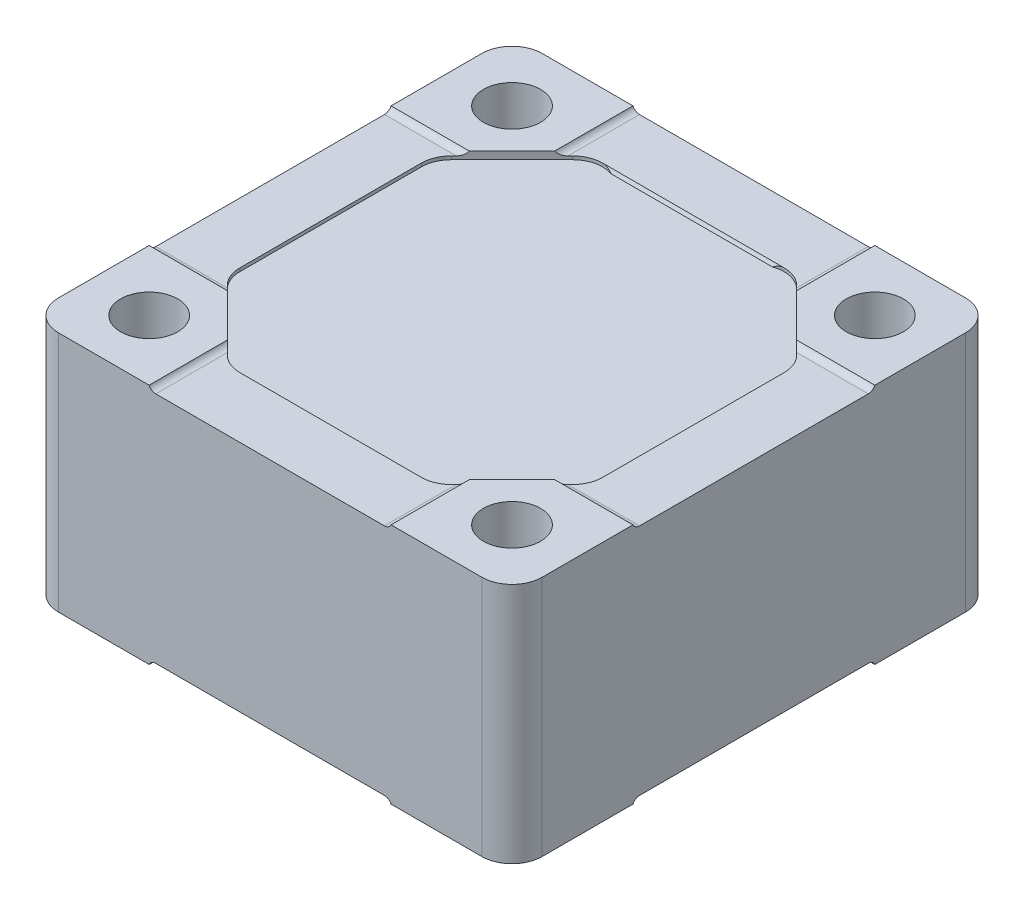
ISO-10303-21;
HEADER;
FILE_DESCRIPTION(('STEP AP214'),'2;1');
FILE_NAME('part.step','',(''),(''),'','','');
FILE_SCHEMA(('AUTOMOTIVE_DESIGN { 1 0 10303 214 1 1 1 1 }'));
ENDSEC;
DATA;
#1=APPLICATION_CONTEXT('core data for automotive mechanical design processes');
#2=APPLICATION_PROTOCOL_DEFINITION('international standard','automotive_design',2000,#1);
#3=PRODUCT_CONTEXT('',#1,'mechanical');
#4=PRODUCT('Part','Part','',(#3));
#5=PRODUCT_RELATED_PRODUCT_CATEGORY('part','',(#4));
#6=PRODUCT_DEFINITION_FORMATION('','',#4);
#7=PRODUCT_DEFINITION_CONTEXT('part definition',#1,'design');
#8=PRODUCT_DEFINITION('design','',#6,#7);
#9=PRODUCT_DEFINITION_SHAPE('','',#8);
#10=(LENGTH_UNIT() NAMED_UNIT(*) SI_UNIT(.MILLI.,.METRE.));
#11=(NAMED_UNIT(*) PLANE_ANGLE_UNIT() SI_UNIT($,.RADIAN.));
#12=(NAMED_UNIT(*) SI_UNIT($,.STERADIAN.) SOLID_ANGLE_UNIT());
#13=UNCERTAINTY_MEASURE_WITH_UNIT(LENGTH_MEASURE(1.E-05),#10,'distance_accuracy_value','');
#14=(GEOMETRIC_REPRESENTATION_CONTEXT(3) GLOBAL_UNCERTAINTY_ASSIGNED_CONTEXT((#13)) GLOBAL_UNIT_ASSIGNED_CONTEXT((#10,
#11,#12)) REPRESENTATION_CONTEXT('',''));
#15=CARTESIAN_POINT('',(0.,0.,0.));
#16=DIRECTION('',(0.,0.,1.));
#17=DIRECTION('',(1.,0.,0.));
#18=AXIS2_PLACEMENT_3D('',#15,#16,#17);
#19=CARTESIAN_POINT('',(-60.6552,19.05,0.));
#20=DIRECTION('',(-1.,0.,0.));
#21=DIRECTION('',(0.,0.,1.));
#22=AXIS2_PLACEMENT_3D('',#19,#20,#21);
#23=PLANE('',#22);
#24=CARTESIAN_POINT('',(-60.6552,19.05,0.));
#25=DIRECTION('',(1.,0.,0.));
#26=DIRECTION('',(0.,0.,-1.));
#27=AXIS2_PLACEMENT_3D('',#24,#25,#26);
#28=CIRCLE('',#27,7.4549);
#29=CARTESIAN_POINT('',(-60.6552,19.05,-7.4549));
#30=VERTEX_POINT('',#29);
#31=EDGE_CURVE('E20',#30,#30,#28,.T.);
#32=ORIENTED_EDGE('',*,*,#31,.F.);
#33=EDGE_LOOP('',(#32));
#34=FACE_BOUND('',#33,.T.);
#35=ADVANCED_FACE('F17',(#34),#23,.T.);
#36=CARTESIAN_POINT('',(-60.6552,19.05,0.));
#37=DIRECTION('',(1.,0.,0.));
#38=DIRECTION('',(0.,0.,-1.));
#39=AXIS2_PLACEMENT_3D('',#36,#37,#38);
#40=CYLINDRICAL_SURFACE('',#39,7.4549);
#41=CARTESIAN_POINT('',(-52.5018,19.05,0.));
#42=DIRECTION('',(1.,0.,0.));
#43=DIRECTION('',(0.,0.,-1.));
#44=AXIS2_PLACEMENT_3D('',#41,#42,#43);
#45=CIRCLE('',#44,7.4549);
#46=CARTESIAN_POINT('',(-52.5018,19.05,-7.4549));
#47=VERTEX_POINT('',#46);
#48=EDGE_CURVE('E760',#47,#47,#45,.T.);
#49=ORIENTED_EDGE('',*,*,#48,.F.);
#50=EDGE_LOOP('',(#49));
#51=FACE_BOUND('',#50,.T.);
#52=ORIENTED_EDGE('',*,*,#31,.T.);
#53=EDGE_LOOP('',(#52));
#54=FACE_BOUND('',#53,.T.);
#55=ADVANCED_FACE('F518',(#51,#54),#40,.T.);
#56=CARTESIAN_POINT('',(0.,49.2125,0.));
#57=DIRECTION('',(0.,-1.,0.));
#58=DIRECTION('',(0.,0.,-1.));
#59=AXIS2_PLACEMENT_3D('',#56,#57,#58);
#60=PLANE('',#59);
#61=DIRECTION('',(-1.,0.,0.));
#62=VECTOR('',#61,1.);
#63=CARTESIAN_POINT('',(-19.05,49.2125,-37.7343966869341));
#64=LINE('',#63,#62);
#65=CARTESIAN_POINT('',(16.9264425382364,49.2125,-37.734396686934));
#66=VERTEX_POINT('',#65);
#67=CARTESIAN_POINT('',(-16.9264425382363,49.2125,-37.7343966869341));
#68=VERTEX_POINT('',#67);
#69=EDGE_CURVE('E484',#66,#68,#64,.T.);
#70=ORIENTED_EDGE('',*,*,#69,.T.);
#71=CARTESIAN_POINT('',(-19.05,49.2125,-31.75));
#72=DIRECTION('',(0.,-1.,0.));
#73=DIRECTION('',(0.,0.,-1.));
#74=AXIS2_PLACEMENT_3D('',#71,#72,#73);
#75=CIRCLE('',#74,6.34999999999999);
#76=CARTESIAN_POINT('',(-23.5401280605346,49.2125,-36.2401280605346));
#77=VERTEX_POINT('',#76);
#78=EDGE_CURVE('E475',#68,#77,#75,.F.);
#79=ORIENTED_EDGE('',*,*,#78,.T.);
#80=DIRECTION('',(0.707106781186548,0.,-0.707106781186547));
#81=VECTOR('',#80,1.);
#82=CARTESIAN_POINT('',(-23.5401280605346,49.2125,-36.2401280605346));
#83=LINE('',#82,#81);
#84=CARTESIAN_POINT('',(-36.2401280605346,49.2125,-23.5401280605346));
#85=VERTEX_POINT('',#84);
#86=EDGE_CURVE('E763',#85,#77,#83,.T.);
#87=ORIENTED_EDGE('',*,*,#86,.F.);
#88=CARTESIAN_POINT('',(-31.75,49.2125,-19.05));
#89=DIRECTION('',(0.,-1.,0.));
#90=DIRECTION('',(0.,0.,-1.));
#91=AXIS2_PLACEMENT_3D('',#88,#89,#90);
#92=CIRCLE('',#91,6.34999999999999);
#93=CARTESIAN_POINT('',(-38.1,49.2125,-19.05));
#94=VERTEX_POINT('',#93);
#95=EDGE_CURVE('E756',#85,#94,#92,.F.);
#96=ORIENTED_EDGE('',*,*,#95,.T.);
#97=DIRECTION('',(0.,0.,1.));
#98=VECTOR('',#97,1.);
#99=CARTESIAN_POINT('',(-38.1,49.2125,-19.05));
#100=LINE('',#99,#98);
#101=CARTESIAN_POINT('',(-38.1000000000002,49.2125,19.0499999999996));
#102=VERTEX_POINT('',#101);
#103=EDGE_CURVE('E1329',#94,#102,#100,.T.);
#104=ORIENTED_EDGE('',*,*,#103,.T.);
#105=CARTESIAN_POINT('',(-31.7500000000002,49.2125,19.0499999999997));
#106=DIRECTION('',(0.,-1.,0.));
#107=DIRECTION('',(0.,0.,-1.));
#108=AXIS2_PLACEMENT_3D('',#105,#106,#107);
#109=CIRCLE('',#108,6.35);
#110=CARTESIAN_POINT('',(-36.2401280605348,49.2125,23.5401280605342));
#111=VERTEX_POINT('',#110);
#112=EDGE_CURVE('E752',#102,#111,#109,.F.);
#113=ORIENTED_EDGE('',*,*,#112,.T.);
#114=DIRECTION('',(-0.70710678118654,0.,-0.707106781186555));
#115=VECTOR('',#114,1.);
#116=CARTESIAN_POINT('',(-36.2401280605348,49.2125,23.5401280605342));
#117=LINE('',#116,#115);
#118=CARTESIAN_POINT('',(-23.540128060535,49.2125,36.2401280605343));
#119=VERTEX_POINT('',#118);
#120=EDGE_CURVE('E1326',#119,#111,#117,.T.);
#121=ORIENTED_EDGE('',*,*,#120,.F.);
#122=CARTESIAN_POINT('',(-19.0500000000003,49.2125,31.7499999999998));
#123=DIRECTION('',(0.,-1.,0.));
#124=DIRECTION('',(0.,0.,-1.));
#125=AXIS2_PLACEMENT_3D('',#122,#123,#124);
#126=CIRCLE('',#125,6.34999999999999);
#127=CARTESIAN_POINT('',(-16.9264425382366,49.2125,37.7343966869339));
#128=VERTEX_POINT('',#127);
#129=EDGE_CURVE('E1353',#119,#128,#126,.F.);
#130=ORIENTED_EDGE('',*,*,#129,.T.);
#131=DIRECTION('',(1.,0.,0.));
#132=VECTOR('',#131,1.);
#133=CARTESIAN_POINT('',(19.05,49.2125,37.7343966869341));
#134=LINE('',#133,#132);
#135=CARTESIAN_POINT('',(16.9264425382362,49.2125,37.7343966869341));
#136=VERTEX_POINT('',#135);
#137=EDGE_CURVE('E776',#128,#136,#134,.T.);
#138=ORIENTED_EDGE('',*,*,#137,.T.);
#139=CARTESIAN_POINT('',(19.05,49.2125,31.75));
#140=DIRECTION('',(0.,-1.,0.));
#141=DIRECTION('',(0.,0.,-1.));
#142=AXIS2_PLACEMENT_3D('',#139,#140,#141);
#143=CIRCLE('',#142,6.35);
#144=CARTESIAN_POINT('',(23.5401280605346,49.2125,36.2401280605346));
#145=VERTEX_POINT('',#144);
#146=EDGE_CURVE('E765',#136,#145,#143,.F.);
#147=ORIENTED_EDGE('',*,*,#146,.T.);
#148=DIRECTION('',(-0.707106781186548,0.,0.707106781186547));
#149=VECTOR('',#148,1.);
#150=CARTESIAN_POINT('',(23.5401280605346,49.2125,36.2401280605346));
#151=LINE('',#150,#149);
#152=CARTESIAN_POINT('',(36.2401280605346,49.2125,23.5401280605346));
#153=VERTEX_POINT('',#152);
#154=EDGE_CURVE('E1344',#153,#145,#151,.T.);
#155=ORIENTED_EDGE('',*,*,#154,.F.);
#156=CARTESIAN_POINT('',(31.75,49.2125,19.05));
#157=DIRECTION('',(0.,-1.,0.));
#158=DIRECTION('',(0.,0.,-1.));
#159=AXIS2_PLACEMENT_3D('',#156,#157,#158);
#160=CIRCLE('',#159,6.34999999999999);
#161=CARTESIAN_POINT('',(38.1,49.2125,19.05));
#162=VERTEX_POINT('',#161);
#163=EDGE_CURVE('E483',#153,#162,#160,.F.);
#164=ORIENTED_EDGE('',*,*,#163,.T.);
#165=DIRECTION('',(0.,0.,-1.));
#166=VECTOR('',#165,1.);
#167=CARTESIAN_POINT('',(38.1000000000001,49.2125,-19.0499999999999));
#168=LINE('',#167,#166);
#169=CARTESIAN_POINT('',(38.1000000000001,49.2125,-19.0499999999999));
#170=VERTEX_POINT('',#169);
#171=EDGE_CURVE('E1359',#162,#170,#168,.T.);
#172=ORIENTED_EDGE('',*,*,#171,.T.);
#173=CARTESIAN_POINT('',(31.7500000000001,49.2125,-19.0499999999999));
#174=DIRECTION('',(0.,-1.,0.));
#175=DIRECTION('',(0.,0.,-1.));
#176=AXIS2_PLACEMENT_3D('',#173,#174,#175);
#177=CIRCLE('',#176,6.35);
#178=CARTESIAN_POINT('',(36.2401280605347,49.2125,-23.5401280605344));
#179=VERTEX_POINT('',#178);
#180=EDGE_CURVE('E1358',#170,#179,#177,.F.);
#181=ORIENTED_EDGE('',*,*,#180,.T.);
#182=DIRECTION('',(0.707106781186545,0.,0.70710678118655));
#183=VECTOR('',#182,1.);
#184=CARTESIAN_POINT('',(36.2401280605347,49.2125,-23.5401280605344));
#185=LINE('',#184,#183);
#186=CARTESIAN_POINT('',(23.5401280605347,49.2125,-36.2401280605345));
#187=VERTEX_POINT('',#186);
#188=EDGE_CURVE('E1354',#187,#179,#185,.T.);
#189=ORIENTED_EDGE('',*,*,#188,.F.);
#190=CARTESIAN_POINT('',(19.0500000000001,49.2125,-31.7499999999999));
#191=DIRECTION('',(0.,-1.,0.));
#192=DIRECTION('',(0.,0.,-1.));
#193=AXIS2_PLACEMENT_3D('',#190,#191,#192);
#194=CIRCLE('',#193,6.34999999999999);
#195=EDGE_CURVE('E470',#187,#66,#194,.F.);
#196=ORIENTED_EDGE('',*,*,#195,.T.);
#197=EDGE_LOOP('',(#70,#79,#87,#96,#104,#113,#121,#130,#138,#147,#155,#164,#172,#181,#189,#196));
#198=FACE_BOUND('',#197,.T.);
#199=ADVANCED_FACE('F487',(#198),#60,.F.);
#200=CARTESIAN_POINT('',(19.0500000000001,50.8,-31.7499999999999));
#201=DIRECTION('',(0.,-1.,0.));
#202=DIRECTION('',(0.,0.,-1.));
#203=AXIS2_PLACEMENT_3D('',#200,#201,#202);
#204=CYLINDRICAL_SURFACE('',#203,6.34999999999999);
#205=CARTESIAN_POINT('',(19.0500000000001,49.911,-31.7499999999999));
#206=DIRECTION('',(0.,-1.,0.));
#207=DIRECTION('',(0.,0.,-1.));
#208=AXIS2_PLACEMENT_3D('',#205,#206,#207);
#209=CIRCLE('',#208,6.34999999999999);
#210=CARTESIAN_POINT('',(23.5401280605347,49.911,-36.2401280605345));
#211=VERTEX_POINT('',#210);
#212=CARTESIAN_POINT('',(19.0500000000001,49.911,-38.0999999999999));
#213=VERTEX_POINT('',#212);
#214=EDGE_CURVE('E747',#211,#213,#209,.F.);
#215=ORIENTED_EDGE('',*,*,#214,.T.);
#216=CARTESIAN_POINT('',(19.0500000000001,49.911,-38.0999999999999));
#217=CARTESIAN_POINT('',(18.9624784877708,49.9110637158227,-38.1000181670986));
#218=CARTESIAN_POINT('',(18.8749967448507,49.9071663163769,-38.0981913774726));
#219=CARTESIAN_POINT('',(18.7009799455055,49.8919471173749,-38.0909929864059));
#220=CARTESIAN_POINT('',(18.6144434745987,49.8806386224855,-38.0856277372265));
#221=CARTESIAN_POINT('',(18.4447060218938,49.8514086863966,-38.0716481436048));
#222=CARTESIAN_POINT('',(18.3614733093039,49.8336342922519,-38.0631059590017));
#223=CARTESIAN_POINT('',(18.1968537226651,49.7921919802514,-38.042973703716));
#224=CARTESIAN_POINT('',(18.115467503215,49.7685220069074,-38.0313825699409));
#225=CARTESIAN_POINT('',(17.9374551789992,49.7104239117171,-38.0025627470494));
#226=CARTESIAN_POINT('',(17.8413387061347,49.6747762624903,-37.9846570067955));
#227=CARTESIAN_POINT('',(17.6523791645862,49.597348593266,-37.9450370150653));
#228=CARTESIAN_POINT('',(17.559538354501,49.5555644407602,-37.9233201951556));
#229=CARTESIAN_POINT('',(17.3745867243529,49.4659018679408,-37.8757547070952));
#230=CARTESIAN_POINT('',(17.282568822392,49.4178857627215,-37.8498075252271));
#231=CARTESIAN_POINT('',(17.10200546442,49.3179024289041,-37.7945579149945));
#232=CARTESIAN_POINT('',(17.0134530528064,49.265943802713,-37.765262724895));
#233=CARTESIAN_POINT('',(16.9264425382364,49.2125,-37.734396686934));
#234=B_SPLINE_CURVE_WITH_KNOTS('',3,(#216,#217,#218,#219,#220,#221,#222,#223,#224,#225,#226,
#227,#228,#229,#230,#231,#232,#233),.UNSPECIFIED.,.F.,.F.,(4,2,2,2,2,2,2,2,4),(0.,
0.262395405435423,0.524321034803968,0.78062849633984,1.03702544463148,1.34885932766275,
1.66090418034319,1.98167002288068,2.30175505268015),.UNSPECIFIED.);
#235=EDGE_CURVE('E490',#213,#66,#234,.T.);
#236=ORIENTED_EDGE('',*,*,#235,.T.);
#237=ORIENTED_EDGE('',*,*,#195,.F.);
#238=DIRECTION('',(0.,1.,0.));
#239=VECTOR('',#238,1.);
#240=CARTESIAN_POINT('',(23.5401280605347,50.8,-36.2401280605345));
#241=LINE('',#240,#239);
#242=EDGE_CURVE('E1363',#211,#187,#241,.F.);
#243=ORIENTED_EDGE('',*,*,#242,.F.);
#244=EDGE_LOOP('',(#215,#236,#237,#243));
#245=FACE_BOUND('',#244,.T.);
#246=ADVANCED_FACE('F511',(#245),#204,.F.);
#247=CARTESIAN_POINT('',(-19.05,53.975,-29.4855047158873));
#248=DIRECTION('',(-1.,0.,0.));
#249=DIRECTION('',(0.,0.,1.));
#250=AXIS2_PLACEMENT_3D('',#247,#248,#249);
#251=CYLINDRICAL_SURFACE('',#250,9.525);
#252=ORIENTED_EDGE('',*,*,#235,.F.);
#253=DIRECTION('',(1.,0.,0.));
#254=VECTOR('',#253,1.);
#255=CARTESIAN_POINT('',(0.,49.911,-38.0999999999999));
#256=LINE('',#255,#254);
#257=CARTESIAN_POINT('',(-19.05,49.911,-38.1));
#258=VERTEX_POINT('',#257);
#259=EDGE_CURVE('E494',#213,#258,#256,.F.);
#260=ORIENTED_EDGE('',*,*,#259,.T.);
#261=CARTESIAN_POINT('',(-16.9264425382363,49.2125,-37.7343966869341));
#262=CARTESIAN_POINT('',(-17.013317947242,49.2658609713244,-37.7652148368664));
#263=CARTESIAN_POINT('',(-17.1017303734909,49.3177411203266,-37.7944669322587));
#264=CARTESIAN_POINT('',(-17.2820015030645,49.4175806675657,-37.8496407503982));
#265=CARTESIAN_POINT('',(-17.3738670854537,49.465531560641,-37.8755553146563));
#266=CARTESIAN_POINT('',(-17.5585123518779,49.5550876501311,-37.9230701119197));
#267=CARTESIAN_POINT('',(-17.6511996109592,49.5968297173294,-37.9447683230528));
#268=CARTESIAN_POINT('',(-17.8398428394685,49.6741983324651,-37.9843644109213));
#269=CARTESIAN_POINT('',(-17.9357965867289,49.7098289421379,-38.0022648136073));
#270=CARTESIAN_POINT('',(-18.1137756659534,49.7680131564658,-38.0311324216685));
#271=CARTESIAN_POINT('',(-18.1952996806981,49.7917640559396,-38.0427647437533));
#272=CARTESIAN_POINT('',(-18.3602036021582,49.8333507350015,-38.0629692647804));
#273=CARTESIAN_POINT('',(-18.4435828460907,49.8511885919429,-38.0715425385));
#274=CARTESIAN_POINT('',(-18.613626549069,49.8805247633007,-38.0855736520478));
#275=CARTESIAN_POINT('',(-18.7003229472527,49.8918753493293,-38.0909589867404));
#276=CARTESIAN_POINT('',(-18.8746652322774,49.9071517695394,-38.0981845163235));
#277=CARTESIAN_POINT('',(-18.9623125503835,49.9110641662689,-38.1000182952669));
#278=CARTESIAN_POINT('',(-19.05,49.911,-38.1));
#279=B_SPLINE_CURVE_WITH_KNOTS('',3,(#261,#262,#263,#264,#265,#266,#267,#268,#269,#270,#271,
#272,#273,#274,#275,#276,#277,#278),.UNSPECIFIED.,.F.,.F.,(4,2,2,2,2,2,2,2,4),(0.,
0.319587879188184,0.639850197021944,0.951423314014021,1.26278854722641,1.51966159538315,
1.77644430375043,2.03886271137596,2.30175474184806),.UNSPECIFIED.);
#280=EDGE_CURVE('E478',#68,#258,#279,.T.);
#281=ORIENTED_EDGE('',*,*,#280,.F.);
#282=ORIENTED_EDGE('',*,*,#69,.F.);
#283=EDGE_LOOP('',(#252,#260,#281,#282));
#284=FACE_BOUND('',#283,.T.);
#285=ADVANCED_FACE('F492',(#284),#251,.F.);
#286=CARTESIAN_POINT('',(-19.05,50.8,-31.75));
#287=DIRECTION('',(0.,-1.,0.));
#288=DIRECTION('',(0.,0.,-1.));
#289=AXIS2_PLACEMENT_3D('',#286,#287,#288);
#290=CYLINDRICAL_SURFACE('',#289,6.34999999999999);
#291=CARTESIAN_POINT('',(-19.05,49.911,-31.75));
#292=DIRECTION('',(0.,-1.,0.));
#293=DIRECTION('',(0.,0.,-1.));
#294=AXIS2_PLACEMENT_3D('',#291,#292,#293);
#295=CIRCLE('',#294,6.34999999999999);
#296=CARTESIAN_POINT('',(-23.5401280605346,49.911,-36.2401280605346));
#297=VERTEX_POINT('',#296);
#298=EDGE_CURVE('E744',#258,#297,#295,.F.);
#299=ORIENTED_EDGE('',*,*,#298,.T.);
#300=DIRECTION('',(0.,1.,0.));
#301=VECTOR('',#300,1.);
#302=CARTESIAN_POINT('',(-23.5401280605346,50.8,-36.2401280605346));
#303=LINE('',#302,#301);
#304=EDGE_CURVE('E481',#77,#297,#303,.T.);
#305=ORIENTED_EDGE('',*,*,#304,.F.);
#306=ORIENTED_EDGE('',*,*,#78,.F.);
#307=ORIENTED_EDGE('',*,*,#280,.T.);
#308=EDGE_LOOP('',(#299,#305,#306,#307));
#309=FACE_BOUND('',#308,.T.);
#310=ADVANCED_FACE('F476',(#309),#290,.F.);
#311=CARTESIAN_POINT('',(31.75,50.8,19.05));
#312=DIRECTION('',(0.,-1.,0.));
#313=DIRECTION('',(0.,0.,-1.));
#314=AXIS2_PLACEMENT_3D('',#311,#312,#313);
#315=CYLINDRICAL_SURFACE('',#314,6.34999999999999);
#316=ORIENTED_EDGE('',*,*,#163,.F.);
#317=DIRECTION('',(0.,1.,0.));
#318=VECTOR('',#317,1.);
#319=CARTESIAN_POINT('',(36.2401280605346,50.8,23.5401280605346));
#320=LINE('',#319,#318);
#321=CARTESIAN_POINT('',(36.2401280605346,49.911,23.5401280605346));
#322=VERTEX_POINT('',#321);
#323=EDGE_CURVE('E767',#322,#153,#320,.F.);
#324=ORIENTED_EDGE('',*,*,#323,.F.);
#325=CARTESIAN_POINT('',(31.75,49.911,19.05));
#326=DIRECTION('',(0.,-1.,0.));
#327=DIRECTION('',(0.,0.,-1.));
#328=AXIS2_PLACEMENT_3D('',#325,#326,#327);
#329=CIRCLE('',#328,6.34999999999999);
#330=CARTESIAN_POINT('',(38.1,49.911,19.05));
#331=VERTEX_POINT('',#330);
#332=EDGE_CURVE('E737',#322,#331,#329,.F.);
#333=ORIENTED_EDGE('',*,*,#332,.T.);
#334=DIRECTION('',(0.,1.,0.));
#335=VECTOR('',#334,1.);
#336=CARTESIAN_POINT('',(38.1,44.45,19.05));
#337=LINE('',#336,#335);
#338=EDGE_CURVE('E1360',#331,#162,#337,.F.);
#339=ORIENTED_EDGE('',*,*,#338,.T.);
#340=EDGE_LOOP('',(#316,#324,#333,#339));
#341=FACE_BOUND('',#340,.T.);
#342=ADVANCED_FACE('F1919',(#341),#315,.F.);
#343=CARTESIAN_POINT('',(38.1000000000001,44.45,-19.0499999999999));
#344=DIRECTION('',(1.,0.,0.));
#345=DIRECTION('',(0.,0.,-1.));
#346=AXIS2_PLACEMENT_3D('',#343,#344,#345);
#347=PLANE('',#346);
#348=ORIENTED_EDGE('',*,*,#338,.F.);
#349=DIRECTION('',(0.,0.,-1.));
#350=VECTOR('',#349,1.);
#351=CARTESIAN_POINT('',(38.1,49.911,0.));
#352=LINE('',#351,#350);
#353=CARTESIAN_POINT('',(38.1,49.911,-19.0499999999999));
#354=VERTEX_POINT('',#353);
#355=EDGE_CURVE('E736',#331,#354,#352,.T.);
#356=ORIENTED_EDGE('',*,*,#355,.T.);
#357=DIRECTION('',(0.,-1.,0.));
#358=VECTOR('',#357,1.);
#359=CARTESIAN_POINT('',(38.1000000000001,50.8,-19.0499999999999));
#360=LINE('',#359,#358);
#361=EDGE_CURVE('E1355',#354,#170,#360,.T.);
#362=ORIENTED_EDGE('',*,*,#361,.T.);
#363=ORIENTED_EDGE('',*,*,#171,.F.);
#364=EDGE_LOOP('',(#348,#356,#362,#363));
#365=FACE_BOUND('',#364,.T.);
#366=ADVANCED_FACE('F1910',(#365),#347,.F.);
#367=CARTESIAN_POINT('',(31.7500000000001,50.8,-19.0499999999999));
#368=DIRECTION('',(0.,-1.,0.));
#369=DIRECTION('',(0.,0.,-1.));
#370=AXIS2_PLACEMENT_3D('',#367,#368,#369);
#371=CYLINDRICAL_SURFACE('',#370,6.35);
#372=ORIENTED_EDGE('',*,*,#180,.F.);
#373=ORIENTED_EDGE('',*,*,#361,.F.);
#374=CARTESIAN_POINT('',(31.7500000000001,49.911,-19.0499999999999));
#375=DIRECTION('',(0.,-1.,0.));
#376=DIRECTION('',(0.,0.,-1.));
#377=AXIS2_PLACEMENT_3D('',#374,#375,#376);
#378=CIRCLE('',#377,6.35);
#379=CARTESIAN_POINT('',(36.2401280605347,49.911,-23.5401280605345));
#380=VERTEX_POINT('',#379);
#381=EDGE_CURVE('E733',#354,#380,#378,.F.);
#382=ORIENTED_EDGE('',*,*,#381,.T.);
#383=DIRECTION('',(0.,1.,0.));
#384=VECTOR('',#383,1.);
#385=CARTESIAN_POINT('',(36.2401280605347,50.8,-23.5401280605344));
#386=LINE('',#385,#384);
#387=EDGE_CURVE('E1350',#179,#380,#386,.T.);
#388=ORIENTED_EDGE('',*,*,#387,.F.);
#389=EDGE_LOOP('',(#372,#373,#382,#388));
#390=FACE_BOUND('',#389,.T.);
#391=ADVANCED_FACE('F1901',(#390),#371,.F.);
#392=CARTESIAN_POINT('',(36.2401280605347,50.8,-23.5401280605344));
#393=DIRECTION('',(-0.70710678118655,0.,0.707106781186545));
#394=DIRECTION('',(0.707106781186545,0.,0.70710678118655));
#395=AXIS2_PLACEMENT_3D('',#392,#393,#394);
#396=PLANE('',#395);
#397=CARTESIAN_POINT('',(24.0145935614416,51.435,-35.7656625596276));
#398=DIRECTION('',(-0.70710678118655,0.,0.707106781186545));
#399=DIRECTION('',(0.707106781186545,0.,0.70710678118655));
#400=AXIS2_PLACEMENT_3D('',#397,#398,#399);
#401=ELLIPSE('',#400,2.15526146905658,1.524);
#402=CARTESIAN_POINT('',(25.4000000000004,50.8,-34.3802561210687));
#403=VERTEX_POINT('',#402);
#404=CARTESIAN_POINT('',(24.0145935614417,49.911,-35.7656625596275));
#405=VERTEX_POINT('',#404);
#406=EDGE_CURVE('E749',#403,#405,#401,.F.);
#407=ORIENTED_EDGE('',*,*,#406,.T.);
#408=DIRECTION('',(-0.707106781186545,0.,-0.70710678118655));
#409=VECTOR('',#408,1.);
#410=CARTESIAN_POINT('',(24.0145935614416,49.911,-35.7656625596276));
#411=LINE('',#410,#409);
#412=EDGE_CURVE('E1312',#405,#211,#411,.T.);
#413=ORIENTED_EDGE('',*,*,#412,.T.);
#414=ORIENTED_EDGE('',*,*,#242,.T.);
#415=ORIENTED_EDGE('',*,*,#188,.T.);
#416=ORIENTED_EDGE('',*,*,#387,.T.);
#417=DIRECTION('',(-0.707106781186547,0.,-0.707106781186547));
#418=VECTOR('',#417,1.);
#419=CARTESIAN_POINT('',(36.2401280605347,49.911,-23.5401280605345));
#420=LINE('',#419,#418);
#421=CARTESIAN_POINT('',(35.7656625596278,49.911,-24.0145935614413));
#422=VERTEX_POINT('',#421);
#423=EDGE_CURVE('E735',#380,#422,#420,.T.);
#424=ORIENTED_EDGE('',*,*,#423,.T.);
#425=CARTESIAN_POINT('',(35.7656625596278,51.435,-24.0145935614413));
#426=DIRECTION('',(-0.70710678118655,0.,0.707106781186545));
#427=DIRECTION('',(0.707106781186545,0.,0.70710678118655));
#428=AXIS2_PLACEMENT_3D('',#425,#426,#427);
#429=ELLIPSE('',#428,2.15526146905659,1.524);
#430=CARTESIAN_POINT('',(34.3802561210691,50.8,-25.4));
#431=VERTEX_POINT('',#430);
#432=EDGE_CURVE('E729',#422,#431,#429,.F.);
#433=ORIENTED_EDGE('',*,*,#432,.T.);
#434=DIRECTION('',(0.707106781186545,0.,0.70710678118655));
#435=VECTOR('',#434,1.);
#436=CARTESIAN_POINT('',(25.4000000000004,50.8,-34.3802561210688));
#437=LINE('',#436,#435);
#438=EDGE_CURVE('E1295',#403,#431,#437,.T.);
#439=ORIENTED_EDGE('',*,*,#438,.F.);
#440=EDGE_LOOP('',(#407,#413,#414,#415,#416,#424,#433,#439));
#441=FACE_BOUND('',#440,.T.);
#442=ADVANCED_FACE('F1893',(#441),#396,.T.);
#443=CARTESIAN_POINT('',(-19.0500000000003,50.8,31.7499999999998));
#444=DIRECTION('',(0.,-1.,0.));
#445=DIRECTION('',(0.,0.,-1.));
#446=AXIS2_PLACEMENT_3D('',#443,#444,#445);
#447=CYLINDRICAL_SURFACE('',#446,6.34999999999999);
#448=ORIENTED_EDGE('',*,*,#129,.F.);
#449=DIRECTION('',(0.,1.,0.));
#450=VECTOR('',#449,1.);
#451=CARTESIAN_POINT('',(-23.540128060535,50.8,36.2401280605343));
#452=LINE('',#451,#450);
#453=CARTESIAN_POINT('',(-23.5401280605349,49.911,36.2401280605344));
#454=VERTEX_POINT('',#453);
#455=EDGE_CURVE('E754',#454,#119,#452,.F.);
#456=ORIENTED_EDGE('',*,*,#455,.F.);
#457=CARTESIAN_POINT('',(-19.0500000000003,49.911,31.7499999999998));
#458=DIRECTION('',(0.,-1.,0.));
#459=DIRECTION('',(0.,0.,-1.));
#460=AXIS2_PLACEMENT_3D('',#457,#458,#459);
#461=CIRCLE('',#460,6.34999999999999);
#462=CARTESIAN_POINT('',(-19.0500000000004,49.911,38.0999999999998));
#463=VERTEX_POINT('',#462);
#464=EDGE_CURVE('E724',#454,#463,#461,.F.);
#465=ORIENTED_EDGE('',*,*,#464,.T.);
#466=CARTESIAN_POINT('',(-19.0500000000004,49.911,38.0999999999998));
#467=CARTESIAN_POINT('',(-18.962478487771,49.9110637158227,38.1000181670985));
#468=CARTESIAN_POINT('',(-18.8749967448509,49.9071663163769,38.0981913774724));
#469=CARTESIAN_POINT('',(-18.7009799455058,49.891947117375,38.0909929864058));
#470=CARTESIAN_POINT('',(-18.6144434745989,49.8806386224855,38.0856277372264));
#471=CARTESIAN_POINT('',(-18.444706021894,49.8514086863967,38.0716481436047));
#472=CARTESIAN_POINT('',(-18.3614733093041,49.8336342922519,38.0631059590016));
#473=CARTESIAN_POINT('',(-18.1968537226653,49.7921919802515,38.0429737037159));
#474=CARTESIAN_POINT('',(-18.1154675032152,49.7685220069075,38.0313825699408));
#475=CARTESIAN_POINT('',(-17.9374551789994,49.7104239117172,38.0025627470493));
#476=CARTESIAN_POINT('',(-17.841338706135,49.6747762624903,37.9846570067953));
#477=CARTESIAN_POINT('',(-17.6523791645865,49.597348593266,37.9450370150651));
#478=CARTESIAN_POINT('',(-17.5595383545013,49.5555644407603,37.9233201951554));
#479=CARTESIAN_POINT('',(-17.3745867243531,49.4659018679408,37.875754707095));
#480=CARTESIAN_POINT('',(-17.2825688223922,49.4178857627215,37.849807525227));
#481=CARTESIAN_POINT('',(-17.1020054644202,49.3179024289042,37.7945579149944));
#482=CARTESIAN_POINT('',(-17.0134530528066,49.265943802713,37.7652627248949));
#483=CARTESIAN_POINT('',(-16.9264425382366,49.2125,37.7343966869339));
#484=B_SPLINE_CURVE_WITH_KNOTS('',3,(#466,#467,#468,#469,#470,#471,#472,#473,#474,#475,#476,
#477,#478,#479,#480,#481,#482,#483),.UNSPECIFIED.,.F.,.F.,(4,2,2,2,2,2,2,2,4),(0.,
0.262395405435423,0.524321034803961,0.780628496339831,1.03702544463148,1.34885932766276,
1.66090418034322,1.98167002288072,2.30175505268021),.UNSPECIFIED.);
#485=EDGE_CURVE('E777',#463,#128,#484,.T.);
#486=ORIENTED_EDGE('',*,*,#485,.T.);
#487=EDGE_LOOP('',(#448,#456,#465,#486));
#488=FACE_BOUND('',#487,.T.);
#489=ADVANCED_FACE('F1885',(#488),#447,.F.);
#490=CARTESIAN_POINT('',(19.05,53.975,29.4855047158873));
#491=DIRECTION('',(1.,0.,0.));
#492=DIRECTION('',(0.,0.,-1.));
#493=AXIS2_PLACEMENT_3D('',#490,#491,#492);
#494=CYLINDRICAL_SURFACE('',#493,9.525);
#495=ORIENTED_EDGE('',*,*,#485,.F.);
#496=DIRECTION('',(1.,0.,0.));
#497=VECTOR('',#496,1.);
#498=CARTESIAN_POINT('',(0.,49.911,38.0999999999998));
#499=LINE('',#498,#497);
#500=CARTESIAN_POINT('',(19.05,49.911,38.0999999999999));
#501=VERTEX_POINT('',#500);
#502=EDGE_CURVE('E723',#463,#501,#499,.T.);
#503=ORIENTED_EDGE('',*,*,#502,.T.);
#504=CARTESIAN_POINT('',(19.05,49.911,38.1));
#505=CARTESIAN_POINT('',(18.9624784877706,49.9110637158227,38.1000181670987));
#506=CARTESIAN_POINT('',(18.8749967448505,49.9071663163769,38.0981913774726));
#507=CARTESIAN_POINT('',(18.7009799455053,49.891947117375,38.090992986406));
#508=CARTESIAN_POINT('',(18.6144434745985,49.8806386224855,38.0856277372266));
#509=CARTESIAN_POINT('',(18.4447060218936,49.8514086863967,38.0716481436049));
#510=CARTESIAN_POINT('',(18.3614733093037,49.8336342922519,38.0631059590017));
#511=CARTESIAN_POINT('',(18.1968537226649,49.7921919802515,38.042973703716));
#512=CARTESIAN_POINT('',(18.1154675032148,49.7685220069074,38.0313825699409));
#513=CARTESIAN_POINT('',(17.937455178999,49.7104239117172,38.0025627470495));
#514=CARTESIAN_POINT('',(17.8413387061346,49.6747762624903,37.9846570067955));
#515=CARTESIAN_POINT('',(17.6523791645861,49.5973485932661,37.9450370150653));
#516=CARTESIAN_POINT('',(17.5595383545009,49.5555644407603,37.9233201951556));
#517=CARTESIAN_POINT('',(17.3745867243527,49.4659018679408,37.8757547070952));
#518=CARTESIAN_POINT('',(17.2825688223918,49.4178857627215,37.8498075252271));
#519=CARTESIAN_POINT('',(17.1020054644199,49.3179024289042,37.7945579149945));
#520=CARTESIAN_POINT('',(17.0134530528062,49.265943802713,37.7652627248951));
#521=CARTESIAN_POINT('',(16.9264425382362,49.2125,37.7343966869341));
#522=B_SPLINE_CURVE_WITH_KNOTS('',3,(#504,#505,#506,#507,#508,#509,#510,#511,#512,#513,#514,
#515,#516,#517,#518,#519,#520,#521),.UNSPECIFIED.,.F.,.F.,(4,2,2,2,2,2,2,2,4),(0.,
0.262395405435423,0.524321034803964,0.780628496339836,1.03702544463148,1.34885932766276,
1.66090418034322,1.98167002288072,2.30175505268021),.UNSPECIFIED.);
#523=EDGE_CURVE('E768',#501,#136,#522,.T.);
#524=ORIENTED_EDGE('',*,*,#523,.T.);
#525=ORIENTED_EDGE('',*,*,#137,.F.);
#526=EDGE_LOOP('',(#495,#503,#524,#525));
#527=FACE_BOUND('',#526,.T.);
#528=ADVANCED_FACE('F783',(#527),#494,.F.);
#529=CARTESIAN_POINT('',(19.05,50.8,31.75));
#530=DIRECTION('',(0.,-1.,0.));
#531=DIRECTION('',(0.,0.,-1.));
#532=AXIS2_PLACEMENT_3D('',#529,#530,#531);
#533=CYLINDRICAL_SURFACE('',#532,6.35);
#534=ORIENTED_EDGE('',*,*,#146,.F.);
#535=ORIENTED_EDGE('',*,*,#523,.F.);
#536=CARTESIAN_POINT('',(19.05,49.911,31.75));
#537=DIRECTION('',(0.,-1.,0.));
#538=DIRECTION('',(0.,0.,-1.));
#539=AXIS2_PLACEMENT_3D('',#536,#537,#538);
#540=CIRCLE('',#539,6.35);
#541=CARTESIAN_POINT('',(23.5401280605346,49.911,36.2401280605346));
#542=VERTEX_POINT('',#541);
#543=EDGE_CURVE('E720',#501,#542,#540,.F.);
#544=ORIENTED_EDGE('',*,*,#543,.T.);
#545=DIRECTION('',(0.,1.,0.));
#546=VECTOR('',#545,1.);
#547=CARTESIAN_POINT('',(23.5401280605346,50.8,36.2401280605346));
#548=LINE('',#547,#546);
#549=EDGE_CURVE('E764',#145,#542,#548,.T.);
#550=ORIENTED_EDGE('',*,*,#549,.F.);
#551=EDGE_LOOP('',(#534,#535,#544,#550));
#552=FACE_BOUND('',#551,.T.);
#553=ADVANCED_FACE('F785',(#552),#533,.F.);
#554=CARTESIAN_POINT('',(23.5401280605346,50.8,36.2401280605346));
#555=DIRECTION('',(-0.707106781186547,0.,-0.707106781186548));
#556=DIRECTION('',(-0.707106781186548,0.,0.707106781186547));
#557=AXIS2_PLACEMENT_3D('',#554,#555,#556);
#558=PLANE('',#557);
#559=CARTESIAN_POINT('',(35.7656625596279,51.435,24.0145935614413));
#560=DIRECTION('',(-0.707106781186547,0.,-0.707106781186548));
#561=DIRECTION('',(-0.707106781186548,0.,0.707106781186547));
#562=AXIS2_PLACEMENT_3D('',#559,#560,#561);
#563=ELLIPSE('',#562,2.1552614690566,1.524);
#564=CARTESIAN_POINT('',(34.3802561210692,50.8,25.4));
#565=VERTEX_POINT('',#564);
#566=CARTESIAN_POINT('',(35.7656625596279,49.911,24.0145935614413));
#567=VERTEX_POINT('',#566);
#568=EDGE_CURVE('E739',#565,#567,#563,.F.);
#569=ORIENTED_EDGE('',*,*,#568,.T.);
#570=DIRECTION('',(0.707106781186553,0.,-0.707106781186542));
#571=VECTOR('',#570,1.);
#572=CARTESIAN_POINT('',(35.7656625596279,49.911,24.0145935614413));
#573=LINE('',#572,#571);
#574=EDGE_CURVE('E1298',#567,#322,#573,.T.);
#575=ORIENTED_EDGE('',*,*,#574,.T.);
#576=ORIENTED_EDGE('',*,*,#323,.T.);
#577=ORIENTED_EDGE('',*,*,#154,.T.);
#578=ORIENTED_EDGE('',*,*,#549,.T.);
#579=DIRECTION('',(0.707106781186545,0.,-0.70710678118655));
#580=VECTOR('',#579,1.);
#581=CARTESIAN_POINT('',(23.5401280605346,49.911,36.2401280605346));
#582=LINE('',#581,#580);
#583=CARTESIAN_POINT('',(24.0145935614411,49.911,35.765662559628));
#584=VERTEX_POINT('',#583);
#585=EDGE_CURVE('E722',#542,#584,#582,.T.);
#586=ORIENTED_EDGE('',*,*,#585,.T.);
#587=CARTESIAN_POINT('',(24.0145935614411,51.435,35.765662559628));
#588=DIRECTION('',(-0.707106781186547,0.,-0.707106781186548));
#589=DIRECTION('',(-0.707106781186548,0.,0.707106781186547));
#590=AXIS2_PLACEMENT_3D('',#587,#588,#589);
#591=ELLIPSE('',#590,2.1552614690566,1.524);
#592=CARTESIAN_POINT('',(25.3999999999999,50.8,34.3802561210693));
#593=VERTEX_POINT('',#592);
#594=EDGE_CURVE('E716',#584,#593,#591,.F.);
#595=ORIENTED_EDGE('',*,*,#594,.T.);
#596=DIRECTION('',(-0.707106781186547,0.,0.707106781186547));
#597=VECTOR('',#596,1.);
#598=CARTESIAN_POINT('',(34.3802561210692,50.8,25.4));
#599=LINE('',#598,#597);
#600=EDGE_CURVE('E1277',#565,#593,#599,.T.);
#601=ORIENTED_EDGE('',*,*,#600,.F.);
#602=EDGE_LOOP('',(#569,#575,#576,#577,#578,#586,#595,#601));
#603=FACE_BOUND('',#602,.T.);
#604=ADVANCED_FACE('F789',(#603),#558,.T.);
#605=CARTESIAN_POINT('',(-52.5018,0.,0.));
#606=DIRECTION('',(-1.,0.,0.));
#607=DIRECTION('',(0.,0.,1.));
#608=AXIS2_PLACEMENT_3D('',#605,#606,#607);
#609=PLANE('',#608);
#610=ORIENTED_EDGE('',*,*,#48,.T.);
#611=EDGE_LOOP('',(#610));
#612=FACE_BOUND('',#611,.T.);
#613=DIRECTION('',(0.,-1.,0.));
#614=VECTOR('',#613,1.);
#615=CARTESIAN_POINT('',(-52.5018,29.464,11.938));
#616=LINE('',#615,#614);
#617=CARTESIAN_POINT('',(-52.5018,29.464,11.938));
#618=VERTEX_POINT('',#617);
#619=CARTESIAN_POINT('',(-52.5018,8.63599999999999,11.938));
#620=VERTEX_POINT('',#619);
#621=EDGE_CURVE('E1253',#618,#620,#616,.T.);
#622=ORIENTED_EDGE('',*,*,#621,.F.);
#623=DIRECTION('',(0.,-0.707106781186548,0.707106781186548));
#624=VECTOR('',#623,1.);
#625=CARTESIAN_POINT('',(-52.5018,29.464,11.938));
#626=LINE('',#625,#624);
#627=CARTESIAN_POINT('',(-52.5018,30.988,10.414));
#628=VERTEX_POINT('',#627);
#629=EDGE_CURVE('E1247',#628,#618,#626,.T.);
#630=ORIENTED_EDGE('',*,*,#629,.F.);
#631=DIRECTION('',(0.,0.,1.));
#632=VECTOR('',#631,1.);
#633=CARTESIAN_POINT('',(-52.5018,30.988,10.414));
#634=LINE('',#633,#632);
#635=CARTESIAN_POINT('',(-52.5018,30.988,-10.414));
#636=VERTEX_POINT('',#635);
#637=EDGE_CURVE('E1241',#636,#628,#634,.T.);
#638=ORIENTED_EDGE('',*,*,#637,.F.);
#639=DIRECTION('',(0.,0.707106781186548,0.707106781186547));
#640=VECTOR('',#639,1.);
#641=CARTESIAN_POINT('',(-52.5018,30.988,-10.414));
#642=LINE('',#641,#640);
#643=CARTESIAN_POINT('',(-52.5018,29.464,-11.938));
#644=VERTEX_POINT('',#643);
#645=EDGE_CURVE('E1232',#644,#636,#642,.T.);
#646=ORIENTED_EDGE('',*,*,#645,.F.);
#647=DIRECTION('',(0.,1.,0.));
#648=VECTOR('',#647,1.);
#649=CARTESIAN_POINT('',(-52.5018,29.464,-11.938));
#650=LINE('',#649,#648);
#651=CARTESIAN_POINT('',(-52.5018,8.63599999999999,-11.938));
#652=VERTEX_POINT('',#651);
#653=EDGE_CURVE('E1274',#652,#644,#650,.T.);
#654=ORIENTED_EDGE('',*,*,#653,.F.);
#655=DIRECTION('',(0.,0.707106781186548,-0.707106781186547));
#656=VECTOR('',#655,1.);
#657=CARTESIAN_POINT('',(-52.5018,7.11199999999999,-10.414));
#658=LINE('',#657,#656);
#659=CARTESIAN_POINT('',(-52.5018,7.11199999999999,-10.414));
#660=VERTEX_POINT('',#659);
#661=EDGE_CURVE('E1271',#660,#652,#658,.T.);
#662=ORIENTED_EDGE('',*,*,#661,.F.);
#663=DIRECTION('',(0.,0.,-1.));
#664=VECTOR('',#663,1.);
#665=CARTESIAN_POINT('',(-52.5018,7.11199999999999,10.414));
#666=LINE('',#665,#664);
#667=CARTESIAN_POINT('',(-52.5018,7.11199999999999,10.414));
#668=VERTEX_POINT('',#667);
#669=EDGE_CURVE('E1265',#668,#660,#666,.T.);
#670=ORIENTED_EDGE('',*,*,#669,.F.);
#671=DIRECTION('',(0.,-0.707106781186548,-0.707106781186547));
#672=VECTOR('',#671,1.);
#673=CARTESIAN_POINT('',(-52.5018,8.63599999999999,11.938));
#674=LINE('',#673,#672);
#675=EDGE_CURVE('E1259',#620,#668,#674,.T.);
#676=ORIENTED_EDGE('',*,*,#675,.F.);
#677=EDGE_LOOP('',(#622,#630,#638,#646,#654,#662,#670,#676));
#678=FACE_BOUND('',#677,.T.);
#679=ADVANCED_FACE('F793',(#612,#678),#609,.T.);
#680=CARTESIAN_POINT('',(-23.5401280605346,50.8,-36.2401280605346));
#681=DIRECTION('',(0.707106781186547,0.,0.707106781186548));
#682=DIRECTION('',(0.707106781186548,0.,-0.707106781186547));
#683=AXIS2_PLACEMENT_3D('',#680,#681,#682);
#684=PLANE('',#683);
#685=CARTESIAN_POINT('',(-35.7656625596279,51.435,-24.0145935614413));
#686=DIRECTION('',(0.707106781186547,0.,0.707106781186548));
#687=DIRECTION('',(0.707106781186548,0.,-0.707106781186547));
#688=AXIS2_PLACEMENT_3D('',#685,#686,#687);
#689=ELLIPSE('',#688,2.1552614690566,1.524);
#690=CARTESIAN_POINT('',(-34.3802561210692,50.8,-25.4));
#691=VERTEX_POINT('',#690);
#692=CARTESIAN_POINT('',(-35.7656625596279,49.911,-24.0145935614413));
#693=VERTEX_POINT('',#692);
#694=EDGE_CURVE('E712',#691,#693,#689,.F.);
#695=ORIENTED_EDGE('',*,*,#694,.T.);
#696=DIRECTION('',(0.707106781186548,0.,-0.707106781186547));
#697=VECTOR('',#696,1.);
#698=CARTESIAN_POINT('',(-23.5401280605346,49.911,-36.2401280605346));
#699=LINE('',#698,#697);
#700=CARTESIAN_POINT('',(-36.2401280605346,49.911,-23.5401280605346));
#701=VERTEX_POINT('',#700);
#702=EDGE_CURVE('E1334',#693,#701,#699,.F.);
#703=ORIENTED_EDGE('',*,*,#702,.T.);
#704=DIRECTION('',(0.,-1.,0.));
#705=VECTOR('',#704,1.);
#706=CARTESIAN_POINT('',(-36.2401280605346,50.8,-23.5401280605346));
#707=LINE('',#706,#705);
#708=EDGE_CURVE('E759',#701,#85,#707,.T.);
#709=ORIENTED_EDGE('',*,*,#708,.T.);
#710=ORIENTED_EDGE('',*,*,#86,.T.);
#711=ORIENTED_EDGE('',*,*,#304,.T.);
#712=DIRECTION('',(-0.707106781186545,0.,0.70710678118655));
#713=VECTOR('',#712,1.);
#714=CARTESIAN_POINT('',(-23.5401280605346,49.911,-36.2401280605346));
#715=LINE('',#714,#713);
#716=CARTESIAN_POINT('',(-24.0145935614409,49.911,-35.7656625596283));
#717=VERTEX_POINT('',#716);
#718=EDGE_CURVE('E746',#297,#717,#715,.T.);
#719=ORIENTED_EDGE('',*,*,#718,.T.);
#720=CARTESIAN_POINT('',(-24.0145935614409,51.435,-35.7656625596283));
#721=DIRECTION('',(0.707106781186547,0.,0.707106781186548));
#722=DIRECTION('',(0.707106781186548,0.,-0.707106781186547));
#723=AXIS2_PLACEMENT_3D('',#720,#721,#722);
#724=ELLIPSE('',#723,2.15526146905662,1.524);
#725=CARTESIAN_POINT('',(-25.3999999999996,50.8,-34.3802561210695));
#726=VERTEX_POINT('',#725);
#727=EDGE_CURVE('E741',#717,#726,#724,.F.);
#728=ORIENTED_EDGE('',*,*,#727,.T.);
#729=DIRECTION('',(0.707106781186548,0.,-0.707106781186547));
#730=VECTOR('',#729,1.);
#731=CARTESIAN_POINT('',(-34.3802561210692,50.8,-25.4));
#732=LINE('',#731,#730);
#733=EDGE_CURVE('E1227',#691,#726,#732,.T.);
#734=ORIENTED_EDGE('',*,*,#733,.F.);
#735=EDGE_LOOP('',(#695,#703,#709,#710,#711,#719,#728,#734));
#736=FACE_BOUND('',#735,.T.);
#737=ADVANCED_FACE('F797',(#736),#684,.T.);
#738=CARTESIAN_POINT('',(-31.75,50.8,-19.05));
#739=DIRECTION('',(0.,-1.,0.));
#740=DIRECTION('',(0.,0.,-1.));
#741=AXIS2_PLACEMENT_3D('',#738,#739,#740);
#742=CYLINDRICAL_SURFACE('',#741,6.34999999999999);
#743=ORIENTED_EDGE('',*,*,#95,.F.);
#744=ORIENTED_EDGE('',*,*,#708,.F.);
#745=CARTESIAN_POINT('',(-31.75,49.911,-19.05));
#746=DIRECTION('',(0.,-1.,0.));
#747=DIRECTION('',(0.,0.,-1.));
#748=AXIS2_PLACEMENT_3D('',#745,#746,#747);
#749=CIRCLE('',#748,6.34999999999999);
#750=CARTESIAN_POINT('',(-38.1,49.911,-19.05));
#751=VERTEX_POINT('',#750);
#752=EDGE_CURVE('E710',#701,#751,#749,.F.);
#753=ORIENTED_EDGE('',*,*,#752,.T.);
#754=DIRECTION('',(0.,1.,0.));
#755=VECTOR('',#754,1.);
#756=CARTESIAN_POINT('',(-38.1,44.45,-19.05));
#757=LINE('',#756,#755);
#758=EDGE_CURVE('E758',#751,#94,#757,.F.);
#759=ORIENTED_EDGE('',*,*,#758,.T.);
#760=EDGE_LOOP('',(#743,#744,#753,#759));
#761=FACE_BOUND('',#760,.T.);
#762=ADVANCED_FACE('F801',(#761),#742,.F.);
#763=CARTESIAN_POINT('',(-38.1,44.45,-19.05));
#764=DIRECTION('',(-1.,0.,0.));
#765=DIRECTION('',(0.,0.,1.));
#766=AXIS2_PLACEMENT_3D('',#763,#764,#765);
#767=PLANE('',#766);
#768=ORIENTED_EDGE('',*,*,#758,.F.);
#769=DIRECTION('',(0.,0.,-1.));
#770=VECTOR('',#769,1.);
#771=CARTESIAN_POINT('',(-38.1,49.911,0.));
#772=LINE('',#771,#770);
#773=CARTESIAN_POINT('',(-38.1000000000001,49.911,19.0499999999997));
#774=VERTEX_POINT('',#773);
#775=EDGE_CURVE('E709',#751,#774,#772,.F.);
#776=ORIENTED_EDGE('',*,*,#775,.T.);
#777=DIRECTION('',(0.,-1.,0.));
#778=VECTOR('',#777,1.);
#779=CARTESIAN_POINT('',(-38.1000000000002,50.8,19.0499999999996));
#780=LINE('',#779,#778);
#781=EDGE_CURVE('E755',#774,#102,#780,.T.);
#782=ORIENTED_EDGE('',*,*,#781,.T.);
#783=ORIENTED_EDGE('',*,*,#103,.F.);
#784=EDGE_LOOP('',(#768,#776,#782,#783));
#785=FACE_BOUND('',#784,.T.);
#786=ADVANCED_FACE('F805',(#785),#767,.F.);
#787=CARTESIAN_POINT('',(-31.7500000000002,50.8,19.0499999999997));
#788=DIRECTION('',(0.,-1.,0.));
#789=DIRECTION('',(0.,0.,-1.));
#790=AXIS2_PLACEMENT_3D('',#787,#788,#789);
#791=CYLINDRICAL_SURFACE('',#790,6.35);
#792=ORIENTED_EDGE('',*,*,#112,.F.);
#793=ORIENTED_EDGE('',*,*,#781,.F.);
#794=CARTESIAN_POINT('',(-31.7500000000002,49.911,19.0499999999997));
#795=DIRECTION('',(0.,-1.,0.));
#796=DIRECTION('',(0.,0.,-1.));
#797=AXIS2_PLACEMENT_3D('',#794,#795,#796);
#798=CIRCLE('',#797,6.35);
#799=CARTESIAN_POINT('',(-36.2401280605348,49.911,23.5401280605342));
#800=VERTEX_POINT('',#799);
#801=EDGE_CURVE('E706',#774,#800,#798,.F.);
#802=ORIENTED_EDGE('',*,*,#801,.T.);
#803=DIRECTION('',(0.,1.,0.));
#804=VECTOR('',#803,1.);
#805=CARTESIAN_POINT('',(-36.2401280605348,50.8,23.5401280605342));
#806=LINE('',#805,#804);
#807=EDGE_CURVE('E751',#111,#800,#806,.T.);
#808=ORIENTED_EDGE('',*,*,#807,.F.);
#809=EDGE_LOOP('',(#792,#793,#802,#808));
#810=FACE_BOUND('',#809,.T.);
#811=ADVANCED_FACE('F809',(#810),#791,.F.);
#812=CARTESIAN_POINT('',(-36.2401280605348,50.8,23.5401280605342));
#813=DIRECTION('',(0.707106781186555,0.,-0.70710678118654));
#814=DIRECTION('',(-0.70710678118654,0.,-0.707106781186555));
#815=AXIS2_PLACEMENT_3D('',#812,#813,#814);
#816=PLANE('',#815);
#817=CARTESIAN_POINT('',(-24.0145935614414,51.435,35.7656625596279));
#818=DIRECTION('',(0.707106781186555,0.,-0.70710678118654));
#819=DIRECTION('',(-0.70710678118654,0.,-0.707106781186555));
#820=AXIS2_PLACEMENT_3D('',#817,#818,#819);
#821=ELLIPSE('',#820,2.15526146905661,1.524);
#822=CARTESIAN_POINT('',(-25.4000000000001,50.8,34.3802561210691));
#823=VERTEX_POINT('',#822);
#824=CARTESIAN_POINT('',(-24.0145935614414,49.911,35.7656625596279));
#825=VERTEX_POINT('',#824);
#826=EDGE_CURVE('E726',#823,#825,#821,.F.);
#827=ORIENTED_EDGE('',*,*,#826,.T.);
#828=DIRECTION('',(0.707106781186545,0.,0.70710678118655));
#829=VECTOR('',#828,1.);
#830=CARTESIAN_POINT('',(-24.0145935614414,49.911,35.7656625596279));
#831=LINE('',#830,#829);
#832=EDGE_CURVE('E1283',#825,#454,#831,.T.);
#833=ORIENTED_EDGE('',*,*,#832,.T.);
#834=ORIENTED_EDGE('',*,*,#455,.T.);
#835=ORIENTED_EDGE('',*,*,#120,.T.);
#836=ORIENTED_EDGE('',*,*,#807,.T.);
#837=DIRECTION('',(0.70710678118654,0.,0.707106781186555));
#838=VECTOR('',#837,1.);
#839=CARTESIAN_POINT('',(-36.2401280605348,49.911,23.5401280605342));
#840=LINE('',#839,#838);
#841=CARTESIAN_POINT('',(-35.7656625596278,49.911,24.0145935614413));
#842=VERTEX_POINT('',#841);
#843=EDGE_CURVE('E708',#800,#842,#840,.T.);
#844=ORIENTED_EDGE('',*,*,#843,.T.);
#845=CARTESIAN_POINT('',(-35.7656625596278,51.435,24.0145935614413));
#846=DIRECTION('',(0.707106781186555,0.,-0.70710678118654));
#847=DIRECTION('',(-0.70710678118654,0.,-0.707106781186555));
#848=AXIS2_PLACEMENT_3D('',#845,#846,#847);
#849=ELLIPSE('',#848,2.15526146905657,1.524);
#850=CARTESIAN_POINT('',(-34.3802561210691,50.8,25.4));
#851=VERTEX_POINT('',#850);
#852=EDGE_CURVE('E702',#842,#851,#849,.F.);
#853=ORIENTED_EDGE('',*,*,#852,.T.);
#854=DIRECTION('',(-0.70710678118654,0.,-0.707106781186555));
#855=VECTOR('',#854,1.);
#856=CARTESIAN_POINT('',(-25.4000000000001,50.8,34.3802561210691));
#857=LINE('',#856,#855);
#858=EDGE_CURVE('E701',#823,#851,#857,.T.);
#859=ORIENTED_EDGE('',*,*,#858,.F.);
#860=EDGE_LOOP('',(#827,#833,#834,#835,#836,#844,#853,#859));
#861=FACE_BOUND('',#860,.T.);
#862=ADVANCED_FACE('F813',(#861),#816,.T.);
#863=CARTESIAN_POINT('',(24.0145935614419,51.435,-63.4999999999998));
#864=DIRECTION('',(0.,0.,1.));
#865=DIRECTION('',(1.,0.,0.));
#866=AXIS2_PLACEMENT_3D('',#863,#864,#865);
#867=CYLINDRICAL_SURFACE('',#866,1.524);
#868=DIRECTION('',(0.,0.,1.));
#869=VECTOR('',#868,1.);
#870=CARTESIAN_POINT('',(25.4000000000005,50.8,44.45));
#871=LINE('',#870,#869);
#872=CARTESIAN_POINT('',(25.4000000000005,50.8,-50.8));
#873=VERTEX_POINT('',#872);
#874=EDGE_CURVE('E731',#873,#403,#871,.T.);
#875=ORIENTED_EDGE('',*,*,#874,.F.);
#876=CARTESIAN_POINT('',(24.0145935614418,51.435,-50.8));
#877=DIRECTION('',(0.,0.,1.));
#878=DIRECTION('',(1.,0.,0.));
#879=AXIS2_PLACEMENT_3D('',#876,#877,#878);
#880=CIRCLE('',#879,1.524);
#881=CARTESIAN_POINT('',(24.0145935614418,49.911,-50.8));
#882=VERTEX_POINT('',#881);
#883=EDGE_CURVE('E685',#873,#882,#880,.F.);
#884=ORIENTED_EDGE('',*,*,#883,.T.);
#885=DIRECTION('',(0.,0.,-1.));
#886=VECTOR('',#885,1.);
#887=CARTESIAN_POINT('',(24.0145935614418,49.911,0.));
#888=LINE('',#887,#886);
#889=EDGE_CURVE('E1315',#882,#405,#888,.F.);
#890=ORIENTED_EDGE('',*,*,#889,.T.);
#891=ORIENTED_EDGE('',*,*,#406,.F.);
#892=EDGE_LOOP('',(#875,#884,#890,#891));
#893=FACE_BOUND('',#892,.T.);
#894=ADVANCED_FACE('F817',(#893),#867,.F.);
#895=CARTESIAN_POINT('',(0.,49.911,0.));
#896=DIRECTION('',(0.,-1.,0.));
#897=DIRECTION('',(0.,0.,-1.));
#898=AXIS2_PLACEMENT_3D('',#895,#896,#897);
#899=PLANE('',#898);
#900=ORIENTED_EDGE('',*,*,#889,.F.);
#901=DIRECTION('',(1.,0.,0.));
#902=VECTOR('',#901,1.);
#903=CARTESIAN_POINT('',(-44.45,49.911,-50.8));
#904=LINE('',#903,#902);
#905=CARTESIAN_POINT('',(-24.0145935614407,49.911,-50.8));
#906=VERTEX_POINT('',#905);
#907=EDGE_CURVE('E684',#882,#906,#904,.F.);
#908=ORIENTED_EDGE('',*,*,#907,.T.);
#909=DIRECTION('',(0.,0.,-1.));
#910=VECTOR('',#909,1.);
#911=CARTESIAN_POINT('',(-24.0145935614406,49.911,-63.5000000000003));
#912=LINE('',#911,#910);
#913=EDGE_CURVE('E743',#906,#717,#912,.F.);
#914=ORIENTED_EDGE('',*,*,#913,.T.);
#915=ORIENTED_EDGE('',*,*,#718,.F.);
#916=ORIENTED_EDGE('',*,*,#298,.F.);
#917=ORIENTED_EDGE('',*,*,#259,.F.);
#918=ORIENTED_EDGE('',*,*,#214,.F.);
#919=ORIENTED_EDGE('',*,*,#412,.F.);
#920=EDGE_LOOP('',(#900,#908,#914,#915,#916,#917,#918,#919));
#921=FACE_BOUND('',#920,.T.);
#922=ADVANCED_FACE('F821',(#921),#899,.F.);
#923=CARTESIAN_POINT('',(-24.0145935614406,51.435,-63.5000000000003));
#924=DIRECTION('',(0.,0.,-1.));
#925=DIRECTION('',(-1.,0.,0.));
#926=AXIS2_PLACEMENT_3D('',#923,#924,#925);
#927=CYLINDRICAL_SURFACE('',#926,1.524);
#928=DIRECTION('',(0.,0.,1.));
#929=VECTOR('',#928,1.);
#930=CARTESIAN_POINT('',(-25.3999999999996,50.8,44.45));
#931=LINE('',#930,#929);
#932=CARTESIAN_POINT('',(-25.3999999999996,50.8,-50.8));
#933=VERTEX_POINT('',#932);
#934=EDGE_CURVE('E1231',#726,#933,#931,.F.);
#935=ORIENTED_EDGE('',*,*,#934,.F.);
#936=ORIENTED_EDGE('',*,*,#727,.F.);
#937=ORIENTED_EDGE('',*,*,#913,.F.);
#938=CARTESIAN_POINT('',(-24.0145935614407,51.435,-50.8));
#939=DIRECTION('',(0.,0.,-1.));
#940=DIRECTION('',(-1.,0.,0.));
#941=AXIS2_PLACEMENT_3D('',#938,#939,#940);
#942=CIRCLE('',#941,1.524);
#943=EDGE_CURVE('E681',#906,#933,#942,.T.);
#944=ORIENTED_EDGE('',*,*,#943,.T.);
#945=EDGE_LOOP('',(#935,#936,#937,#944));
#946=FACE_BOUND('',#945,.T.);
#947=ADVANCED_FACE('F825',(#946),#927,.F.);
#948=CARTESIAN_POINT('',(63.5,51.435,24.0145935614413));
#949=DIRECTION('',(-1.,0.,0.));
#950=DIRECTION('',(0.,0.,1.));
#951=AXIS2_PLACEMENT_3D('',#948,#949,#950);
#952=CYLINDRICAL_SURFACE('',#951,1.524);
#953=DIRECTION('',(1.,0.,0.));
#954=VECTOR('',#953,1.);
#955=CARTESIAN_POINT('',(-44.45,50.8,25.4));
#956=LINE('',#955,#954);
#957=CARTESIAN_POINT('',(50.8,50.8,25.4));
#958=VERTEX_POINT('',#957);
#959=EDGE_CURVE('E1280',#958,#565,#956,.F.);
#960=ORIENTED_EDGE('',*,*,#959,.F.);
#961=CARTESIAN_POINT('',(50.8,51.435,24.0145935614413));
#962=DIRECTION('',(-1.,0.,0.));
#963=DIRECTION('',(0.,0.,1.));
#964=AXIS2_PLACEMENT_3D('',#961,#962,#963);
#965=CIRCLE('',#964,1.524);
#966=CARTESIAN_POINT('',(50.8,49.911,24.0145935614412));
#967=VERTEX_POINT('',#966);
#968=EDGE_CURVE('E670',#958,#967,#965,.F.);
#969=ORIENTED_EDGE('',*,*,#968,.T.);
#970=DIRECTION('',(1.,0.,0.));
#971=VECTOR('',#970,1.);
#972=CARTESIAN_POINT('',(0.,49.911,24.0145935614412));
#973=LINE('',#972,#971);
#974=EDGE_CURVE('E1301',#967,#567,#973,.F.);
#975=ORIENTED_EDGE('',*,*,#974,.T.);
#976=ORIENTED_EDGE('',*,*,#568,.F.);
#977=EDGE_LOOP('',(#960,#969,#975,#976));
#978=FACE_BOUND('',#977,.T.);
#979=ADVANCED_FACE('F829',(#978),#952,.F.);
#980=CARTESIAN_POINT('',(0.,49.911,0.));
#981=DIRECTION('',(0.,-1.,0.));
#982=DIRECTION('',(0.,0.,-1.));
#983=AXIS2_PLACEMENT_3D('',#980,#981,#982);
#984=PLANE('',#983);
#985=ORIENTED_EDGE('',*,*,#974,.F.);
#986=DIRECTION('',(0.,0.,1.));
#987=VECTOR('',#986,1.);
#988=CARTESIAN_POINT('',(50.8,49.911,-44.45));
#989=LINE('',#988,#987);
#990=CARTESIAN_POINT('',(50.8,49.911,-24.0145935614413));
#991=VERTEX_POINT('',#990);
#992=EDGE_CURVE('E669',#967,#991,#989,.F.);
#993=ORIENTED_EDGE('',*,*,#992,.T.);
#994=DIRECTION('',(1.,0.,0.));
#995=VECTOR('',#994,1.);
#996=CARTESIAN_POINT('',(63.5,49.911,-24.0145935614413));
#997=LINE('',#996,#995);
#998=EDGE_CURVE('E732',#991,#422,#997,.F.);
#999=ORIENTED_EDGE('',*,*,#998,.T.);
#1000=ORIENTED_EDGE('',*,*,#423,.F.);
#1001=ORIENTED_EDGE('',*,*,#381,.F.);
#1002=ORIENTED_EDGE('',*,*,#355,.F.);
#1003=ORIENTED_EDGE('',*,*,#332,.F.);
#1004=ORIENTED_EDGE('',*,*,#574,.F.);
#1005=EDGE_LOOP('',(#985,#993,#999,#1000,#1001,#1002,#1003,#1004));
#1006=FACE_BOUND('',#1005,.T.);
#1007=ADVANCED_FACE('F833',(#1006),#984,.F.);
#1008=CARTESIAN_POINT('',(63.5,51.435,-24.0145935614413));
#1009=DIRECTION('',(1.,0.,0.));
#1010=DIRECTION('',(0.,0.,-1.));
#1011=AXIS2_PLACEMENT_3D('',#1008,#1009,#1010);
#1012=CYLINDRICAL_SURFACE('',#1011,1.524);
#1013=DIRECTION('',(1.,0.,0.));
#1014=VECTOR('',#1013,1.);
#1015=CARTESIAN_POINT('',(-44.45,50.8,-25.4));
#1016=LINE('',#1015,#1014);
#1017=CARTESIAN_POINT('',(50.8,50.8,-25.4));
#1018=VERTEX_POINT('',#1017);
#1019=EDGE_CURVE('E728',#431,#1018,#1016,.T.);
#1020=ORIENTED_EDGE('',*,*,#1019,.F.);
#1021=ORIENTED_EDGE('',*,*,#432,.F.);
#1022=ORIENTED_EDGE('',*,*,#998,.F.);
#1023=CARTESIAN_POINT('',(50.8,51.435,-24.0145935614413));
#1024=DIRECTION('',(1.,0.,0.));
#1025=DIRECTION('',(0.,0.,-1.));
#1026=AXIS2_PLACEMENT_3D('',#1023,#1024,#1025);
#1027=CIRCLE('',#1026,1.524);
#1028=EDGE_CURVE('E666',#991,#1018,#1027,.T.);
#1029=ORIENTED_EDGE('',*,*,#1028,.T.);
#1030=EDGE_LOOP('',(#1020,#1021,#1022,#1029));
#1031=FACE_BOUND('',#1030,.T.);
#1032=ADVANCED_FACE('F837',(#1031),#1012,.F.);
#1033=CARTESIAN_POINT('',(-44.45,50.8,44.45));
#1034=DIRECTION('',(0.,1.,0.));
#1035=DIRECTION('',(0.,0.,1.));
#1036=AXIS2_PLACEMENT_3D('',#1033,#1034,#1035);
#1037=PLANE('',#1036);
#1038=CARTESIAN_POINT('',(38.1,50.8,-38.1));
#1039=DIRECTION('',(0.,-1.,0.));
#1040=DIRECTION('',(0.,0.,-1.));
#1041=AXIS2_PLACEMENT_3D('',#1038,#1039,#1040);
#1042=CIRCLE('',#1041,5.99999999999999);
#1043=CARTESIAN_POINT('',(38.1,50.8,-44.1));
#1044=VERTEX_POINT('',#1043);
#1045=EDGE_CURVE('E692',#1044,#1044,#1042,.T.);
#1046=ORIENTED_EDGE('',*,*,#1045,.T.);
#1047=EDGE_LOOP('',(#1046));
#1048=FACE_BOUND('',#1047,.T.);
#1049=CARTESIAN_POINT('',(44.45,50.8,-44.45));
#1050=DIRECTION('',(0.,-1.,0.));
#1051=DIRECTION('',(0.,0.,-1.));
#1052=AXIS2_PLACEMENT_3D('',#1049,#1050,#1051);
#1053=CIRCLE('',#1052,6.35);
#1054=CARTESIAN_POINT('',(44.45,50.8,-50.8));
#1055=VERTEX_POINT('',#1054);
#1056=CARTESIAN_POINT('',(50.8,50.8,-44.45));
#1057=VERTEX_POINT('',#1056);
#1058=EDGE_CURVE('E688',#1055,#1057,#1053,.T.);
#1059=ORIENTED_EDGE('',*,*,#1058,.F.);
#1060=DIRECTION('',(1.,0.,0.));
#1061=VECTOR('',#1060,1.);
#1062=CARTESIAN_POINT('',(-44.45,50.8,-50.8));
#1063=LINE('',#1062,#1061);
#1064=EDGE_CURVE('E687',#1055,#873,#1063,.F.);
#1065=ORIENTED_EDGE('',*,*,#1064,.T.);
#1066=ORIENTED_EDGE('',*,*,#874,.T.);
#1067=ORIENTED_EDGE('',*,*,#438,.T.);
#1068=ORIENTED_EDGE('',*,*,#1019,.T.);
#1069=DIRECTION('',(0.,0.,1.));
#1070=VECTOR('',#1069,1.);
#1071=CARTESIAN_POINT('',(50.8,50.8,-44.45));
#1072=LINE('',#1071,#1070);
#1073=EDGE_CURVE('E668',#1018,#1057,#1072,.F.);
#1074=ORIENTED_EDGE('',*,*,#1073,.T.);
#1075=EDGE_LOOP('',(#1059,#1065,#1066,#1067,#1068,#1074));
#1076=FACE_BOUND('',#1075,.T.);
#1077=ADVANCED_FACE('F841',(#1048,#1076),#1037,.T.);
#1078=CARTESIAN_POINT('',(-24.0145935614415,51.435,63.4999999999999));
#1079=DIRECTION('',(0.,0.,-1.));
#1080=DIRECTION('',(-1.,0.,0.));
#1081=AXIS2_PLACEMENT_3D('',#1078,#1079,#1080);
#1082=CYLINDRICAL_SURFACE('',#1081,1.524);
#1083=DIRECTION('',(0.,0.,1.));
#1084=VECTOR('',#1083,1.);
#1085=CARTESIAN_POINT('',(-25.4000000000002,50.8,44.45));
#1086=LINE('',#1085,#1084);
#1087=CARTESIAN_POINT('',(-25.4000000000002,50.8,50.8));
#1088=VERTEX_POINT('',#1087);
#1089=EDGE_CURVE('E1217',#1088,#823,#1086,.F.);
#1090=ORIENTED_EDGE('',*,*,#1089,.F.);
#1091=CARTESIAN_POINT('',(-24.0145935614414,51.435,50.8));
#1092=DIRECTION('',(0.,0.,-1.));
#1093=DIRECTION('',(-1.,0.,0.));
#1094=AXIS2_PLACEMENT_3D('',#1091,#1092,#1093);
#1095=CIRCLE('',#1094,1.524);
#1096=CARTESIAN_POINT('',(-24.0145935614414,49.911,50.8));
#1097=VERTEX_POINT('',#1096);
#1098=EDGE_CURVE('E656',#1088,#1097,#1095,.F.);
#1099=ORIENTED_EDGE('',*,*,#1098,.T.);
#1100=DIRECTION('',(0.,0.,-1.));
#1101=VECTOR('',#1100,1.);
#1102=CARTESIAN_POINT('',(-24.0145935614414,49.911,0.));
#1103=LINE('',#1102,#1101);
#1104=EDGE_CURVE('E1286',#1097,#825,#1103,.T.);
#1105=ORIENTED_EDGE('',*,*,#1104,.T.);
#1106=ORIENTED_EDGE('',*,*,#826,.F.);
#1107=EDGE_LOOP('',(#1090,#1099,#1105,#1106));
#1108=FACE_BOUND('',#1107,.T.);
#1109=ADVANCED_FACE('F845',(#1108),#1082,.F.);
#1110=CARTESIAN_POINT('',(0.,49.911,0.));
#1111=DIRECTION('',(0.,-1.,0.));
#1112=DIRECTION('',(0.,0.,-1.));
#1113=AXIS2_PLACEMENT_3D('',#1110,#1111,#1112);
#1114=PLANE('',#1113);
#1115=ORIENTED_EDGE('',*,*,#1104,.F.);
#1116=DIRECTION('',(-1.,0.,0.));
#1117=VECTOR('',#1116,1.);
#1118=CARTESIAN_POINT('',(-44.45,49.911,50.8));
#1119=LINE('',#1118,#1117);
#1120=CARTESIAN_POINT('',(24.0145935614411,49.911,50.8));
#1121=VERTEX_POINT('',#1120);
#1122=EDGE_CURVE('E655',#1097,#1121,#1119,.F.);
#1123=ORIENTED_EDGE('',*,*,#1122,.T.);
#1124=DIRECTION('',(0.,0.,1.));
#1125=VECTOR('',#1124,1.);
#1126=CARTESIAN_POINT('',(24.014593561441,49.911,63.5000000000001));
#1127=LINE('',#1126,#1125);
#1128=EDGE_CURVE('E719',#1121,#584,#1127,.F.);
#1129=ORIENTED_EDGE('',*,*,#1128,.T.);
#1130=ORIENTED_EDGE('',*,*,#585,.F.);
#1131=ORIENTED_EDGE('',*,*,#543,.F.);
#1132=ORIENTED_EDGE('',*,*,#502,.F.);
#1133=ORIENTED_EDGE('',*,*,#464,.F.);
#1134=ORIENTED_EDGE('',*,*,#832,.F.);
#1135=EDGE_LOOP('',(#1115,#1123,#1129,#1130,#1131,#1132,#1133,#1134));
#1136=FACE_BOUND('',#1135,.T.);
#1137=ADVANCED_FACE('F849',(#1136),#1114,.F.);
#1138=CARTESIAN_POINT('',(24.014593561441,51.435,63.5000000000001));
#1139=DIRECTION('',(0.,0.,1.));
#1140=DIRECTION('',(1.,0.,0.));
#1141=AXIS2_PLACEMENT_3D('',#1138,#1139,#1140);
#1142=CYLINDRICAL_SURFACE('',#1141,1.524);
#1143=DIRECTION('',(0.,0.,1.));
#1144=VECTOR('',#1143,1.);
#1145=CARTESIAN_POINT('',(25.3999999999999,50.8,44.45));
#1146=LINE('',#1145,#1144);
#1147=CARTESIAN_POINT('',(25.3999999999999,50.8,50.8));
#1148=VERTEX_POINT('',#1147);
#1149=EDGE_CURVE('E718',#593,#1148,#1146,.T.);
#1150=ORIENTED_EDGE('',*,*,#1149,.F.);
#1151=ORIENTED_EDGE('',*,*,#594,.F.);
#1152=ORIENTED_EDGE('',*,*,#1128,.F.);
#1153=CARTESIAN_POINT('',(24.0145935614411,51.435,50.8));
#1154=DIRECTION('',(0.,0.,1.));
#1155=DIRECTION('',(1.,0.,0.));
#1156=AXIS2_PLACEMENT_3D('',#1153,#1154,#1155);
#1157=CIRCLE('',#1156,1.524);
#1158=EDGE_CURVE('E652',#1121,#1148,#1157,.T.);
#1159=ORIENTED_EDGE('',*,*,#1158,.T.);
#1160=EDGE_LOOP('',(#1150,#1151,#1152,#1159));
#1161=FACE_BOUND('',#1160,.T.);
#1162=ADVANCED_FACE('F853',(#1161),#1142,.F.);
#1163=CARTESIAN_POINT('',(-44.45,50.8,44.45));
#1164=DIRECTION('',(0.,1.,0.));
#1165=DIRECTION('',(0.,0.,1.));
#1166=AXIS2_PLACEMENT_3D('',#1163,#1164,#1165);
#1167=PLANE('',#1166);
#1168=CARTESIAN_POINT('',(38.1,50.8,38.1));
#1169=DIRECTION('',(0.,-1.,0.));
#1170=DIRECTION('',(0.,0.,-1.));
#1171=AXIS2_PLACEMENT_3D('',#1168,#1169,#1170);
#1172=CIRCLE('',#1171,5.99999999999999);
#1173=CARTESIAN_POINT('',(38.1,50.8,32.1));
#1174=VERTEX_POINT('',#1173);
#1175=EDGE_CURVE('E677',#1174,#1174,#1172,.T.);
#1176=ORIENTED_EDGE('',*,*,#1175,.T.);
#1177=EDGE_LOOP('',(#1176));
#1178=FACE_BOUND('',#1177,.T.);
#1179=ORIENTED_EDGE('',*,*,#959,.T.);
#1180=ORIENTED_EDGE('',*,*,#600,.T.);
#1181=ORIENTED_EDGE('',*,*,#1149,.T.);
#1182=DIRECTION('',(-1.,0.,0.));
#1183=VECTOR('',#1182,1.);
#1184=CARTESIAN_POINT('',(-44.45,50.8,50.8));
#1185=LINE('',#1184,#1183);
#1186=CARTESIAN_POINT('',(44.45,50.8,50.8));
#1187=VERTEX_POINT('',#1186);
#1188=EDGE_CURVE('E654',#1148,#1187,#1185,.F.);
#1189=ORIENTED_EDGE('',*,*,#1188,.T.);
#1190=CARTESIAN_POINT('',(44.45,50.8,44.45));
#1191=DIRECTION('',(0.,-1.,0.));
#1192=DIRECTION('',(0.,0.,-1.));
#1193=AXIS2_PLACEMENT_3D('',#1190,#1191,#1192);
#1194=CIRCLE('',#1193,6.35);
#1195=CARTESIAN_POINT('',(50.8,50.8,44.45));
#1196=VERTEX_POINT('',#1195);
#1197=EDGE_CURVE('E673',#1196,#1187,#1194,.T.);
#1198=ORIENTED_EDGE('',*,*,#1197,.F.);
#1199=DIRECTION('',(0.,0.,1.));
#1200=VECTOR('',#1199,1.);
#1201=CARTESIAN_POINT('',(50.8,50.8,-44.45));
#1202=LINE('',#1201,#1200);
#1203=EDGE_CURVE('E672',#1196,#958,#1202,.F.);
#1204=ORIENTED_EDGE('',*,*,#1203,.T.);
#1205=EDGE_LOOP('',(#1179,#1180,#1181,#1189,#1198,#1204));
#1206=FACE_BOUND('',#1205,.T.);
#1207=ADVANCED_FACE('F857',(#1178,#1206),#1167,.T.);
#1208=CARTESIAN_POINT('',(-52.5018,29.464,-11.938));
#1209=DIRECTION('',(0.,0.,-1.));
#1210=DIRECTION('',(-1.,0.,0.));
#1211=AXIS2_PLACEMENT_3D('',#1208,#1209,#1210);
#1212=PLANE('',#1211);
#1213=ORIENTED_EDGE('',*,*,#653,.T.);
#1214=DIRECTION('',(1.,0.,0.));
#1215=VECTOR('',#1214,1.);
#1216=CARTESIAN_POINT('',(-52.5018,29.464,-11.938));
#1217=LINE('',#1216,#1215);
#1218=CARTESIAN_POINT('',(-50.8,29.464,-11.938));
#1219=VERTEX_POINT('',#1218);
#1220=EDGE_CURVE('E1235',#1219,#644,#1217,.F.);
#1221=ORIENTED_EDGE('',*,*,#1220,.F.);
#1222=DIRECTION('',(0.,1.,0.));
#1223=VECTOR('',#1222,1.);
#1224=CARTESIAN_POINT('',(-50.8,50.8,-11.938));
#1225=LINE('',#1224,#1223);
#1226=CARTESIAN_POINT('',(-50.8,8.63599999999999,-11.938));
#1227=VERTEX_POINT('',#1226);
#1228=EDGE_CURVE('E1179',#1219,#1227,#1225,.F.);
#1229=ORIENTED_EDGE('',*,*,#1228,.T.);
#1230=DIRECTION('',(1.,0.,0.));
#1231=VECTOR('',#1230,1.);
#1232=CARTESIAN_POINT('',(-52.5018,8.63599999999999,-11.938));
#1233=LINE('',#1232,#1231);
#1234=EDGE_CURVE('E1268',#652,#1227,#1233,.T.);
#1235=ORIENTED_EDGE('',*,*,#1234,.F.);
#1236=EDGE_LOOP('',(#1213,#1221,#1229,#1235));
#1237=FACE_BOUND('',#1236,.T.);
#1238=ADVANCED_FACE('F861',(#1237),#1212,.T.);
#1239=CARTESIAN_POINT('',(-52.5018,7.11199999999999,-10.414));
#1240=DIRECTION('',(0.,-0.707106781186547,-0.707106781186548));
#1241=DIRECTION('',(0.,0.707106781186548,-0.707106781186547));
#1242=AXIS2_PLACEMENT_3D('',#1239,#1240,#1241);
#1243=PLANE('',#1242);
#1244=ORIENTED_EDGE('',*,*,#661,.T.);
#1245=ORIENTED_EDGE('',*,*,#1234,.T.);
#1246=DIRECTION('',(0.,-0.707106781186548,0.707106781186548));
#1247=VECTOR('',#1246,1.);
#1248=CARTESIAN_POINT('',(-50.8,8.63599999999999,-11.938));
#1249=LINE('',#1248,#1247);
#1250=CARTESIAN_POINT('',(-50.8,7.11199999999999,-10.414));
#1251=VERTEX_POINT('',#1250);
#1252=EDGE_CURVE('E1176',#1227,#1251,#1249,.T.);
#1253=ORIENTED_EDGE('',*,*,#1252,.T.);
#1254=DIRECTION('',(1.,0.,0.));
#1255=VECTOR('',#1254,1.);
#1256=CARTESIAN_POINT('',(-52.5018,7.11199999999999,-10.414));
#1257=LINE('',#1256,#1255);
#1258=EDGE_CURVE('E1262',#660,#1251,#1257,.T.);
#1259=ORIENTED_EDGE('',*,*,#1258,.F.);
#1260=EDGE_LOOP('',(#1244,#1245,#1253,#1259));
#1261=FACE_BOUND('',#1260,.T.);
#1262=ADVANCED_FACE('F865',(#1261),#1243,.T.);
#1263=CARTESIAN_POINT('',(-52.5018,7.11199999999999,10.414));
#1264=DIRECTION('',(0.,-1.,0.));
#1265=DIRECTION('',(0.,0.,-1.));
#1266=AXIS2_PLACEMENT_3D('',#1263,#1264,#1265);
#1267=PLANE('',#1266);
#1268=ORIENTED_EDGE('',*,*,#669,.T.);
#1269=ORIENTED_EDGE('',*,*,#1258,.T.);
#1270=DIRECTION('',(0.,0.,-1.));
#1271=VECTOR('',#1270,1.);
#1272=CARTESIAN_POINT('',(-50.8,7.11199999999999,-44.45));
#1273=LINE('',#1272,#1271);
#1274=CARTESIAN_POINT('',(-50.8,7.11199999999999,10.414));
#1275=VERTEX_POINT('',#1274);
#1276=EDGE_CURVE('E1173',#1251,#1275,#1273,.F.);
#1277=ORIENTED_EDGE('',*,*,#1276,.T.);
#1278=DIRECTION('',(1.,0.,0.));
#1279=VECTOR('',#1278,1.);
#1280=CARTESIAN_POINT('',(-52.5018,7.11199999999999,10.414));
#1281=LINE('',#1280,#1279);
#1282=EDGE_CURVE('E1256',#668,#1275,#1281,.T.);
#1283=ORIENTED_EDGE('',*,*,#1282,.F.);
#1284=EDGE_LOOP('',(#1268,#1269,#1277,#1283));
#1285=FACE_BOUND('',#1284,.T.);
#1286=ADVANCED_FACE('F869',(#1285),#1267,.T.);
#1287=CARTESIAN_POINT('',(-52.5018,8.63599999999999,11.938));
#1288=DIRECTION('',(0.,-0.707106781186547,0.707106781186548));
#1289=DIRECTION('',(0.,-0.707106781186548,-0.707106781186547));
#1290=AXIS2_PLACEMENT_3D('',#1287,#1288,#1289);
#1291=PLANE('',#1290);
#1292=ORIENTED_EDGE('',*,*,#675,.T.);
#1293=ORIENTED_EDGE('',*,*,#1282,.T.);
#1294=DIRECTION('',(0.,0.707106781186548,0.707106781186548));
#1295=VECTOR('',#1294,1.);
#1296=CARTESIAN_POINT('',(-50.8,7.11199999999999,10.414));
#1297=LINE('',#1296,#1295);
#1298=CARTESIAN_POINT('',(-50.8,8.63599999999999,11.938));
#1299=VERTEX_POINT('',#1298);
#1300=EDGE_CURVE('E1170',#1275,#1299,#1297,.T.);
#1301=ORIENTED_EDGE('',*,*,#1300,.T.);
#1302=DIRECTION('',(1.,0.,0.));
#1303=VECTOR('',#1302,1.);
#1304=CARTESIAN_POINT('',(-52.5018,8.63599999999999,11.938));
#1305=LINE('',#1304,#1303);
#1306=EDGE_CURVE('E1250',#620,#1299,#1305,.T.);
#1307=ORIENTED_EDGE('',*,*,#1306,.F.);
#1308=EDGE_LOOP('',(#1292,#1293,#1301,#1307));
#1309=FACE_BOUND('',#1308,.T.);
#1310=ADVANCED_FACE('F873',(#1309),#1291,.T.);
#1311=CARTESIAN_POINT('',(-52.5018,29.464,11.938));
#1312=DIRECTION('',(0.,0.,1.));
#1313=DIRECTION('',(0.,-1.,0.));
#1314=AXIS2_PLACEMENT_3D('',#1311,#1312,#1313);
#1315=PLANE('',#1314);
#1316=ORIENTED_EDGE('',*,*,#621,.T.);
#1317=ORIENTED_EDGE('',*,*,#1306,.T.);
#1318=DIRECTION('',(0.,1.,0.));
#1319=VECTOR('',#1318,1.);
#1320=CARTESIAN_POINT('',(-50.8,50.8,11.938));
#1321=LINE('',#1320,#1319);
#1322=CARTESIAN_POINT('',(-50.8,29.464,11.938));
#1323=VERTEX_POINT('',#1322);
#1324=EDGE_CURVE('E1167',#1299,#1323,#1321,.T.);
#1325=ORIENTED_EDGE('',*,*,#1324,.T.);
#1326=DIRECTION('',(1.,0.,0.));
#1327=VECTOR('',#1326,1.);
#1328=CARTESIAN_POINT('',(-52.5018,29.464,11.938));
#1329=LINE('',#1328,#1327);
#1330=EDGE_CURVE('E1244',#618,#1323,#1329,.T.);
#1331=ORIENTED_EDGE('',*,*,#1330,.F.);
#1332=EDGE_LOOP('',(#1316,#1317,#1325,#1331));
#1333=FACE_BOUND('',#1332,.T.);
#1334=ADVANCED_FACE('F877',(#1333),#1315,.T.);
#1335=CARTESIAN_POINT('',(-52.5018,29.464,11.938));
#1336=DIRECTION('',(0.,0.707106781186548,0.707106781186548));
#1337=DIRECTION('',(0.,-0.707106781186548,0.707106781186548));
#1338=AXIS2_PLACEMENT_3D('',#1335,#1336,#1337);
#1339=PLANE('',#1338);
#1340=ORIENTED_EDGE('',*,*,#629,.T.);
#1341=ORIENTED_EDGE('',*,*,#1330,.T.);
#1342=DIRECTION('',(0.,0.707106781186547,-0.707106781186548));
#1343=VECTOR('',#1342,1.);
#1344=CARTESIAN_POINT('',(-50.8,29.464,11.938));
#1345=LINE('',#1344,#1343);
#1346=CARTESIAN_POINT('',(-50.8,30.988,10.414));
#1347=VERTEX_POINT('',#1346);
#1348=EDGE_CURVE('E1164',#1323,#1347,#1345,.T.);
#1349=ORIENTED_EDGE('',*,*,#1348,.T.);
#1350=DIRECTION('',(1.,0.,0.));
#1351=VECTOR('',#1350,1.);
#1352=CARTESIAN_POINT('',(-52.5018,30.988,10.414));
#1353=LINE('',#1352,#1351);
#1354=EDGE_CURVE('E1238',#628,#1347,#1353,.T.);
#1355=ORIENTED_EDGE('',*,*,#1354,.F.);
#1356=EDGE_LOOP('',(#1340,#1341,#1349,#1355));
#1357=FACE_BOUND('',#1356,.T.);
#1358=ADVANCED_FACE('F881',(#1357),#1339,.T.);
#1359=CARTESIAN_POINT('',(-52.5018,30.988,10.414));
#1360=DIRECTION('',(0.,1.,0.));
#1361=DIRECTION('',(0.,0.,1.));
#1362=AXIS2_PLACEMENT_3D('',#1359,#1360,#1361);
#1363=PLANE('',#1362);
#1364=ORIENTED_EDGE('',*,*,#637,.T.);
#1365=ORIENTED_EDGE('',*,*,#1354,.T.);
#1366=DIRECTION('',(0.,0.,-1.));
#1367=VECTOR('',#1366,1.);
#1368=CARTESIAN_POINT('',(-50.8,30.988,-44.45));
#1369=LINE('',#1368,#1367);
#1370=CARTESIAN_POINT('',(-50.8,30.988,-10.414));
#1371=VERTEX_POINT('',#1370);
#1372=EDGE_CURVE('E1161',#1347,#1371,#1369,.T.);
#1373=ORIENTED_EDGE('',*,*,#1372,.T.);
#1374=DIRECTION('',(1.,0.,0.));
#1375=VECTOR('',#1374,1.);
#1376=CARTESIAN_POINT('',(-52.5018,30.988,-10.414));
#1377=LINE('',#1376,#1375);
#1378=EDGE_CURVE('E1228',#636,#1371,#1377,.T.);
#1379=ORIENTED_EDGE('',*,*,#1378,.F.);
#1380=EDGE_LOOP('',(#1364,#1365,#1373,#1379));
#1381=FACE_BOUND('',#1380,.T.);
#1382=ADVANCED_FACE('F885',(#1381),#1363,.T.);
#1383=CARTESIAN_POINT('',(-52.5018,30.988,-10.414));
#1384=DIRECTION('',(0.,0.707106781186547,-0.707106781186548));
#1385=DIRECTION('',(0.,0.707106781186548,0.707106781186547));
#1386=AXIS2_PLACEMENT_3D('',#1383,#1384,#1385);
#1387=PLANE('',#1386);
#1388=ORIENTED_EDGE('',*,*,#645,.T.);
#1389=ORIENTED_EDGE('',*,*,#1378,.T.);
#1390=DIRECTION('',(0.,-0.707106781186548,-0.707106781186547));
#1391=VECTOR('',#1390,1.);
#1392=CARTESIAN_POINT('',(-50.8,30.988,-10.414));
#1393=LINE('',#1392,#1391);
#1394=EDGE_CURVE('E1158',#1371,#1219,#1393,.T.);
#1395=ORIENTED_EDGE('',*,*,#1394,.T.);
#1396=ORIENTED_EDGE('',*,*,#1220,.T.);
#1397=EDGE_LOOP('',(#1388,#1389,#1395,#1396));
#1398=FACE_BOUND('',#1397,.T.);
#1399=ADVANCED_FACE('F889',(#1398),#1387,.T.);
#1400=CARTESIAN_POINT('',(-44.45,50.8,44.45));
#1401=DIRECTION('',(0.,1.,0.));
#1402=DIRECTION('',(0.,0.,1.));
#1403=AXIS2_PLACEMENT_3D('',#1400,#1401,#1402);
#1404=PLANE('',#1403);
#1405=CARTESIAN_POINT('',(-38.1,50.8,-38.1));
#1406=DIRECTION('',(0.,-1.,0.));
#1407=DIRECTION('',(0.,0.,-1.));
#1408=AXIS2_PLACEMENT_3D('',#1405,#1406,#1407);
#1409=CIRCLE('',#1408,5.99999999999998);
#1410=CARTESIAN_POINT('',(-38.1,50.8,-44.1));
#1411=VERTEX_POINT('',#1410);
#1412=EDGE_CURVE('E698',#1411,#1411,#1409,.T.);
#1413=ORIENTED_EDGE('',*,*,#1412,.T.);
#1414=EDGE_LOOP('',(#1413));
#1415=FACE_BOUND('',#1414,.T.);
#1416=DIRECTION('',(1.,0.,0.));
#1417=VECTOR('',#1416,1.);
#1418=CARTESIAN_POINT('',(-63.5,50.8,-25.4));
#1419=LINE('',#1418,#1417);
#1420=CARTESIAN_POINT('',(-50.8,50.8,-25.4));
#1421=VERTEX_POINT('',#1420);
#1422=EDGE_CURVE('E715',#1421,#691,#1419,.T.);
#1423=ORIENTED_EDGE('',*,*,#1422,.T.);
#1424=ORIENTED_EDGE('',*,*,#733,.T.);
#1425=ORIENTED_EDGE('',*,*,#934,.T.);
#1426=DIRECTION('',(1.,0.,0.));
#1427=VECTOR('',#1426,1.);
#1428=CARTESIAN_POINT('',(-44.45,50.8,-50.8));
#1429=LINE('',#1428,#1427);
#1430=CARTESIAN_POINT('',(-44.45,50.8,-50.8));
#1431=VERTEX_POINT('',#1430);
#1432=EDGE_CURVE('E683',#933,#1431,#1429,.F.);
#1433=ORIENTED_EDGE('',*,*,#1432,.T.);
#1434=CARTESIAN_POINT('',(-44.45,50.8,-44.45));
#1435=DIRECTION('',(0.,-1.,0.));
#1436=DIRECTION('',(0.,0.,-1.));
#1437=AXIS2_PLACEMENT_3D('',#1434,#1435,#1436);
#1438=CIRCLE('',#1437,6.35);
#1439=CARTESIAN_POINT('',(-50.8,50.8,-44.45));
#1440=VERTEX_POINT('',#1439);
#1441=EDGE_CURVE('E695',#1440,#1431,#1438,.T.);
#1442=ORIENTED_EDGE('',*,*,#1441,.F.);
#1443=DIRECTION('',(0.,0.,-1.));
#1444=VECTOR('',#1443,1.);
#1445=CARTESIAN_POINT('',(-50.8,50.8,-44.45));
#1446=LINE('',#1445,#1444);
#1447=EDGE_CURVE('E651',#1440,#1421,#1446,.F.);
#1448=ORIENTED_EDGE('',*,*,#1447,.T.);
#1449=EDGE_LOOP('',(#1423,#1424,#1425,#1433,#1442,#1448));
#1450=FACE_BOUND('',#1449,.T.);
#1451=ADVANCED_FACE('F893',(#1415,#1450),#1404,.T.);
#1452=CARTESIAN_POINT('',(-63.5,51.435,-24.0145935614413));
#1453=DIRECTION('',(1.,0.,0.));
#1454=DIRECTION('',(0.,0.,-1.));
#1455=AXIS2_PLACEMENT_3D('',#1452,#1453,#1454);
#1456=CYLINDRICAL_SURFACE('',#1455,1.524);
#1457=ORIENTED_EDGE('',*,*,#1422,.F.);
#1458=CARTESIAN_POINT('',(-50.8,51.435,-24.0145935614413));
#1459=DIRECTION('',(1.,0.,0.));
#1460=DIRECTION('',(0.,0.,-1.));
#1461=AXIS2_PLACEMENT_3D('',#1458,#1459,#1460);
#1462=CIRCLE('',#1461,1.524);
#1463=CARTESIAN_POINT('',(-50.8,49.911,-24.0145935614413));
#1464=VERTEX_POINT('',#1463);
#1465=EDGE_CURVE('E649',#1421,#1464,#1462,.F.);
#1466=ORIENTED_EDGE('',*,*,#1465,.T.);
#1467=DIRECTION('',(1.,0.,0.));
#1468=VECTOR('',#1467,1.);
#1469=CARTESIAN_POINT('',(0.,49.911,-24.0145935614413));
#1470=LINE('',#1469,#1468);
#1471=EDGE_CURVE('E1220',#1464,#693,#1470,.T.);
#1472=ORIENTED_EDGE('',*,*,#1471,.T.);
#1473=ORIENTED_EDGE('',*,*,#694,.F.);
#1474=EDGE_LOOP('',(#1457,#1466,#1472,#1473));
#1475=FACE_BOUND('',#1474,.T.);
#1476=ADVANCED_FACE('F897',(#1475),#1456,.F.);
#1477=CARTESIAN_POINT('',(0.,49.911,0.));
#1478=DIRECTION('',(0.,-1.,0.));
#1479=DIRECTION('',(0.,0.,-1.));
#1480=AXIS2_PLACEMENT_3D('',#1477,#1478,#1479);
#1481=PLANE('',#1480);
#1482=ORIENTED_EDGE('',*,*,#1471,.F.);
#1483=DIRECTION('',(0.,0.,-1.));
#1484=VECTOR('',#1483,1.);
#1485=CARTESIAN_POINT('',(-50.8,49.911,-44.45));
#1486=LINE('',#1485,#1484);
#1487=CARTESIAN_POINT('',(-50.8,49.911,24.0145935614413));
#1488=VERTEX_POINT('',#1487);
#1489=EDGE_CURVE('E648',#1464,#1488,#1486,.F.);
#1490=ORIENTED_EDGE('',*,*,#1489,.T.);
#1491=DIRECTION('',(-1.,0.,0.));
#1492=VECTOR('',#1491,1.);
#1493=CARTESIAN_POINT('',(-63.5,49.911,24.0145935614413));
#1494=LINE('',#1493,#1492);
#1495=EDGE_CURVE('E705',#1488,#842,#1494,.F.);
#1496=ORIENTED_EDGE('',*,*,#1495,.T.);
#1497=ORIENTED_EDGE('',*,*,#843,.F.);
#1498=ORIENTED_EDGE('',*,*,#801,.F.);
#1499=ORIENTED_EDGE('',*,*,#775,.F.);
#1500=ORIENTED_EDGE('',*,*,#752,.F.);
#1501=ORIENTED_EDGE('',*,*,#702,.F.);
#1502=EDGE_LOOP('',(#1482,#1490,#1496,#1497,#1498,#1499,#1500,#1501));
#1503=FACE_BOUND('',#1502,.T.);
#1504=ADVANCED_FACE('F901',(#1503),#1481,.F.);
#1505=CARTESIAN_POINT('',(-63.5,51.435,24.0145935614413));
#1506=DIRECTION('',(-1.,0.,0.));
#1507=DIRECTION('',(0.,0.,1.));
#1508=AXIS2_PLACEMENT_3D('',#1505,#1506,#1507);
#1509=CYLINDRICAL_SURFACE('',#1508,1.524);
#1510=DIRECTION('',(1.,0.,0.));
#1511=VECTOR('',#1510,1.);
#1512=CARTESIAN_POINT('',(-44.45,50.8,25.4));
#1513=LINE('',#1512,#1511);
#1514=CARTESIAN_POINT('',(-50.8,50.8,25.4));
#1515=VERTEX_POINT('',#1514);
#1516=EDGE_CURVE('E704',#851,#1515,#1513,.F.);
#1517=ORIENTED_EDGE('',*,*,#1516,.F.);
#1518=ORIENTED_EDGE('',*,*,#852,.F.);
#1519=ORIENTED_EDGE('',*,*,#1495,.F.);
#1520=CARTESIAN_POINT('',(-50.8,51.435,24.0145935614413));
#1521=DIRECTION('',(-1.,0.,0.));
#1522=DIRECTION('',(0.,0.,1.));
#1523=AXIS2_PLACEMENT_3D('',#1520,#1521,#1522);
#1524=CIRCLE('',#1523,1.524);
#1525=EDGE_CURVE('E645',#1488,#1515,#1524,.T.);
#1526=ORIENTED_EDGE('',*,*,#1525,.T.);
#1527=EDGE_LOOP('',(#1517,#1518,#1519,#1526));
#1528=FACE_BOUND('',#1527,.T.);
#1529=ADVANCED_FACE('F905',(#1528),#1509,.F.);
#1530=CARTESIAN_POINT('',(-44.45,50.8,44.45));
#1531=DIRECTION('',(0.,1.,0.));
#1532=DIRECTION('',(0.,0.,1.));
#1533=AXIS2_PLACEMENT_3D('',#1530,#1531,#1532);
#1534=PLANE('',#1533);
#1535=CARTESIAN_POINT('',(-38.1,50.8,38.1));
#1536=DIRECTION('',(0.,-1.,0.));
#1537=DIRECTION('',(0.,0.,-1.));
#1538=AXIS2_PLACEMENT_3D('',#1535,#1536,#1537);
#1539=CIRCLE('',#1538,5.99999999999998);
#1540=CARTESIAN_POINT('',(-38.1,50.8,32.1));
#1541=VERTEX_POINT('',#1540);
#1542=EDGE_CURVE('E662',#1541,#1541,#1539,.T.);
#1543=ORIENTED_EDGE('',*,*,#1542,.T.);
#1544=EDGE_LOOP('',(#1543));
#1545=FACE_BOUND('',#1544,.T.);
#1546=ORIENTED_EDGE('',*,*,#1089,.T.);
#1547=ORIENTED_EDGE('',*,*,#858,.T.);
#1548=ORIENTED_EDGE('',*,*,#1516,.T.);
#1549=DIRECTION('',(0.,0.,-1.));
#1550=VECTOR('',#1549,1.);
#1551=CARTESIAN_POINT('',(-50.8,50.8,-44.45));
#1552=LINE('',#1551,#1550);
#1553=CARTESIAN_POINT('',(-50.8,50.8,44.45));
#1554=VERTEX_POINT('',#1553);
#1555=EDGE_CURVE('E647',#1515,#1554,#1552,.F.);
#1556=ORIENTED_EDGE('',*,*,#1555,.T.);
#1557=CARTESIAN_POINT('',(-44.45,50.8,44.45));
#1558=DIRECTION('',(0.,-1.,0.));
#1559=DIRECTION('',(0.,0.,-1.));
#1560=AXIS2_PLACEMENT_3D('',#1557,#1558,#1559);
#1561=CIRCLE('',#1560,6.35);
#1562=CARTESIAN_POINT('',(-44.45,50.8,50.8));
#1563=VERTEX_POINT('',#1562);
#1564=EDGE_CURVE('E659',#1563,#1554,#1561,.T.);
#1565=ORIENTED_EDGE('',*,*,#1564,.F.);
#1566=DIRECTION('',(-1.,0.,0.));
#1567=VECTOR('',#1566,1.);
#1568=CARTESIAN_POINT('',(-44.45,50.8,50.8));
#1569=LINE('',#1568,#1567);
#1570=EDGE_CURVE('E658',#1563,#1088,#1569,.F.);
#1571=ORIENTED_EDGE('',*,*,#1570,.T.);
#1572=EDGE_LOOP('',(#1546,#1547,#1548,#1556,#1565,#1571));
#1573=FACE_BOUND('',#1572,.T.);
#1574=ADVANCED_FACE('F909',(#1545,#1573),#1534,.T.);
#1575=CARTESIAN_POINT('',(-38.1,0.,-38.1));
#1576=DIRECTION('',(0.,-1.,0.));
#1577=DIRECTION('',(0.,0.,-1.));
#1578=AXIS2_PLACEMENT_3D('',#1575,#1576,#1577);
#1579=CYLINDRICAL_SURFACE('',#1578,5.99999999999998);
#1580=ORIENTED_EDGE('',*,*,#1412,.F.);
#1581=EDGE_LOOP('',(#1580));
#1582=FACE_BOUND('',#1581,.T.);
#1583=CARTESIAN_POINT('',(-38.1,0.,-38.1));
#1584=DIRECTION('',(0.,-1.,0.));
#1585=DIRECTION('',(0.,0.,-1.));
#1586=AXIS2_PLACEMENT_3D('',#1583,#1584,#1585);
#1587=CIRCLE('',#1586,5.99999999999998);
#1588=CARTESIAN_POINT('',(-38.1,0.,-44.1));
#1589=VERTEX_POINT('',#1588);
#1590=EDGE_CURVE('E639',#1589,#1589,#1587,.T.);
#1591=ORIENTED_EDGE('',*,*,#1590,.T.);
#1592=EDGE_LOOP('',(#1591));
#1593=FACE_BOUND('',#1592,.T.);
#1594=ADVANCED_FACE('F913',(#1582,#1593),#1579,.F.);
#1595=CARTESIAN_POINT('',(-44.45,50.8,-44.45));
#1596=DIRECTION('',(0.,-1.,0.));
#1597=DIRECTION('',(0.,0.,-1.));
#1598=AXIS2_PLACEMENT_3D('',#1595,#1596,#1597);
#1599=CYLINDRICAL_SURFACE('',#1598,6.35);
#1600=ORIENTED_EDGE('',*,*,#1441,.T.);
#1601=DIRECTION('',(0.,1.,0.));
#1602=VECTOR('',#1601,1.);
#1603=CARTESIAN_POINT('',(-44.45,50.8,-50.8));
#1604=LINE('',#1603,#1602);
#1605=CARTESIAN_POINT('',(-44.45,0.,-50.8));
#1606=VERTEX_POINT('',#1605);
#1607=EDGE_CURVE('E680',#1431,#1606,#1604,.F.);
#1608=ORIENTED_EDGE('',*,*,#1607,.T.);
#1609=CARTESIAN_POINT('',(-44.45,0.,-44.45));
#1610=DIRECTION('',(0.,-1.,0.));
#1611=DIRECTION('',(0.,0.,-1.));
#1612=AXIS2_PLACEMENT_3D('',#1609,#1610,#1611);
#1613=CIRCLE('',#1612,6.35);
#1614=CARTESIAN_POINT('',(-50.8,0.,-44.45));
#1615=VERTEX_POINT('',#1614);
#1616=EDGE_CURVE('E635',#1606,#1615,#1613,.F.);
#1617=ORIENTED_EDGE('',*,*,#1616,.T.);
#1618=DIRECTION('',(0.,1.,0.));
#1619=VECTOR('',#1618,1.);
#1620=CARTESIAN_POINT('',(-50.8,50.8,-44.45));
#1621=LINE('',#1620,#1619);
#1622=EDGE_CURVE('E644',#1615,#1440,#1621,.T.);
#1623=ORIENTED_EDGE('',*,*,#1622,.T.);
#1624=EDGE_LOOP('',(#1600,#1608,#1617,#1623));
#1625=FACE_BOUND('',#1624,.T.);
#1626=ADVANCED_FACE('F917',(#1625),#1599,.T.);
#1627=CARTESIAN_POINT('',(38.1,0.,-38.1));
#1628=DIRECTION('',(0.,-1.,0.));
#1629=DIRECTION('',(0.,0.,-1.));
#1630=AXIS2_PLACEMENT_3D('',#1627,#1628,#1629);
#1631=CYLINDRICAL_SURFACE('',#1630,5.99999999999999);
#1632=ORIENTED_EDGE('',*,*,#1045,.F.);
#1633=EDGE_LOOP('',(#1632));
#1634=FACE_BOUND('',#1633,.T.);
#1635=CARTESIAN_POINT('',(38.1,0.,-38.1));
#1636=DIRECTION('',(0.,-1.,0.));
#1637=DIRECTION('',(0.,0.,-1.));
#1638=AXIS2_PLACEMENT_3D('',#1635,#1636,#1637);
#1639=CIRCLE('',#1638,5.99999999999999);
#1640=CARTESIAN_POINT('',(38.1,0.,-44.1));
#1641=VERTEX_POINT('',#1640);
#1642=EDGE_CURVE('E623',#1641,#1641,#1639,.T.);
#1643=ORIENTED_EDGE('',*,*,#1642,.T.);
#1644=EDGE_LOOP('',(#1643));
#1645=FACE_BOUND('',#1644,.T.);
#1646=ADVANCED_FACE('F921',(#1634,#1645),#1631,.F.);
#1647=CARTESIAN_POINT('',(44.45,50.8,-44.45));
#1648=DIRECTION('',(0.,-1.,0.));
#1649=DIRECTION('',(0.,0.,-1.));
#1650=AXIS2_PLACEMENT_3D('',#1647,#1648,#1649);
#1651=CYLINDRICAL_SURFACE('',#1650,6.35);
#1652=ORIENTED_EDGE('',*,*,#1058,.T.);
#1653=DIRECTION('',(0.,1.,0.));
#1654=VECTOR('',#1653,1.);
#1655=CARTESIAN_POINT('',(50.8,50.8,-44.45));
#1656=LINE('',#1655,#1654);
#1657=CARTESIAN_POINT('',(50.8,0.,-44.45));
#1658=VERTEX_POINT('',#1657);
#1659=EDGE_CURVE('E665',#1057,#1658,#1656,.F.);
#1660=ORIENTED_EDGE('',*,*,#1659,.T.);
#1661=CARTESIAN_POINT('',(44.45,0.,-44.45));
#1662=DIRECTION('',(0.,-1.,0.));
#1663=DIRECTION('',(0.,0.,-1.));
#1664=AXIS2_PLACEMENT_3D('',#1661,#1662,#1663);
#1665=CIRCLE('',#1664,6.35);
#1666=CARTESIAN_POINT('',(44.45,0.,-50.8));
#1667=VERTEX_POINT('',#1666);
#1668=EDGE_CURVE('E619',#1658,#1667,#1665,.F.);
#1669=ORIENTED_EDGE('',*,*,#1668,.T.);
#1670=DIRECTION('',(0.,1.,0.));
#1671=VECTOR('',#1670,1.);
#1672=CARTESIAN_POINT('',(44.45,50.8,-50.8));
#1673=LINE('',#1672,#1671);
#1674=EDGE_CURVE('E691',#1667,#1055,#1673,.T.);
#1675=ORIENTED_EDGE('',*,*,#1674,.T.);
#1676=EDGE_LOOP('',(#1652,#1660,#1669,#1675));
#1677=FACE_BOUND('',#1676,.T.);
#1678=ADVANCED_FACE('F925',(#1677),#1651,.T.);
#1679=CARTESIAN_POINT('',(-44.45,50.8,-50.8));
#1680=DIRECTION('',(0.,0.,1.));
#1681=DIRECTION('',(1.,0.,0.));
#1682=AXIS2_PLACEMENT_3D('',#1679,#1680,#1681);
#1683=PLANE('',#1682);
#1684=ORIENTED_EDGE('',*,*,#1607,.F.);
#1685=ORIENTED_EDGE('',*,*,#1432,.F.);
#1686=ORIENTED_EDGE('',*,*,#943,.F.);
#1687=ORIENTED_EDGE('',*,*,#907,.F.);
#1688=ORIENTED_EDGE('',*,*,#883,.F.);
#1689=ORIENTED_EDGE('',*,*,#1064,.F.);
#1690=ORIENTED_EDGE('',*,*,#1674,.F.);
#1691=DIRECTION('',(1.,0.,0.));
#1692=VECTOR('',#1691,1.);
#1693=CARTESIAN_POINT('',(-44.45,0.,-50.8));
#1694=LINE('',#1693,#1692);
#1695=CARTESIAN_POINT('',(25.4000000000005,0.,-50.8));
#1696=VERTEX_POINT('',#1695);
#1697=EDGE_CURVE('E621',#1667,#1696,#1694,.F.);
#1698=ORIENTED_EDGE('',*,*,#1697,.T.);
#1699=CARTESIAN_POINT('',(24.0145935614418,-0.635,-50.8));
#1700=DIRECTION('',(0.,0.,-1.));
#1701=DIRECTION('',(-1.,0.,0.));
#1702=AXIS2_PLACEMENT_3D('',#1699,#1700,#1701);
#1703=CIRCLE('',#1702,1.524);
#1704=CARTESIAN_POINT('',(24.0145935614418,0.889,-50.8));
#1705=VERTEX_POINT('',#1704);
#1706=EDGE_CURVE('E627',#1696,#1705,#1703,.F.);
#1707=ORIENTED_EDGE('',*,*,#1706,.T.);
#1708=DIRECTION('',(1.,0.,0.));
#1709=VECTOR('',#1708,1.);
#1710=CARTESIAN_POINT('',(0.,0.889,-50.8));
#1711=LINE('',#1710,#1709);
#1712=CARTESIAN_POINT('',(-24.0145935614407,0.889,-50.8));
#1713=VERTEX_POINT('',#1712);
#1714=EDGE_CURVE('E629',#1705,#1713,#1711,.F.);
#1715=ORIENTED_EDGE('',*,*,#1714,.T.);
#1716=CARTESIAN_POINT('',(-24.0145935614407,-0.635,-50.8));
#1717=DIRECTION('',(0.,0.,1.));
#1718=DIRECTION('',(1.,0.,0.));
#1719=AXIS2_PLACEMENT_3D('',#1716,#1717,#1718);
#1720=CIRCLE('',#1719,1.524);
#1721=CARTESIAN_POINT('',(-25.3999999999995,0.,-50.8));
#1722=VERTEX_POINT('',#1721);
#1723=EDGE_CURVE('E630',#1713,#1722,#1720,.T.);
#1724=ORIENTED_EDGE('',*,*,#1723,.T.);
#1725=DIRECTION('',(1.,0.,0.));
#1726=VECTOR('',#1725,1.);
#1727=CARTESIAN_POINT('',(-44.45,0.,-50.8));
#1728=LINE('',#1727,#1726);
#1729=EDGE_CURVE('E638',#1722,#1606,#1728,.F.);
#1730=ORIENTED_EDGE('',*,*,#1729,.T.);
#1731=EDGE_LOOP('',(#1684,#1685,#1686,#1687,#1688,#1689,#1690,#1698,#1707,#1715,#1724,#1730));
#1732=FACE_BOUND('',#1731,.T.);
#1733=ADVANCED_FACE('F929',(#1732),#1683,.F.);
#1734=CARTESIAN_POINT('',(38.1,0.,38.1));
#1735=DIRECTION('',(0.,-1.,0.));
#1736=DIRECTION('',(0.,0.,-1.));
#1737=AXIS2_PLACEMENT_3D('',#1734,#1735,#1736);
#1738=CYLINDRICAL_SURFACE('',#1737,5.99999999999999);
#1739=ORIENTED_EDGE('',*,*,#1175,.F.);
#1740=EDGE_LOOP('',(#1739));
#1741=FACE_BOUND('',#1740,.T.);
#1742=CARTESIAN_POINT('',(38.1,0.,38.1));
#1743=DIRECTION('',(0.,-1.,0.));
#1744=DIRECTION('',(0.,0.,-1.));
#1745=AXIS2_PLACEMENT_3D('',#1742,#1743,#1744);
#1746=CIRCLE('',#1745,5.99999999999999);
#1747=CARTESIAN_POINT('',(38.1,0.,32.1));
#1748=VERTEX_POINT('',#1747);
#1749=EDGE_CURVE('E607',#1748,#1748,#1746,.T.);
#1750=ORIENTED_EDGE('',*,*,#1749,.T.);
#1751=EDGE_LOOP('',(#1750));
#1752=FACE_BOUND('',#1751,.T.);
#1753=ADVANCED_FACE('F933',(#1741,#1752),#1738,.F.);
#1754=CARTESIAN_POINT('',(44.45,50.8,44.45));
#1755=DIRECTION('',(0.,-1.,0.));
#1756=DIRECTION('',(0.,0.,-1.));
#1757=AXIS2_PLACEMENT_3D('',#1754,#1755,#1756);
#1758=CYLINDRICAL_SURFACE('',#1757,6.35);
#1759=ORIENTED_EDGE('',*,*,#1197,.T.);
#1760=DIRECTION('',(0.,1.,0.));
#1761=VECTOR('',#1760,1.);
#1762=CARTESIAN_POINT('',(44.45,50.8,50.8));
#1763=LINE('',#1762,#1761);
#1764=CARTESIAN_POINT('',(44.45,0.,50.8));
#1765=VERTEX_POINT('',#1764);
#1766=EDGE_CURVE('E1185',#1187,#1765,#1763,.F.);
#1767=ORIENTED_EDGE('',*,*,#1766,.T.);
#1768=CARTESIAN_POINT('',(44.45,0.,44.45));
#1769=DIRECTION('',(0.,-1.,0.));
#1770=DIRECTION('',(0.,0.,-1.));
#1771=AXIS2_PLACEMENT_3D('',#1768,#1769,#1770);
#1772=CIRCLE('',#1771,6.35);
#1773=CARTESIAN_POINT('',(50.8,0.,44.45));
#1774=VERTEX_POINT('',#1773);
#1775=EDGE_CURVE('E603',#1765,#1774,#1772,.F.);
#1776=ORIENTED_EDGE('',*,*,#1775,.T.);
#1777=DIRECTION('',(0.,1.,0.));
#1778=VECTOR('',#1777,1.);
#1779=CARTESIAN_POINT('',(50.8,50.8,44.45));
#1780=LINE('',#1779,#1778);
#1781=EDGE_CURVE('E676',#1774,#1196,#1780,.T.);
#1782=ORIENTED_EDGE('',*,*,#1781,.T.);
#1783=EDGE_LOOP('',(#1759,#1767,#1776,#1782));
#1784=FACE_BOUND('',#1783,.T.);
#1785=ADVANCED_FACE('F937',(#1784),#1758,.T.);
#1786=CARTESIAN_POINT('',(50.8,50.8,-44.45));
#1787=DIRECTION('',(-1.,0.,0.));
#1788=DIRECTION('',(0.,0.,1.));
#1789=AXIS2_PLACEMENT_3D('',#1786,#1787,#1788);
#1790=PLANE('',#1789);
#1791=ORIENTED_EDGE('',*,*,#1659,.F.);
#1792=ORIENTED_EDGE('',*,*,#1073,.F.);
#1793=ORIENTED_EDGE('',*,*,#1028,.F.);
#1794=ORIENTED_EDGE('',*,*,#992,.F.);
#1795=ORIENTED_EDGE('',*,*,#968,.F.);
#1796=ORIENTED_EDGE('',*,*,#1203,.F.);
#1797=ORIENTED_EDGE('',*,*,#1781,.F.);
#1798=DIRECTION('',(0.,0.,1.));
#1799=VECTOR('',#1798,1.);
#1800=CARTESIAN_POINT('',(50.8,0.,44.45));
#1801=LINE('',#1800,#1799);
#1802=CARTESIAN_POINT('',(50.8,0.,25.4));
#1803=VERTEX_POINT('',#1802);
#1804=EDGE_CURVE('E605',#1774,#1803,#1801,.F.);
#1805=ORIENTED_EDGE('',*,*,#1804,.T.);
#1806=CARTESIAN_POINT('',(50.8,-0.635,24.0145935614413));
#1807=DIRECTION('',(1.,0.,0.));
#1808=DIRECTION('',(0.,0.,-1.));
#1809=AXIS2_PLACEMENT_3D('',#1806,#1807,#1808);
#1810=CIRCLE('',#1809,1.524);
#1811=CARTESIAN_POINT('',(50.8,0.889000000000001,24.0145935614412));
#1812=VERTEX_POINT('',#1811);
#1813=EDGE_CURVE('E611',#1803,#1812,#1810,.F.);
#1814=ORIENTED_EDGE('',*,*,#1813,.T.);
#1815=DIRECTION('',(0.,0.,1.));
#1816=VECTOR('',#1815,1.);
#1817=CARTESIAN_POINT('',(50.8,0.889,0.));
#1818=LINE('',#1817,#1816);
#1819=CARTESIAN_POINT('',(50.8,0.889,-24.0145935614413));
#1820=VERTEX_POINT('',#1819);
#1821=EDGE_CURVE('E613',#1812,#1820,#1818,.F.);
#1822=ORIENTED_EDGE('',*,*,#1821,.T.);
#1823=CARTESIAN_POINT('',(50.8,-0.635,-24.0145935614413));
#1824=DIRECTION('',(-1.,0.,0.));
#1825=DIRECTION('',(0.,0.,1.));
#1826=AXIS2_PLACEMENT_3D('',#1823,#1824,#1825);
#1827=CIRCLE('',#1826,1.524);
#1828=CARTESIAN_POINT('',(50.8,0.,-25.4));
#1829=VERTEX_POINT('',#1828);
#1830=EDGE_CURVE('E614',#1820,#1829,#1827,.T.);
#1831=ORIENTED_EDGE('',*,*,#1830,.T.);
#1832=DIRECTION('',(0.,0.,1.));
#1833=VECTOR('',#1832,1.);
#1834=CARTESIAN_POINT('',(50.8,0.,44.45));
#1835=LINE('',#1834,#1833);
#1836=EDGE_CURVE('E622',#1829,#1658,#1835,.F.);
#1837=ORIENTED_EDGE('',*,*,#1836,.T.);
#1838=EDGE_LOOP('',(#1791,#1792,#1793,#1794,#1795,#1796,#1797,#1805,#1814,#1822,#1831,#1837));
#1839=FACE_BOUND('',#1838,.T.);
#1840=ADVANCED_FACE('F941',(#1839),#1790,.F.);
#1841=CARTESIAN_POINT('',(-38.1,0.,38.1));
#1842=DIRECTION('',(0.,-1.,0.));
#1843=DIRECTION('',(0.,0.,-1.));
#1844=AXIS2_PLACEMENT_3D('',#1841,#1842,#1843);
#1845=CYLINDRICAL_SURFACE('',#1844,5.99999999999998);
#1846=ORIENTED_EDGE('',*,*,#1542,.F.);
#1847=EDGE_LOOP('',(#1846));
#1848=FACE_BOUND('',#1847,.T.);
#1849=CARTESIAN_POINT('',(-38.1,0.,38.1));
#1850=DIRECTION('',(0.,-1.,0.));
#1851=DIRECTION('',(0.,0.,-1.));
#1852=AXIS2_PLACEMENT_3D('',#1849,#1850,#1851);
#1853=CIRCLE('',#1852,5.99999999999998);
#1854=CARTESIAN_POINT('',(-38.1,0.,32.1));
#1855=VERTEX_POINT('',#1854);
#1856=EDGE_CURVE('E591',#1855,#1855,#1853,.T.);
#1857=ORIENTED_EDGE('',*,*,#1856,.T.);
#1858=EDGE_LOOP('',(#1857));
#1859=FACE_BOUND('',#1858,.T.);
#1860=ADVANCED_FACE('F945',(#1848,#1859),#1845,.F.);
#1861=CARTESIAN_POINT('',(-44.45,50.8,44.45));
#1862=DIRECTION('',(0.,-1.,0.));
#1863=DIRECTION('',(0.,0.,-1.));
#1864=AXIS2_PLACEMENT_3D('',#1861,#1862,#1863);
#1865=CYLINDRICAL_SURFACE('',#1864,6.35);
#1866=ORIENTED_EDGE('',*,*,#1564,.T.);
#1867=DIRECTION('',(0.,1.,0.));
#1868=VECTOR('',#1867,1.);
#1869=CARTESIAN_POINT('',(-50.8,50.8,44.45));
#1870=LINE('',#1869,#1868);
#1871=CARTESIAN_POINT('',(-50.8,0.,44.45));
#1872=VERTEX_POINT('',#1871);
#1873=EDGE_CURVE('E1155',#1554,#1872,#1870,.F.);
#1874=ORIENTED_EDGE('',*,*,#1873,.T.);
#1875=CARTESIAN_POINT('',(-44.45,0.,44.45));
#1876=DIRECTION('',(0.,-1.,0.));
#1877=DIRECTION('',(0.,0.,-1.));
#1878=AXIS2_PLACEMENT_3D('',#1875,#1876,#1877);
#1879=CIRCLE('',#1878,6.35);
#1880=CARTESIAN_POINT('',(-44.45,0.,50.8));
#1881=VERTEX_POINT('',#1880);
#1882=EDGE_CURVE('E587',#1872,#1881,#1879,.F.);
#1883=ORIENTED_EDGE('',*,*,#1882,.T.);
#1884=DIRECTION('',(0.,1.,0.));
#1885=VECTOR('',#1884,1.);
#1886=CARTESIAN_POINT('',(-44.45,50.8,50.8));
#1887=LINE('',#1886,#1885);
#1888=EDGE_CURVE('E1182',#1881,#1563,#1887,.T.);
#1889=ORIENTED_EDGE('',*,*,#1888,.T.);
#1890=EDGE_LOOP('',(#1866,#1874,#1883,#1889));
#1891=FACE_BOUND('',#1890,.T.);
#1892=ADVANCED_FACE('F949',(#1891),#1865,.T.);
#1893=CARTESIAN_POINT('',(-44.45,50.8,50.8));
#1894=DIRECTION('',(0.,0.,-1.));
#1895=DIRECTION('',(-1.,0.,0.));
#1896=AXIS2_PLACEMENT_3D('',#1893,#1894,#1895);
#1897=PLANE('',#1896);
#1898=DIRECTION('',(1.,0.,0.));
#1899=VECTOR('',#1898,1.);
#1900=CARTESIAN_POINT('',(-44.45,0.,50.8));
#1901=LINE('',#1900,#1899);
#1902=CARTESIAN_POINT('',(-25.4000000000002,0.,50.8));
#1903=VERTEX_POINT('',#1902);
#1904=EDGE_CURVE('E589',#1881,#1903,#1901,.T.);
#1905=ORIENTED_EDGE('',*,*,#1904,.T.);
#1906=CARTESIAN_POINT('',(-24.0145935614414,-0.635,50.8));
#1907=DIRECTION('',(0.,0.,1.));
#1908=DIRECTION('',(1.,0.,0.));
#1909=AXIS2_PLACEMENT_3D('',#1906,#1907,#1908);
#1910=CIRCLE('',#1909,1.524);
#1911=CARTESIAN_POINT('',(-24.0145935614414,0.889,50.8));
#1912=VERTEX_POINT('',#1911);
#1913=EDGE_CURVE('E595',#1903,#1912,#1910,.F.);
#1914=ORIENTED_EDGE('',*,*,#1913,.T.);
#1915=DIRECTION('',(1.,0.,0.));
#1916=VECTOR('',#1915,1.);
#1917=CARTESIAN_POINT('',(0.,0.889,50.8));
#1918=LINE('',#1917,#1916);
#1919=CARTESIAN_POINT('',(24.0145935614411,0.889,50.8));
#1920=VERTEX_POINT('',#1919);
#1921=EDGE_CURVE('E597',#1912,#1920,#1918,.T.);
#1922=ORIENTED_EDGE('',*,*,#1921,.T.);
#1923=CARTESIAN_POINT('',(24.0145935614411,-0.635,50.8));
#1924=DIRECTION('',(0.,0.,-1.));
#1925=DIRECTION('',(-1.,0.,0.));
#1926=AXIS2_PLACEMENT_3D('',#1923,#1924,#1925);
#1927=CIRCLE('',#1926,1.524);
#1928=CARTESIAN_POINT('',(25.3999999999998,0.,50.8));
#1929=VERTEX_POINT('',#1928);
#1930=EDGE_CURVE('E598',#1920,#1929,#1927,.T.);
#1931=ORIENTED_EDGE('',*,*,#1930,.T.);
#1932=DIRECTION('',(1.,0.,0.));
#1933=VECTOR('',#1932,1.);
#1934=CARTESIAN_POINT('',(-44.45,0.,50.8));
#1935=LINE('',#1934,#1933);
#1936=EDGE_CURVE('E606',#1929,#1765,#1935,.T.);
#1937=ORIENTED_EDGE('',*,*,#1936,.T.);
#1938=ORIENTED_EDGE('',*,*,#1766,.F.);
#1939=ORIENTED_EDGE('',*,*,#1188,.F.);
#1940=ORIENTED_EDGE('',*,*,#1158,.F.);
#1941=ORIENTED_EDGE('',*,*,#1122,.F.);
#1942=ORIENTED_EDGE('',*,*,#1098,.F.);
#1943=ORIENTED_EDGE('',*,*,#1570,.F.);
#1944=ORIENTED_EDGE('',*,*,#1888,.F.);
#1945=EDGE_LOOP('',(#1905,#1914,#1922,#1931,#1937,#1938,#1939,#1940,#1941,#1942,#1943,#1944));
#1946=FACE_BOUND('',#1945,.T.);
#1947=ADVANCED_FACE('F953',(#1946),#1897,.F.);
#1948=CARTESIAN_POINT('',(-50.8,50.8,-44.45));
#1949=DIRECTION('',(1.,0.,0.));
#1950=DIRECTION('',(0.,0.,-1.));
#1951=AXIS2_PLACEMENT_3D('',#1948,#1949,#1950);
#1952=PLANE('',#1951);
#1953=DIRECTION('',(0.,0.,1.));
#1954=VECTOR('',#1953,1.);
#1955=CARTESIAN_POINT('',(-50.8,0.,44.45));
#1956=LINE('',#1955,#1954);
#1957=CARTESIAN_POINT('',(-50.8,0.,-25.4));
#1958=VERTEX_POINT('',#1957);
#1959=EDGE_CURVE('E637',#1615,#1958,#1956,.T.);
#1960=ORIENTED_EDGE('',*,*,#1959,.T.);
#1961=CARTESIAN_POINT('',(-50.8,-0.635,-24.0145935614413));
#1962=DIRECTION('',(-1.,0.,0.));
#1963=DIRECTION('',(0.,0.,1.));
#1964=AXIS2_PLACEMENT_3D('',#1961,#1962,#1963);
#1965=CIRCLE('',#1964,1.524);
#1966=CARTESIAN_POINT('',(-50.8,0.889,-24.0145935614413));
#1967=VERTEX_POINT('',#1966);
#1968=EDGE_CURVE('E642',#1958,#1967,#1965,.F.);
#1969=ORIENTED_EDGE('',*,*,#1968,.T.);
#1970=DIRECTION('',(0.,0.,1.));
#1971=VECTOR('',#1970,1.);
#1972=CARTESIAN_POINT('',(-50.8,0.889,0.));
#1973=LINE('',#1972,#1971);
#1974=CARTESIAN_POINT('',(-50.8,0.889,24.0145935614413));
#1975=VERTEX_POINT('',#1974);
#1976=EDGE_CURVE('E1107',#1967,#1975,#1973,.T.);
#1977=ORIENTED_EDGE('',*,*,#1976,.T.);
#1978=CARTESIAN_POINT('',(-50.8,-0.635,24.0145935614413));
#1979=DIRECTION('',(1.,0.,0.));
#1980=DIRECTION('',(0.,0.,-1.));
#1981=AXIS2_PLACEMENT_3D('',#1978,#1979,#1980);
#1982=CIRCLE('',#1981,1.524);
#1983=CARTESIAN_POINT('',(-50.8,0.,25.4));
#1984=VERTEX_POINT('',#1983);
#1985=EDGE_CURVE('E582',#1975,#1984,#1982,.T.);
#1986=ORIENTED_EDGE('',*,*,#1985,.T.);
#1987=DIRECTION('',(0.,0.,1.));
#1988=VECTOR('',#1987,1.);
#1989=CARTESIAN_POINT('',(-50.8,0.,44.45));
#1990=LINE('',#1989,#1988);
#1991=EDGE_CURVE('E590',#1984,#1872,#1990,.T.);
#1992=ORIENTED_EDGE('',*,*,#1991,.T.);
#1993=ORIENTED_EDGE('',*,*,#1873,.F.);
#1994=ORIENTED_EDGE('',*,*,#1555,.F.);
#1995=ORIENTED_EDGE('',*,*,#1525,.F.);
#1996=ORIENTED_EDGE('',*,*,#1489,.F.);
#1997=ORIENTED_EDGE('',*,*,#1465,.F.);
#1998=ORIENTED_EDGE('',*,*,#1447,.F.);
#1999=ORIENTED_EDGE('',*,*,#1622,.F.);
#2000=EDGE_LOOP('',(#1960,#1969,#1977,#1986,#1992,#1993,#1994,#1995,#1996,#1997,#1998,#1999));
#2001=FACE_BOUND('',#2000,.T.);
#2002=ORIENTED_EDGE('',*,*,#1372,.F.);
#2003=ORIENTED_EDGE('',*,*,#1348,.F.);
#2004=ORIENTED_EDGE('',*,*,#1324,.F.);
#2005=ORIENTED_EDGE('',*,*,#1300,.F.);
#2006=ORIENTED_EDGE('',*,*,#1276,.F.);
#2007=ORIENTED_EDGE('',*,*,#1252,.F.);
#2008=ORIENTED_EDGE('',*,*,#1228,.F.);
#2009=ORIENTED_EDGE('',*,*,#1394,.F.);
#2010=EDGE_LOOP('',(#2002,#2003,#2004,#2005,#2006,#2007,#2008,#2009));
#2011=FACE_BOUND('',#2010,.T.);
#2012=ADVANCED_FACE('F957',(#2001,#2011),#1952,.F.);
#2013=CARTESIAN_POINT('',(-63.5,-0.635,-24.0145935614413));
#2014=DIRECTION('',(-1.,0.,0.));
#2015=DIRECTION('',(0.,0.,1.));
#2016=AXIS2_PLACEMENT_3D('',#2013,#2014,#2015);
#2017=CYLINDRICAL_SURFACE('',#2016,1.524);
#2018=DIRECTION('',(1.,0.,0.));
#2019=VECTOR('',#2018,1.);
#2020=CARTESIAN_POINT('',(0.,0.889,-24.0145935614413));
#2021=LINE('',#2020,#2019);
#2022=CARTESIAN_POINT('',(-35.7656625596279,0.889000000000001,-24.0145935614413));
#2023=VERTEX_POINT('',#2022);
#2024=EDGE_CURVE('E1032',#2023,#1967,#2021,.F.);
#2025=ORIENTED_EDGE('',*,*,#2024,.T.);
#2026=ORIENTED_EDGE('',*,*,#1968,.F.);
#2027=DIRECTION('',(1.,0.,0.));
#2028=VECTOR('',#2027,1.);
#2029=CARTESIAN_POINT('',(-44.45,0.,-25.4));
#2030=LINE('',#2029,#2028);
#2031=CARTESIAN_POINT('',(-34.3802561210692,0.,-25.4));
#2032=VERTEX_POINT('',#2031);
#2033=EDGE_CURVE('E1147',#1958,#2032,#2030,.T.);
#2034=ORIENTED_EDGE('',*,*,#2033,.T.);
#2035=CARTESIAN_POINT('',(-35.7656625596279,-0.635,-24.0145935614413));
#2036=DIRECTION('',(0.707106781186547,0.,0.707106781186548));
#2037=DIRECTION('',(-0.707106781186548,0.,0.707106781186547));
#2038=AXIS2_PLACEMENT_3D('',#2035,#2036,#2037);
#2039=ELLIPSE('',#2038,2.1552614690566,1.524);
#2040=EDGE_CURVE('E578',#2023,#2032,#2039,.F.);
#2041=ORIENTED_EDGE('',*,*,#2040,.F.);
#2042=EDGE_LOOP('',(#2025,#2026,#2034,#2041));
#2043=FACE_BOUND('',#2042,.T.);
#2044=ADVANCED_FACE('F961',(#2043),#2017,.F.);
#2045=CARTESIAN_POINT('',(-44.45,0.,44.45));
#2046=DIRECTION('',(0.,1.,0.));
#2047=DIRECTION('',(0.,0.,1.));
#2048=AXIS2_PLACEMENT_3D('',#2045,#2046,#2047);
#2049=PLANE('',#2048);
#2050=DIRECTION('',(0.707106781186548,0.,-0.707106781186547));
#2051=VECTOR('',#2050,1.);
#2052=CARTESIAN_POINT('',(-23.5401280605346,0.,-36.2401280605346));
#2053=LINE('',#2052,#2051);
#2054=CARTESIAN_POINT('',(-25.3999999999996,0.,-34.3802561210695));
#2055=VERTEX_POINT('',#2054);
#2056=EDGE_CURVE('E1099',#2032,#2055,#2053,.T.);
#2057=ORIENTED_EDGE('',*,*,#2056,.F.);
#2058=ORIENTED_EDGE('',*,*,#2033,.F.);
#2059=ORIENTED_EDGE('',*,*,#1959,.F.);
#2060=ORIENTED_EDGE('',*,*,#1616,.F.);
#2061=ORIENTED_EDGE('',*,*,#1729,.F.);
#2062=DIRECTION('',(0.,0.,1.));
#2063=VECTOR('',#2062,1.);
#2064=CARTESIAN_POINT('',(-25.3999999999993,0.,-63.5000000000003));
#2065=LINE('',#2064,#2063);
#2066=EDGE_CURVE('E634',#1722,#2055,#2065,.T.);
#2067=ORIENTED_EDGE('',*,*,#2066,.T.);
#2068=EDGE_LOOP('',(#2057,#2058,#2059,#2060,#2061,#2067));
#2069=FACE_BOUND('',#2068,.T.);
#2070=ORIENTED_EDGE('',*,*,#1590,.F.);
#2071=EDGE_LOOP('',(#2070));
#2072=FACE_BOUND('',#2071,.T.);
#2073=ADVANCED_FACE('F965',(#2069,#2072),#2049,.F.);
#2074=CARTESIAN_POINT('',(-24.0145935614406,-0.635,-63.5000000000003));
#2075=DIRECTION('',(0.,0.,1.));
#2076=DIRECTION('',(1.,0.,0.));
#2077=AXIS2_PLACEMENT_3D('',#2074,#2075,#2076);
#2078=CYLINDRICAL_SURFACE('',#2077,1.524);
#2079=DIRECTION('',(0.,0.,1.));
#2080=VECTOR('',#2079,1.);
#2081=CARTESIAN_POINT('',(-24.0145935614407,0.889,0.));
#2082=LINE('',#2081,#2080);
#2083=CARTESIAN_POINT('',(-24.0145935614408,0.889000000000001,-35.7656625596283));
#2084=VERTEX_POINT('',#2083);
#2085=EDGE_CURVE('E633',#1713,#2084,#2082,.T.);
#2086=ORIENTED_EDGE('',*,*,#2085,.T.);
#2087=CARTESIAN_POINT('',(-24.0145935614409,-0.635,-35.7656625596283));
#2088=DIRECTION('',(0.707106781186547,0.,0.707106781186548));
#2089=DIRECTION('',(-0.707106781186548,0.,0.707106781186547));
#2090=AXIS2_PLACEMENT_3D('',#2087,#2088,#2089);
#2091=ELLIPSE('',#2090,2.15526146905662,1.524);
#2092=EDGE_CURVE('E1098',#2055,#2084,#2091,.F.);
#2093=ORIENTED_EDGE('',*,*,#2092,.F.);
#2094=ORIENTED_EDGE('',*,*,#2066,.F.);
#2095=ORIENTED_EDGE('',*,*,#1723,.F.);
#2096=EDGE_LOOP('',(#2086,#2093,#2094,#2095));
#2097=FACE_BOUND('',#2096,.T.);
#2098=ADVANCED_FACE('F969',(#2097),#2078,.F.);
#2099=CARTESIAN_POINT('',(0.,0.889,0.));
#2100=DIRECTION('',(0.,1.,0.));
#2101=DIRECTION('',(0.,0.,1.));
#2102=AXIS2_PLACEMENT_3D('',#2099,#2100,#2101);
#2103=PLANE('',#2102);
#2104=DIRECTION('',(0.,0.,-1.));
#2105=VECTOR('',#2104,1.);
#2106=CARTESIAN_POINT('',(24.0145935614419,0.889000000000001,-63.4999999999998));
#2107=LINE('',#2106,#2105);
#2108=CARTESIAN_POINT('',(24.0145935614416,0.889000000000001,-35.7656625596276));
#2109=VERTEX_POINT('',#2108);
#2110=EDGE_CURVE('E626',#1705,#2109,#2107,.F.);
#2111=ORIENTED_EDGE('',*,*,#2110,.T.);
#2112=DIRECTION('',(0.707106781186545,0.,0.70710678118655));
#2113=VECTOR('',#2112,1.);
#2114=CARTESIAN_POINT('',(23.5401280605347,0.889,-36.2401280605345));
#2115=LINE('',#2114,#2113);
#2116=CARTESIAN_POINT('',(23.5401280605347,0.889000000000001,-36.2401280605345));
#2117=VERTEX_POINT('',#2116);
#2118=EDGE_CURVE('E1143',#2117,#2109,#2115,.T.);
#2119=ORIENTED_EDGE('',*,*,#2118,.F.);
#2120=CARTESIAN_POINT('',(19.0500000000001,0.889000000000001,-31.7499999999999));
#2121=DIRECTION('',(0.,-1.,0.));
#2122=DIRECTION('',(0.,0.,-1.));
#2123=AXIS2_PLACEMENT_3D('',#2120,#2121,#2122);
#2124=CIRCLE('',#2123,6.34999999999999);
#2125=CARTESIAN_POINT('',(19.0500000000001,0.889000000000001,-38.0999999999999));
#2126=VERTEX_POINT('',#2125);
#2127=EDGE_CURVE('E1087',#2117,#2126,#2124,.F.);
#2128=ORIENTED_EDGE('',*,*,#2127,.T.);
#2129=DIRECTION('',(1.,0.,0.));
#2130=VECTOR('',#2129,1.);
#2131=CARTESIAN_POINT('',(-19.05,0.889,-38.1));
#2132=LINE('',#2131,#2130);
#2133=CARTESIAN_POINT('',(-19.05,0.889,-38.1));
#2134=VERTEX_POINT('',#2133);
#2135=EDGE_CURVE('E1091',#2134,#2126,#2132,.T.);
#2136=ORIENTED_EDGE('',*,*,#2135,.F.);
#2137=CARTESIAN_POINT('',(-19.05,0.889000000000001,-31.75));
#2138=DIRECTION('',(0.,-1.,0.));
#2139=DIRECTION('',(0.,0.,-1.));
#2140=AXIS2_PLACEMENT_3D('',#2137,#2138,#2139);
#2141=CIRCLE('',#2140,6.34999999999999);
#2142=CARTESIAN_POINT('',(-23.5401280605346,0.889000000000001,-36.2401280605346));
#2143=VERTEX_POINT('',#2142);
#2144=EDGE_CURVE('E1094',#2134,#2143,#2141,.F.);
#2145=ORIENTED_EDGE('',*,*,#2144,.T.);
#2146=DIRECTION('',(0.707106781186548,0.,-0.707106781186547));
#2147=VECTOR('',#2146,1.);
#2148=CARTESIAN_POINT('',(-23.5401280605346,0.889000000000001,-36.2401280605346));
#2149=LINE('',#2148,#2147);
#2150=EDGE_CURVE('E1095',#2084,#2143,#2149,.T.);
#2151=ORIENTED_EDGE('',*,*,#2150,.F.);
#2152=ORIENTED_EDGE('',*,*,#2085,.F.);
#2153=ORIENTED_EDGE('',*,*,#1714,.F.);
#2154=EDGE_LOOP('',(#2111,#2119,#2128,#2136,#2145,#2151,#2152,#2153));
#2155=FACE_BOUND('',#2154,.T.);
#2156=ADVANCED_FACE('F973',(#2155),#2103,.F.);
#2157=CARTESIAN_POINT('',(24.0145935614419,-0.635,-63.4999999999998));
#2158=DIRECTION('',(0.,0.,-1.));
#2159=DIRECTION('',(-1.,0.,0.));
#2160=AXIS2_PLACEMENT_3D('',#2157,#2158,#2159);
#2161=CYLINDRICAL_SURFACE('',#2160,1.524);
#2162=ORIENTED_EDGE('',*,*,#2110,.F.);
#2163=ORIENTED_EDGE('',*,*,#1706,.F.);
#2164=DIRECTION('',(0.,0.,1.));
#2165=VECTOR('',#2164,1.);
#2166=CARTESIAN_POINT('',(25.4000000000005,0.,44.45));
#2167=LINE('',#2166,#2165);
#2168=CARTESIAN_POINT('',(25.4000000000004,0.,-34.3802561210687));
#2169=VERTEX_POINT('',#2168);
#2170=EDGE_CURVE('E1134',#1696,#2169,#2167,.T.);
#2171=ORIENTED_EDGE('',*,*,#2170,.T.);
#2172=CARTESIAN_POINT('',(24.0145935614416,-0.635,-35.7656625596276));
#2173=DIRECTION('',(-0.70710678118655,0.,0.707106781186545));
#2174=DIRECTION('',(-0.707106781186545,0.,-0.70710678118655));
#2175=AXIS2_PLACEMENT_3D('',#2172,#2173,#2174);
#2176=ELLIPSE('',#2175,2.15526146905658,1.524);
#2177=EDGE_CURVE('E1081',#2109,#2169,#2176,.F.);
#2178=ORIENTED_EDGE('',*,*,#2177,.F.);
#2179=EDGE_LOOP('',(#2162,#2163,#2171,#2178));
#2180=FACE_BOUND('',#2179,.T.);
#2181=ADVANCED_FACE('F977',(#2180),#2161,.F.);
#2182=CARTESIAN_POINT('',(-44.45,0.,44.45));
#2183=DIRECTION('',(0.,1.,0.));
#2184=DIRECTION('',(0.,0.,1.));
#2185=AXIS2_PLACEMENT_3D('',#2182,#2183,#2184);
#2186=PLANE('',#2185);
#2187=ORIENTED_EDGE('',*,*,#1697,.F.);
#2188=ORIENTED_EDGE('',*,*,#1668,.F.);
#2189=ORIENTED_EDGE('',*,*,#1836,.F.);
#2190=DIRECTION('',(-1.,0.,0.));
#2191=VECTOR('',#2190,1.);
#2192=CARTESIAN_POINT('',(63.5,0.,-25.4));
#2193=LINE('',#2192,#2191);
#2194=CARTESIAN_POINT('',(34.3802561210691,0.,-25.4));
#2195=VERTEX_POINT('',#2194);
#2196=EDGE_CURVE('E618',#1829,#2195,#2193,.T.);
#2197=ORIENTED_EDGE('',*,*,#2196,.T.);
#2198=DIRECTION('',(0.707106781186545,0.,0.70710678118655));
#2199=VECTOR('',#2198,1.);
#2200=CARTESIAN_POINT('',(36.2401280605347,0.,-23.5401280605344));
#2201=LINE('',#2200,#2199);
#2202=EDGE_CURVE('E1078',#2169,#2195,#2201,.T.);
#2203=ORIENTED_EDGE('',*,*,#2202,.F.);
#2204=ORIENTED_EDGE('',*,*,#2170,.F.);
#2205=EDGE_LOOP('',(#2187,#2188,#2189,#2197,#2203,#2204));
#2206=FACE_BOUND('',#2205,.T.);
#2207=ORIENTED_EDGE('',*,*,#1642,.F.);
#2208=EDGE_LOOP('',(#2207));
#2209=FACE_BOUND('',#2208,.T.);
#2210=ADVANCED_FACE('F981',(#2206,#2209),#2186,.F.);
#2211=CARTESIAN_POINT('',(63.5,-0.635,-24.0145935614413));
#2212=DIRECTION('',(-1.,0.,0.));
#2213=DIRECTION('',(0.,0.,1.));
#2214=AXIS2_PLACEMENT_3D('',#2211,#2212,#2213);
#2215=CYLINDRICAL_SURFACE('',#2214,1.524);
#2216=DIRECTION('',(1.,0.,0.));
#2217=VECTOR('',#2216,1.);
#2218=CARTESIAN_POINT('',(0.,0.889,-24.0145935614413));
#2219=LINE('',#2218,#2217);
#2220=CARTESIAN_POINT('',(35.7656625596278,0.889000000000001,-24.0145935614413));
#2221=VERTEX_POINT('',#2220);
#2222=EDGE_CURVE('E617',#1820,#2221,#2219,.F.);
#2223=ORIENTED_EDGE('',*,*,#2222,.T.);
#2224=CARTESIAN_POINT('',(35.7656625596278,-0.635,-24.0145935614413));
#2225=DIRECTION('',(-0.70710678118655,0.,0.707106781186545));
#2226=DIRECTION('',(-0.707106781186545,0.,-0.70710678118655));
#2227=AXIS2_PLACEMENT_3D('',#2224,#2225,#2226);
#2228=ELLIPSE('',#2227,2.15526146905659,1.524);
#2229=EDGE_CURVE('E1077',#2195,#2221,#2228,.F.);
#2230=ORIENTED_EDGE('',*,*,#2229,.F.);
#2231=ORIENTED_EDGE('',*,*,#2196,.F.);
#2232=ORIENTED_EDGE('',*,*,#1830,.F.);
#2233=EDGE_LOOP('',(#2223,#2230,#2231,#2232));
#2234=FACE_BOUND('',#2233,.T.);
#2235=ADVANCED_FACE('F985',(#2234),#2215,.F.);
#2236=CARTESIAN_POINT('',(0.,0.889,0.));
#2237=DIRECTION('',(0.,1.,0.));
#2238=DIRECTION('',(0.,0.,1.));
#2239=AXIS2_PLACEMENT_3D('',#2236,#2237,#2238);
#2240=PLANE('',#2239);
#2241=DIRECTION('',(1.,0.,0.));
#2242=VECTOR('',#2241,1.);
#2243=CARTESIAN_POINT('',(63.5,0.889000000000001,24.0145935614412));
#2244=LINE('',#2243,#2242);
#2245=CARTESIAN_POINT('',(35.7656625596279,0.889000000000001,24.0145935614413));
#2246=VERTEX_POINT('',#2245);
#2247=EDGE_CURVE('E610',#1812,#2246,#2244,.F.);
#2248=ORIENTED_EDGE('',*,*,#2247,.T.);
#2249=DIRECTION('',(-0.70710678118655,0.,0.707106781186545));
#2250=VECTOR('',#2249,1.);
#2251=CARTESIAN_POINT('',(36.2401280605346,0.889,23.5401280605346));
#2252=LINE('',#2251,#2250);
#2253=CARTESIAN_POINT('',(36.2401280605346,0.889000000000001,23.5401280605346));
#2254=VERTEX_POINT('',#2253);
#2255=EDGE_CURVE('E1130',#2254,#2246,#2252,.T.);
#2256=ORIENTED_EDGE('',*,*,#2255,.F.);
#2257=CARTESIAN_POINT('',(31.75,0.889000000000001,19.05));
#2258=DIRECTION('',(0.,-1.,0.));
#2259=DIRECTION('',(0.,0.,-1.));
#2260=AXIS2_PLACEMENT_3D('',#2257,#2258,#2259);
#2261=CIRCLE('',#2260,6.34999999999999);
#2262=CARTESIAN_POINT('',(38.1,0.888999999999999,19.05));
#2263=VERTEX_POINT('',#2262);
#2264=EDGE_CURVE('E1437',#2254,#2263,#2261,.F.);
#2265=ORIENTED_EDGE('',*,*,#2264,.T.);
#2266=DIRECTION('',(0.,0.,-1.));
#2267=VECTOR('',#2266,1.);
#2268=CARTESIAN_POINT('',(38.1000000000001,0.888999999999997,-19.0499999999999));
#2269=LINE('',#2268,#2267);
#2270=CARTESIAN_POINT('',(38.1000000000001,0.888999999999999,-19.0499999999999));
#2271=VERTEX_POINT('',#2270);
#2272=EDGE_CURVE('E1068',#2263,#2271,#2269,.T.);
#2273=ORIENTED_EDGE('',*,*,#2272,.T.);
#2274=CARTESIAN_POINT('',(31.7500000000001,0.889000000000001,-19.0499999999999));
#2275=DIRECTION('',(0.,-1.,0.));
#2276=DIRECTION('',(0.,0.,-1.));
#2277=AXIS2_PLACEMENT_3D('',#2274,#2275,#2276);
#2278=CIRCLE('',#2277,6.35);
#2279=CARTESIAN_POINT('',(36.2401280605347,0.889000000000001,-23.5401280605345));
#2280=VERTEX_POINT('',#2279);
#2281=EDGE_CURVE('E1073',#2271,#2280,#2278,.F.);
#2282=ORIENTED_EDGE('',*,*,#2281,.T.);
#2283=DIRECTION('',(0.707106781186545,0.,0.70710678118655));
#2284=VECTOR('',#2283,1.);
#2285=CARTESIAN_POINT('',(36.2401280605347,0.889000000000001,-23.5401280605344));
#2286=LINE('',#2285,#2284);
#2287=EDGE_CURVE('E1074',#2221,#2280,#2286,.T.);
#2288=ORIENTED_EDGE('',*,*,#2287,.F.);
#2289=ORIENTED_EDGE('',*,*,#2222,.F.);
#2290=ORIENTED_EDGE('',*,*,#1821,.F.);
#2291=EDGE_LOOP('',(#2248,#2256,#2265,#2273,#2282,#2288,#2289,#2290));
#2292=FACE_BOUND('',#2291,.T.);
#2293=ADVANCED_FACE('F989',(#2292),#2240,.F.);
#2294=CARTESIAN_POINT('',(63.5,-0.635,24.0145935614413));
#2295=DIRECTION('',(1.,0.,0.));
#2296=DIRECTION('',(0.,0.,-1.));
#2297=AXIS2_PLACEMENT_3D('',#2294,#2295,#2296);
#2298=CYLINDRICAL_SURFACE('',#2297,1.524);
#2299=ORIENTED_EDGE('',*,*,#2247,.F.);
#2300=ORIENTED_EDGE('',*,*,#1813,.F.);
#2301=DIRECTION('',(1.,0.,0.));
#2302=VECTOR('',#2301,1.);
#2303=CARTESIAN_POINT('',(-44.45,0.,25.4));
#2304=LINE('',#2303,#2302);
#2305=CARTESIAN_POINT('',(34.3802561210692,0.,25.4));
#2306=VERTEX_POINT('',#2305);
#2307=EDGE_CURVE('E1123',#1803,#2306,#2304,.F.);
#2308=ORIENTED_EDGE('',*,*,#2307,.T.);
#2309=CARTESIAN_POINT('',(35.7656625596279,-0.635,24.0145935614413));
#2310=DIRECTION('',(-0.707106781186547,0.,-0.707106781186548));
#2311=DIRECTION('',(0.707106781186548,0.,-0.707106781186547));
#2312=AXIS2_PLACEMENT_3D('',#2309,#2310,#2311);
#2313=ELLIPSE('',#2312,2.1552614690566,1.524);
#2314=EDGE_CURVE('E1063',#2246,#2306,#2313,.F.);
#2315=ORIENTED_EDGE('',*,*,#2314,.F.);
#2316=EDGE_LOOP('',(#2299,#2300,#2308,#2315));
#2317=FACE_BOUND('',#2316,.T.);
#2318=ADVANCED_FACE('F993',(#2317),#2298,.F.);
#2319=CARTESIAN_POINT('',(-44.45,0.,44.45));
#2320=DIRECTION('',(0.,1.,0.));
#2321=DIRECTION('',(0.,0.,1.));
#2322=AXIS2_PLACEMENT_3D('',#2319,#2320,#2321);
#2323=PLANE('',#2322);
#2324=DIRECTION('',(-0.707106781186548,0.,0.707106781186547));
#2325=VECTOR('',#2324,1.);
#2326=CARTESIAN_POINT('',(23.5401280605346,0.,36.2401280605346));
#2327=LINE('',#2326,#2325);
#2328=CARTESIAN_POINT('',(25.3999999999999,0.,34.3802561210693));
#2329=VERTEX_POINT('',#2328);
#2330=EDGE_CURVE('E1060',#2306,#2329,#2327,.T.);
#2331=ORIENTED_EDGE('',*,*,#2330,.F.);
#2332=ORIENTED_EDGE('',*,*,#2307,.F.);
#2333=ORIENTED_EDGE('',*,*,#1804,.F.);
#2334=ORIENTED_EDGE('',*,*,#1775,.F.);
#2335=ORIENTED_EDGE('',*,*,#1936,.F.);
#2336=DIRECTION('',(0.,0.,-1.));
#2337=VECTOR('',#2336,1.);
#2338=CARTESIAN_POINT('',(25.3999999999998,0.,63.5000000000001));
#2339=LINE('',#2338,#2337);
#2340=EDGE_CURVE('E602',#1929,#2329,#2339,.T.);
#2341=ORIENTED_EDGE('',*,*,#2340,.T.);
#2342=EDGE_LOOP('',(#2331,#2332,#2333,#2334,#2335,#2341));
#2343=FACE_BOUND('',#2342,.T.);
#2344=ORIENTED_EDGE('',*,*,#1749,.F.);
#2345=EDGE_LOOP('',(#2344));
#2346=FACE_BOUND('',#2345,.T.);
#2347=ADVANCED_FACE('F997',(#2343,#2346),#2323,.F.);
#2348=CARTESIAN_POINT('',(24.014593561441,-0.635,63.5000000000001));
#2349=DIRECTION('',(0.,0.,-1.));
#2350=DIRECTION('',(-1.,0.,0.));
#2351=AXIS2_PLACEMENT_3D('',#2348,#2349,#2350);
#2352=CYLINDRICAL_SURFACE('',#2351,1.524);
#2353=DIRECTION('',(0.,0.,1.));
#2354=VECTOR('',#2353,1.);
#2355=CARTESIAN_POINT('',(24.0145935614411,0.889,0.));
#2356=LINE('',#2355,#2354);
#2357=CARTESIAN_POINT('',(24.0145935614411,0.889000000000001,35.765662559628));
#2358=VERTEX_POINT('',#2357);
#2359=EDGE_CURVE('E601',#1920,#2358,#2356,.F.);
#2360=ORIENTED_EDGE('',*,*,#2359,.T.);
#2361=CARTESIAN_POINT('',(24.0145935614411,-0.635,35.765662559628));
#2362=DIRECTION('',(-0.707106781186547,0.,-0.707106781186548));
#2363=DIRECTION('',(0.707106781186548,0.,-0.707106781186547));
#2364=AXIS2_PLACEMENT_3D('',#2361,#2362,#2363);
#2365=ELLIPSE('',#2364,2.1552614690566,1.524);
#2366=EDGE_CURVE('E1059',#2329,#2358,#2365,.F.);
#2367=ORIENTED_EDGE('',*,*,#2366,.F.);
#2368=ORIENTED_EDGE('',*,*,#2340,.F.);
#2369=ORIENTED_EDGE('',*,*,#1930,.F.);
#2370=EDGE_LOOP('',(#2360,#2367,#2368,#2369));
#2371=FACE_BOUND('',#2370,.T.);
#2372=ADVANCED_FACE('F1001',(#2371),#2352,.F.);
#2373=CARTESIAN_POINT('',(0.,0.889,0.));
#2374=DIRECTION('',(0.,1.,0.));
#2375=DIRECTION('',(0.,0.,1.));
#2376=AXIS2_PLACEMENT_3D('',#2373,#2374,#2375);
#2377=PLANE('',#2376);
#2378=DIRECTION('',(0.,0.,1.));
#2379=VECTOR('',#2378,1.);
#2380=CARTESIAN_POINT('',(-24.0145935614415,0.889000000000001,63.4999999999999));
#2381=LINE('',#2380,#2379);
#2382=CARTESIAN_POINT('',(-24.0145935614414,0.889000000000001,35.7656625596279));
#2383=VERTEX_POINT('',#2382);
#2384=EDGE_CURVE('E594',#1912,#2383,#2381,.F.);
#2385=ORIENTED_EDGE('',*,*,#2384,.T.);
#2386=DIRECTION('',(-0.707106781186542,0.,-0.707106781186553));
#2387=VECTOR('',#2386,1.);
#2388=CARTESIAN_POINT('',(-23.540128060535,0.889,36.2401280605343));
#2389=LINE('',#2388,#2387);
#2390=CARTESIAN_POINT('',(-23.5401280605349,0.888999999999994,36.2401280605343));
#2391=VERTEX_POINT('',#2390);
#2392=EDGE_CURVE('E1119',#2391,#2383,#2389,.T.);
#2393=ORIENTED_EDGE('',*,*,#2392,.F.);
#2394=CARTESIAN_POINT('',(-19.0500000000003,0.889000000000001,31.7499999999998));
#2395=DIRECTION('',(0.,-1.,0.));
#2396=DIRECTION('',(0.,0.,-1.));
#2397=AXIS2_PLACEMENT_3D('',#2394,#2395,#2396);
#2398=CIRCLE('',#2397,6.34999999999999);
#2399=CARTESIAN_POINT('',(-19.0500000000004,0.889000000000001,38.0999999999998));
#2400=VERTEX_POINT('',#2399);
#2401=EDGE_CURVE('E1048',#2391,#2400,#2398,.F.);
#2402=ORIENTED_EDGE('',*,*,#2401,.T.);
#2403=DIRECTION('',(-1.,0.,0.));
#2404=VECTOR('',#2403,1.);
#2405=CARTESIAN_POINT('',(19.05,0.889,38.1));
#2406=LINE('',#2405,#2404);
#2407=CARTESIAN_POINT('',(19.05,0.889,38.1));
#2408=VERTEX_POINT('',#2407);
#2409=EDGE_CURVE('E1052',#2408,#2400,#2406,.T.);
#2410=ORIENTED_EDGE('',*,*,#2409,.F.);
#2411=CARTESIAN_POINT('',(19.05,0.889000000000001,31.75));
#2412=DIRECTION('',(0.,-1.,0.));
#2413=DIRECTION('',(0.,0.,-1.));
#2414=AXIS2_PLACEMENT_3D('',#2411,#2412,#2413);
#2415=CIRCLE('',#2414,6.35);
#2416=CARTESIAN_POINT('',(23.5401280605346,0.889000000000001,36.2401280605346));
#2417=VERTEX_POINT('',#2416);
#2418=EDGE_CURVE('E1055',#2408,#2417,#2415,.F.);
#2419=ORIENTED_EDGE('',*,*,#2418,.T.);
#2420=DIRECTION('',(-0.707106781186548,0.,0.707106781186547));
#2421=VECTOR('',#2420,1.);
#2422=CARTESIAN_POINT('',(23.5401280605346,0.889000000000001,36.2401280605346));
#2423=LINE('',#2422,#2421);
#2424=EDGE_CURVE('E1056',#2358,#2417,#2423,.T.);
#2425=ORIENTED_EDGE('',*,*,#2424,.F.);
#2426=ORIENTED_EDGE('',*,*,#2359,.F.);
#2427=ORIENTED_EDGE('',*,*,#1921,.F.);
#2428=EDGE_LOOP('',(#2385,#2393,#2402,#2410,#2419,#2425,#2426,#2427));
#2429=FACE_BOUND('',#2428,.T.);
#2430=ADVANCED_FACE('F1005',(#2429),#2377,.F.);
#2431=CARTESIAN_POINT('',(-24.0145935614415,-0.635,63.4999999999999));
#2432=DIRECTION('',(0.,0.,1.));
#2433=DIRECTION('',(1.,0.,0.));
#2434=AXIS2_PLACEMENT_3D('',#2431,#2432,#2433);
#2435=CYLINDRICAL_SURFACE('',#2434,1.524);
#2436=ORIENTED_EDGE('',*,*,#2384,.F.);
#2437=ORIENTED_EDGE('',*,*,#1913,.F.);
#2438=DIRECTION('',(0.,0.,1.));
#2439=VECTOR('',#2438,1.);
#2440=CARTESIAN_POINT('',(-25.4000000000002,0.,44.45));
#2441=LINE('',#2440,#2439);
#2442=CARTESIAN_POINT('',(-25.4000000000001,0.,34.3802561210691));
#2443=VERTEX_POINT('',#2442);
#2444=EDGE_CURVE('E1110',#1903,#2443,#2441,.F.);
#2445=ORIENTED_EDGE('',*,*,#2444,.T.);
#2446=CARTESIAN_POINT('',(-24.0145935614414,-0.635,35.7656625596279));
#2447=DIRECTION('',(0.707106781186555,0.,-0.70710678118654));
#2448=DIRECTION('',(0.70710678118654,0.,0.707106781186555));
#2449=AXIS2_PLACEMENT_3D('',#2446,#2447,#2448);
#2450=ELLIPSE('',#2449,2.15526146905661,1.524);
#2451=EDGE_CURVE('E1039',#2383,#2443,#2450,.F.);
#2452=ORIENTED_EDGE('',*,*,#2451,.F.);
#2453=EDGE_LOOP('',(#2436,#2437,#2445,#2452));
#2454=FACE_BOUND('',#2453,.T.);
#2455=ADVANCED_FACE('F1009',(#2454),#2435,.F.);
#2456=CARTESIAN_POINT('',(-44.45,0.,44.45));
#2457=DIRECTION('',(0.,1.,0.));
#2458=DIRECTION('',(0.,0.,1.));
#2459=AXIS2_PLACEMENT_3D('',#2456,#2457,#2458);
#2460=PLANE('',#2459);
#2461=DIRECTION('',(-0.70710678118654,0.,-0.707106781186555));
#2462=VECTOR('',#2461,1.);
#2463=CARTESIAN_POINT('',(-36.2401280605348,0.,23.5401280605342));
#2464=LINE('',#2463,#2462);
#2465=CARTESIAN_POINT('',(-34.3802561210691,0.,25.4));
#2466=VERTEX_POINT('',#2465);
#2467=EDGE_CURVE('E1038',#2443,#2466,#2464,.T.);
#2468=ORIENTED_EDGE('',*,*,#2467,.F.);
#2469=ORIENTED_EDGE('',*,*,#2444,.F.);
#2470=ORIENTED_EDGE('',*,*,#1904,.F.);
#2471=ORIENTED_EDGE('',*,*,#1882,.F.);
#2472=ORIENTED_EDGE('',*,*,#1991,.F.);
#2473=DIRECTION('',(1.,0.,0.));
#2474=VECTOR('',#2473,1.);
#2475=CARTESIAN_POINT('',(-63.5,0.,25.4));
#2476=LINE('',#2475,#2474);
#2477=EDGE_CURVE('E586',#1984,#2466,#2476,.T.);
#2478=ORIENTED_EDGE('',*,*,#2477,.T.);
#2479=EDGE_LOOP('',(#2468,#2469,#2470,#2471,#2472,#2478));
#2480=FACE_BOUND('',#2479,.T.);
#2481=ORIENTED_EDGE('',*,*,#1856,.F.);
#2482=EDGE_LOOP('',(#2481));
#2483=FACE_BOUND('',#2482,.T.);
#2484=ADVANCED_FACE('F1013',(#2480,#2483),#2460,.F.);
#2485=CARTESIAN_POINT('',(-63.5,-0.635,24.0145935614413));
#2486=DIRECTION('',(1.,0.,0.));
#2487=DIRECTION('',(0.,0.,-1.));
#2488=AXIS2_PLACEMENT_3D('',#2485,#2486,#2487);
#2489=CYLINDRICAL_SURFACE('',#2488,1.524);
#2490=DIRECTION('',(1.,0.,0.));
#2491=VECTOR('',#2490,1.);
#2492=CARTESIAN_POINT('',(0.,0.889,24.0145935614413));
#2493=LINE('',#2492,#2491);
#2494=CARTESIAN_POINT('',(-35.7656625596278,0.888999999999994,24.0145935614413));
#2495=VERTEX_POINT('',#2494);
#2496=EDGE_CURVE('E585',#1975,#2495,#2493,.T.);
#2497=ORIENTED_EDGE('',*,*,#2496,.T.);
#2498=CARTESIAN_POINT('',(-35.7656625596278,-0.635,24.0145935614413));
#2499=DIRECTION('',(0.707106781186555,0.,-0.70710678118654));
#2500=DIRECTION('',(0.70710678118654,0.,0.707106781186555));
#2501=AXIS2_PLACEMENT_3D('',#2498,#2499,#2500);
#2502=ELLIPSE('',#2501,2.15526146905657,1.524);
#2503=EDGE_CURVE('E555',#2466,#2495,#2502,.F.);
#2504=ORIENTED_EDGE('',*,*,#2503,.F.);
#2505=ORIENTED_EDGE('',*,*,#2477,.F.);
#2506=ORIENTED_EDGE('',*,*,#1985,.F.);
#2507=EDGE_LOOP('',(#2497,#2504,#2505,#2506));
#2508=FACE_BOUND('',#2507,.T.);
#2509=ADVANCED_FACE('F1016',(#2508),#2489,.F.);
#2510=CARTESIAN_POINT('',(0.,0.889,0.));
#2511=DIRECTION('',(0.,1.,0.));
#2512=DIRECTION('',(0.,0.,1.));
#2513=AXIS2_PLACEMENT_3D('',#2510,#2511,#2512);
#2514=PLANE('',#2513);
#2515=ORIENTED_EDGE('',*,*,#2024,.F.);
#2516=DIRECTION('',(0.707106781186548,0.,-0.707106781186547));
#2517=VECTOR('',#2516,1.);
#2518=CARTESIAN_POINT('',(-23.5401280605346,0.889000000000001,-36.2401280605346));
#2519=LINE('',#2518,#2517);
#2520=CARTESIAN_POINT('',(-36.2401280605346,0.889000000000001,-23.5401280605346));
#2521=VERTEX_POINT('',#2520);
#2522=EDGE_CURVE('E1102',#2521,#2023,#2519,.T.);
#2523=ORIENTED_EDGE('',*,*,#2522,.F.);
#2524=CARTESIAN_POINT('',(-31.75,0.889000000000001,-19.05));
#2525=DIRECTION('',(0.,-1.,0.));
#2526=DIRECTION('',(0.,0.,-1.));
#2527=AXIS2_PLACEMENT_3D('',#2524,#2525,#2526);
#2528=CIRCLE('',#2527,6.34999999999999);
#2529=CARTESIAN_POINT('',(-38.1,0.889000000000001,-19.05));
#2530=VERTEX_POINT('',#2529);
#2531=EDGE_CURVE('E577',#2521,#2530,#2528,.F.);
#2532=ORIENTED_EDGE('',*,*,#2531,.T.);
#2533=DIRECTION('',(0.,0.,1.));
#2534=VECTOR('',#2533,1.);
#2535=CARTESIAN_POINT('',(-38.1,0.889000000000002,-19.05));
#2536=LINE('',#2535,#2534);
#2537=CARTESIAN_POINT('',(-38.1000000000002,0.888999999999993,19.0499999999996));
#2538=VERTEX_POINT('',#2537);
#2539=EDGE_CURVE('E581',#2530,#2538,#2536,.T.);
#2540=ORIENTED_EDGE('',*,*,#2539,.T.);
#2541=CARTESIAN_POINT('',(-31.7500000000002,0.889000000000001,19.0499999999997));
#2542=DIRECTION('',(0.,-1.,0.));
#2543=DIRECTION('',(0.,0.,-1.));
#2544=AXIS2_PLACEMENT_3D('',#2541,#2542,#2543);
#2545=CIRCLE('',#2544,6.35);
#2546=CARTESIAN_POINT('',(-36.2401280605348,0.888999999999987,23.5401280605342));
#2547=VERTEX_POINT('',#2546);
#2548=EDGE_CURVE('E552',#2538,#2547,#2545,.F.);
#2549=ORIENTED_EDGE('',*,*,#2548,.T.);
#2550=DIRECTION('',(-0.70710678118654,0.,-0.707106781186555));
#2551=VECTOR('',#2550,1.);
#2552=CARTESIAN_POINT('',(-36.2401280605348,0.888999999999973,23.5401280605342));
#2553=LINE('',#2552,#2551);
#2554=EDGE_CURVE('E553',#2495,#2547,#2553,.T.);
#2555=ORIENTED_EDGE('',*,*,#2554,.F.);
#2556=ORIENTED_EDGE('',*,*,#2496,.F.);
#2557=ORIENTED_EDGE('',*,*,#1976,.F.);
#2558=EDGE_LOOP('',(#2515,#2523,#2532,#2540,#2549,#2555,#2556,#2557));
#2559=FACE_BOUND('',#2558,.T.);
#2560=ADVANCED_FACE('F563',(#2559),#2514,.F.);
#2561=CARTESIAN_POINT('',(-29.4855047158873,-3.175,-19.05));
#2562=DIRECTION('',(0.,0.,1.));
#2563=DIRECTION('',(1.,0.,0.));
#2564=AXIS2_PLACEMENT_3D('',#2561,#2562,#2563);
#2565=CYLINDRICAL_SURFACE('',#2564,9.525);
#2566=DIRECTION('',(0.,0.,-1.));
#2567=VECTOR('',#2566,1.);
#2568=CARTESIAN_POINT('',(-37.7343966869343,1.5875,-44.45));
#2569=LINE('',#2568,#2567);
#2570=CARTESIAN_POINT('',(-37.7343966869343,1.58749999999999,16.9264425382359));
#2571=VERTEX_POINT('',#2570);
#2572=CARTESIAN_POINT('',(-37.7343966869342,1.5875,-16.9264425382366));
#2573=VERTEX_POINT('',#2572);
#2574=EDGE_CURVE('E1401',#2571,#2573,#2569,.T.);
#2575=ORIENTED_EDGE('',*,*,#2574,.F.);
#2576=CARTESIAN_POINT('',(-37.7343966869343,1.58749999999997,16.9264425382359));
#2577=CARTESIAN_POINT('',(-37.7652148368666,1.53413902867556,17.0133179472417));
#2578=CARTESIAN_POINT('',(-37.7944669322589,1.48225887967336,17.1017303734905));
#2579=CARTESIAN_POINT('',(-37.8496407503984,1.38241933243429,17.2820015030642));
#2580=CARTESIAN_POINT('',(-37.8755553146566,1.33446843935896,17.3738670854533));
#2581=CARTESIAN_POINT('',(-37.92307011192,1.24491234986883,17.5585123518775));
#2582=CARTESIAN_POINT('',(-37.944768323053,1.20317028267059,17.6511996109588));
#2583=CARTESIAN_POINT('',(-37.9843644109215,1.12580166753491,17.8398428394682));
#2584=CARTESIAN_POINT('',(-38.0022648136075,1.09017105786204,17.9357965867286));
#2585=CARTESIAN_POINT('',(-38.0311324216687,1.03198684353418,18.1137756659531));
#2586=CARTESIAN_POINT('',(-38.0427647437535,1.00823594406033,18.1952996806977));
#2587=CARTESIAN_POINT('',(-38.0629692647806,0.966649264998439,18.3602036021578));
#2588=CARTESIAN_POINT('',(-38.0715425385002,0.948811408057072,18.4435828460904));
#2589=CARTESIAN_POINT('',(-38.085573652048,0.9194752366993,18.6136265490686));
#2590=CARTESIAN_POINT('',(-38.0909589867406,0.90812465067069,18.7003229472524));
#2591=CARTESIAN_POINT('',(-38.0981845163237,0.892848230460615,18.874665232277));
#2592=CARTESIAN_POINT('',(-38.1000182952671,0.888935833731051,18.9623125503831));
#2593=CARTESIAN_POINT('',(-38.1000000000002,0.889000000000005,19.0499999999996));
#2594=B_SPLINE_CURVE_WITH_KNOTS('',3,(#2576,#2577,#2578,#2579,#2580,#2581,#2582,#2583,#2584,
#2585,#2586,#2587,#2588,#2589,#2590,#2591,#2592,#2593),.UNSPECIFIED.,.F.,.F.,(4,2,2,2,2,2,2,2,
4),(0.,0.319587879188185,0.639850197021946,0.95142331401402,1.26278854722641,1.51966159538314,
1.77644430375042,2.03886271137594,2.30175474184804),.UNSPECIFIED.);
#2595=EDGE_CURVE('E544',#2571,#2538,#2594,.T.);
#2596=ORIENTED_EDGE('',*,*,#2595,.T.);
#2597=ORIENTED_EDGE('',*,*,#2539,.F.);
#2598=CARTESIAN_POINT('',(-38.1,0.888999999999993,-19.05));
#2599=CARTESIAN_POINT('',(-38.1000181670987,0.888936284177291,-18.9624784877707));
#2600=CARTESIAN_POINT('',(-38.0981913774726,0.892833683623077,-18.8749967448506));
#2601=CARTESIAN_POINT('',(-38.090992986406,0.908052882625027,-18.7009799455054));
#2602=CARTESIAN_POINT('',(-38.0856277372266,0.919361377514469,-18.6144434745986));
#2603=CARTESIAN_POINT('',(-38.0716481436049,0.948591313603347,-18.4447060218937));
#2604=CARTESIAN_POINT('',(-38.0631059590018,0.966365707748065,-18.3614733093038));
#2605=CARTESIAN_POINT('',(-38.0429737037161,1.00780801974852,-18.196853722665));
#2606=CARTESIAN_POINT('',(-38.031382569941,1.03147799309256,-18.1154675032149));
#2607=CARTESIAN_POINT('',(-38.0025627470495,1.08957608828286,-17.9374551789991));
#2608=CARTESIAN_POINT('',(-37.9846570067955,1.12522373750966,-17.8413387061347));
#2609=CARTESIAN_POINT('',(-37.9450370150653,1.20265140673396,-17.6523791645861));
#2610=CARTESIAN_POINT('',(-37.9233201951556,1.24443555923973,-17.5595383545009));
#2611=CARTESIAN_POINT('',(-37.8757547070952,1.33409813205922,-17.3745867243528));
#2612=CARTESIAN_POINT('',(-37.8498075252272,1.3821142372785,-17.2825688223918));
#2613=CARTESIAN_POINT('',(-37.7945579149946,1.48209757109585,-17.1020054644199));
#2614=CARTESIAN_POINT('',(-37.7652627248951,1.53405619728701,-17.0134530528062));
#2615=CARTESIAN_POINT('',(-37.7343966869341,1.5875,-16.9264425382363));
#2616=B_SPLINE_CURVE_WITH_KNOTS('',3,(#2598,#2599,#2600,#2601,#2602,#2603,#2604,#2605,#2606,
#2607,#2608,#2609,#2610,#2611,#2612,#2613,#2614,#2615),.UNSPECIFIED.,.F.,.F.,(4,2,2,2,2,2,2,2,
4),(0.,0.262395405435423,0.524321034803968,0.780628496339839,1.03702544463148,1.34885932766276,
1.66090418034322,1.98167002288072,2.30175505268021),.UNSPECIFIED.);
#2617=EDGE_CURVE('E570',#2530,#2573,#2616,.T.);
#2618=ORIENTED_EDGE('',*,*,#2617,.T.);
#2619=EDGE_LOOP('',(#2575,#2596,#2597,#2618));
#2620=FACE_BOUND('',#2619,.T.);
#2621=ADVANCED_FACE('F557',(#2620),#2565,.F.);
#2622=CARTESIAN_POINT('',(-31.75,50.8,-19.05));
#2623=DIRECTION('',(0.,-1.,0.));
#2624=DIRECTION('',(0.,0.,-1.));
#2625=AXIS2_PLACEMENT_3D('',#2622,#2623,#2624);
#2626=CYLINDRICAL_SURFACE('',#2625,6.34999999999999);
#2627=ORIENTED_EDGE('',*,*,#2617,.F.);
#2628=ORIENTED_EDGE('',*,*,#2531,.F.);
#2629=DIRECTION('',(0.,1.,0.));
#2630=VECTOR('',#2629,1.);
#2631=CARTESIAN_POINT('',(-36.2401280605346,50.8,-23.5401280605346));
#2632=LINE('',#2631,#2630);
#2633=CARTESIAN_POINT('',(-36.2401280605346,1.5875,-23.5401280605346));
#2634=VERTEX_POINT('',#2633);
#2635=EDGE_CURVE('E576',#2634,#2521,#2632,.F.);
#2636=ORIENTED_EDGE('',*,*,#2635,.F.);
#2637=CARTESIAN_POINT('',(-31.75,1.5875,-19.05));
#2638=DIRECTION('',(0.,-1.,0.));
#2639=DIRECTION('',(0.,0.,-1.));
#2640=AXIS2_PLACEMENT_3D('',#2637,#2638,#2639);
#2641=CIRCLE('',#2640,6.34999999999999);
#2642=EDGE_CURVE('E1399',#2573,#2634,#2641,.T.);
#2643=ORIENTED_EDGE('',*,*,#2642,.F.);
#2644=EDGE_LOOP('',(#2627,#2628,#2636,#2643));
#2645=FACE_BOUND('',#2644,.T.);
#2646=ADVANCED_FACE('F562',(#2645),#2626,.F.);
#2647=CARTESIAN_POINT('',(-23.5401280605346,50.8,-36.2401280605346));
#2648=DIRECTION('',(0.707106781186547,0.,0.707106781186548));
#2649=DIRECTION('',(0.707106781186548,0.,-0.707106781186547));
#2650=AXIS2_PLACEMENT_3D('',#2647,#2648,#2649);
#2651=PLANE('',#2650);
#2652=ORIENTED_EDGE('',*,*,#2150,.T.);
#2653=DIRECTION('',(0.,-1.,0.));
#2654=VECTOR('',#2653,1.);
#2655=CARTESIAN_POINT('',(-23.5401280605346,50.8,-36.2401280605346));
#2656=LINE('',#2655,#2654);
#2657=CARTESIAN_POINT('',(-23.5401280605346,1.5875,-36.2401280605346));
#2658=VERTEX_POINT('',#2657);
#2659=EDGE_CURVE('E1092',#2143,#2658,#2656,.F.);
#2660=ORIENTED_EDGE('',*,*,#2659,.T.);
#2661=DIRECTION('',(0.707106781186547,0.,-0.707106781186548));
#2662=VECTOR('',#2661,1.);
#2663=CARTESIAN_POINT('',(-36.2401280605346,1.5875,-23.5401280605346));
#2664=LINE('',#2663,#2662);
#2665=EDGE_CURVE('E1398',#2634,#2658,#2664,.T.);
#2666=ORIENTED_EDGE('',*,*,#2665,.F.);
#2667=ORIENTED_EDGE('',*,*,#2635,.T.);
#2668=ORIENTED_EDGE('',*,*,#2522,.T.);
#2669=ORIENTED_EDGE('',*,*,#2040,.T.);
#2670=ORIENTED_EDGE('',*,*,#2056,.T.);
#2671=ORIENTED_EDGE('',*,*,#2092,.T.);
#2672=EDGE_LOOP('',(#2652,#2660,#2666,#2667,#2668,#2669,#2670,#2671));
#2673=FACE_BOUND('',#2672,.T.);
#2674=ADVANCED_FACE('F1558',(#2673),#2651,.T.);
#2675=CARTESIAN_POINT('',(-19.05,50.8,-31.75));
#2676=DIRECTION('',(0.,-1.,0.));
#2677=DIRECTION('',(0.,0.,-1.));
#2678=AXIS2_PLACEMENT_3D('',#2675,#2676,#2677);
#2679=CYLINDRICAL_SURFACE('',#2678,6.34999999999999);
#2680=ORIENTED_EDGE('',*,*,#2659,.F.);
#2681=ORIENTED_EDGE('',*,*,#2144,.F.);
#2682=DIRECTION('',(0.,1.,0.));
#2683=VECTOR('',#2682,1.);
#2684=CARTESIAN_POINT('',(-19.05,6.35,-38.1));
#2685=LINE('',#2684,#2683);
#2686=CARTESIAN_POINT('',(-19.05,1.5875,-38.1));
#2687=VERTEX_POINT('',#2686);
#2688=EDGE_CURVE('E1088',#2687,#2134,#2685,.F.);
#2689=ORIENTED_EDGE('',*,*,#2688,.F.);
#2690=CARTESIAN_POINT('',(-19.05,1.5875,-31.75));
#2691=DIRECTION('',(0.,-1.,0.));
#2692=DIRECTION('',(0.,0.,-1.));
#2693=AXIS2_PLACEMENT_3D('',#2690,#2691,#2692);
#2694=CIRCLE('',#2693,6.34999999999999);
#2695=EDGE_CURVE('E1396',#2658,#2687,#2694,.T.);
#2696=ORIENTED_EDGE('',*,*,#2695,.F.);
#2697=EDGE_LOOP('',(#2680,#2681,#2689,#2696));
#2698=FACE_BOUND('',#2697,.T.);
#2699=ADVANCED_FACE('F1549',(#2698),#2679,.F.);
#2700=CARTESIAN_POINT('',(-19.05,6.35,-38.1));
#2701=DIRECTION('',(0.,0.,1.));
#2702=DIRECTION('',(1.,0.,0.));
#2703=AXIS2_PLACEMENT_3D('',#2700,#2701,#2702);
#2704=PLANE('',#2703);
#2705=ORIENTED_EDGE('',*,*,#2135,.T.);
#2706=DIRECTION('',(0.,-1.,0.));
#2707=VECTOR('',#2706,1.);
#2708=CARTESIAN_POINT('',(19.0500000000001,50.8,-38.0999999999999));
#2709=LINE('',#2708,#2707);
#2710=CARTESIAN_POINT('',(19.0500000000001,1.5875,-38.1));
#2711=VERTEX_POINT('',#2710);
#2712=EDGE_CURVE('E1085',#2126,#2711,#2709,.F.);
#2713=ORIENTED_EDGE('',*,*,#2712,.T.);
#2714=DIRECTION('',(1.,0.,0.));
#2715=VECTOR('',#2714,1.);
#2716=CARTESIAN_POINT('',(-44.45,1.5875,-38.1));
#2717=LINE('',#2716,#2715);
#2718=EDGE_CURVE('E1395',#2687,#2711,#2717,.T.);
#2719=ORIENTED_EDGE('',*,*,#2718,.F.);
#2720=ORIENTED_EDGE('',*,*,#2688,.T.);
#2721=EDGE_LOOP('',(#2705,#2713,#2719,#2720));
#2722=FACE_BOUND('',#2721,.T.);
#2723=ADVANCED_FACE('F1540',(#2722),#2704,.T.);
#2724=CARTESIAN_POINT('',(19.0500000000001,50.8,-31.7499999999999));
#2725=DIRECTION('',(0.,-1.,0.));
#2726=DIRECTION('',(0.,0.,-1.));
#2727=AXIS2_PLACEMENT_3D('',#2724,#2725,#2726);
#2728=CYLINDRICAL_SURFACE('',#2727,6.34999999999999);
#2729=ORIENTED_EDGE('',*,*,#2712,.F.);
#2730=ORIENTED_EDGE('',*,*,#2127,.F.);
#2731=DIRECTION('',(0.,1.,0.));
#2732=VECTOR('',#2731,1.);
#2733=CARTESIAN_POINT('',(23.5401280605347,50.8,-36.2401280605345));
#2734=LINE('',#2733,#2732);
#2735=CARTESIAN_POINT('',(23.5401280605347,1.5875,-36.2401280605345));
#2736=VERTEX_POINT('',#2735);
#2737=EDGE_CURVE('E1082',#2736,#2117,#2734,.F.);
#2738=ORIENTED_EDGE('',*,*,#2737,.F.);
#2739=CARTESIAN_POINT('',(19.0500000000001,1.5875,-31.7499999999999));
#2740=DIRECTION('',(0.,-1.,0.));
#2741=DIRECTION('',(0.,0.,-1.));
#2742=AXIS2_PLACEMENT_3D('',#2739,#2740,#2741);
#2743=CIRCLE('',#2742,6.34999999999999);
#2744=EDGE_CURVE('E1392',#2711,#2736,#2743,.T.);
#2745=ORIENTED_EDGE('',*,*,#2744,.F.);
#2746=EDGE_LOOP('',(#2729,#2730,#2738,#2745));
#2747=FACE_BOUND('',#2746,.T.);
#2748=ADVANCED_FACE('F1531',(#2747),#2728,.F.);
#2749=CARTESIAN_POINT('',(36.2401280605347,50.8,-23.5401280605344));
#2750=DIRECTION('',(-0.70710678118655,0.,0.707106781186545));
#2751=DIRECTION('',(0.707106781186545,0.,0.70710678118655));
#2752=AXIS2_PLACEMENT_3D('',#2749,#2750,#2751);
#2753=PLANE('',#2752);
#2754=ORIENTED_EDGE('',*,*,#2287,.T.);
#2755=DIRECTION('',(0.,-1.,0.));
#2756=VECTOR('',#2755,1.);
#2757=CARTESIAN_POINT('',(36.2401280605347,50.8,-23.5401280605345));
#2758=LINE('',#2757,#2756);
#2759=CARTESIAN_POINT('',(36.2401280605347,1.5875,-23.5401280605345));
#2760=VERTEX_POINT('',#2759);
#2761=EDGE_CURVE('E1071',#2280,#2760,#2758,.F.);
#2762=ORIENTED_EDGE('',*,*,#2761,.T.);
#2763=DIRECTION('',(0.707106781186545,0.,0.70710678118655));
#2764=VECTOR('',#2763,1.);
#2765=CARTESIAN_POINT('',(23.5401280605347,1.5875,-36.2401280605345));
#2766=LINE('',#2765,#2764);
#2767=EDGE_CURVE('E1391',#2736,#2760,#2766,.T.);
#2768=ORIENTED_EDGE('',*,*,#2767,.F.);
#2769=ORIENTED_EDGE('',*,*,#2737,.T.);
#2770=ORIENTED_EDGE('',*,*,#2118,.T.);
#2771=ORIENTED_EDGE('',*,*,#2177,.T.);
#2772=ORIENTED_EDGE('',*,*,#2202,.T.);
#2773=ORIENTED_EDGE('',*,*,#2229,.T.);
#2774=EDGE_LOOP('',(#2754,#2762,#2768,#2769,#2770,#2771,#2772,#2773));
#2775=FACE_BOUND('',#2774,.T.);
#2776=ADVANCED_FACE('F1523',(#2775),#2753,.T.);
#2777=CARTESIAN_POINT('',(31.7500000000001,50.8,-19.0499999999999));
#2778=DIRECTION('',(0.,-1.,0.));
#2779=DIRECTION('',(0.,0.,-1.));
#2780=AXIS2_PLACEMENT_3D('',#2777,#2778,#2779);
#2781=CYLINDRICAL_SURFACE('',#2780,6.35);
#2782=ORIENTED_EDGE('',*,*,#2761,.F.);
#2783=ORIENTED_EDGE('',*,*,#2281,.F.);
#2784=CARTESIAN_POINT('',(38.1000000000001,0.888999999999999,-19.0499999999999));
#2785=CARTESIAN_POINT('',(38.1000181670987,0.888936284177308,-18.9624784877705));
#2786=CARTESIAN_POINT('',(38.0981913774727,0.892833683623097,-18.8749967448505));
#2787=CARTESIAN_POINT('',(38.090992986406,0.908052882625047,-18.7009799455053));
#2788=CARTESIAN_POINT('',(38.0856277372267,0.919361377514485,-18.6144434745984));
#2789=CARTESIAN_POINT('',(38.071648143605,0.948591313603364,-18.4447060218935));
#2790=CARTESIAN_POINT('',(38.0631059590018,0.966365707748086,-18.3614733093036));
#2791=CARTESIAN_POINT('',(38.0429737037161,1.00780801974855,-18.1968537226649));
#2792=CARTESIAN_POINT('',(38.031382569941,1.03147799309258,-18.1154675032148));
#2793=CARTESIAN_POINT('',(38.0025627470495,1.08957608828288,-17.9374551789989));
#2794=CARTESIAN_POINT('',(37.9846570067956,1.12522373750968,-17.8413387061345));
#2795=CARTESIAN_POINT('',(37.9450370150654,1.20265140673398,-17.652379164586));
#2796=CARTESIAN_POINT('',(37.9233201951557,1.24443555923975,-17.5595383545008));
#2797=CARTESIAN_POINT('',(37.8757547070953,1.33409813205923,-17.3745867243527));
#2798=CARTESIAN_POINT('',(37.8498075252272,1.38211423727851,-17.2825688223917));
#2799=CARTESIAN_POINT('',(37.7945579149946,1.48209757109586,-17.1020054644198));
#2800=CARTESIAN_POINT('',(37.7652627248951,1.53405619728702,-17.0134530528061));
#2801=CARTESIAN_POINT('',(37.7343966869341,1.5875,-16.9264425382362));
#2802=B_SPLINE_CURVE_WITH_KNOTS('',3,(#2784,#2785,#2786,#2787,#2788,#2789,#2790,#2791,#2792,
#2793,#2794,#2795,#2796,#2797,#2798,#2799,#2800,#2801),.UNSPECIFIED.,.F.,.F.,(4,2,2,2,2,2,2,2,
4),(0.,0.262395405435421,0.524321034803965,0.780628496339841,1.03702544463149,1.34885932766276,
1.6609041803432,1.9816700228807,2.30175505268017),.UNSPECIFIED.);
#2803=CARTESIAN_POINT('',(37.7343966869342,1.5875,-16.9264425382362));
#2804=VERTEX_POINT('',#2803);
#2805=EDGE_CURVE('E1070',#2271,#2804,#2802,.T.);
#2806=ORIENTED_EDGE('',*,*,#2805,.T.);
#2807=CARTESIAN_POINT('',(31.7500000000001,1.5875,-19.0499999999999));
#2808=DIRECTION('',(0.,-1.,0.));
#2809=DIRECTION('',(0.,0.,-1.));
#2810=AXIS2_PLACEMENT_3D('',#2807,#2808,#2809);
#2811=CIRCLE('',#2810,6.35);
#2812=EDGE_CURVE('E1388',#2760,#2804,#2811,.T.);
#2813=ORIENTED_EDGE('',*,*,#2812,.F.);
#2814=EDGE_LOOP('',(#2782,#2783,#2806,#2813));
#2815=FACE_BOUND('',#2814,.T.);
#2816=ADVANCED_FACE('F1515',(#2815),#2781,.F.);
#2817=CARTESIAN_POINT('',(29.4855047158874,-3.175,-19.0499999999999));
#2818=DIRECTION('',(0.,0.,-1.));
#2819=DIRECTION('',(-1.,0.,0.));
#2820=AXIS2_PLACEMENT_3D('',#2817,#2818,#2819);
#2821=CYLINDRICAL_SURFACE('',#2820,9.525);
#2822=DIRECTION('',(0.,0.,-1.));
#2823=VECTOR('',#2822,1.);
#2824=CARTESIAN_POINT('',(37.7343966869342,1.5875,-44.45));
#2825=LINE('',#2824,#2823);
#2826=CARTESIAN_POINT('',(37.7343966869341,1.5875,16.9264425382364));
#2827=VERTEX_POINT('',#2826);
#2828=EDGE_CURVE('E1387',#2804,#2827,#2825,.F.);
#2829=ORIENTED_EDGE('',*,*,#2828,.F.);
#2830=ORIENTED_EDGE('',*,*,#2805,.F.);
#2831=ORIENTED_EDGE('',*,*,#2272,.F.);
#2832=CARTESIAN_POINT('',(38.1,0.889000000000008,19.05));
#2833=CARTESIAN_POINT('',(38.1000181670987,0.888936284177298,18.9624784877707));
#2834=CARTESIAN_POINT('',(38.0981913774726,0.892833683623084,18.8749967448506));
#2835=CARTESIAN_POINT('',(38.090992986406,0.908052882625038,18.7009799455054));
#2836=CARTESIAN_POINT('',(38.0856277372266,0.919361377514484,18.6144434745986));
#2837=CARTESIAN_POINT('',(38.0716481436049,0.948591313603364,18.4447060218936));
#2838=CARTESIAN_POINT('',(38.0631059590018,0.966365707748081,18.3614733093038));
#2839=CARTESIAN_POINT('',(38.0429737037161,1.00780801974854,18.196853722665));
#2840=CARTESIAN_POINT('',(38.031382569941,1.03147799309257,18.1154675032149));
#2841=CARTESIAN_POINT('',(38.0025627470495,1.08957608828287,17.9374551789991));
#2842=CARTESIAN_POINT('',(37.9846570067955,1.12522373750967,17.8413387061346));
#2843=CARTESIAN_POINT('',(37.9450370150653,1.20265140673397,17.6523791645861));
#2844=CARTESIAN_POINT('',(37.9233201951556,1.24443555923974,17.5595383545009));
#2845=CARTESIAN_POINT('',(37.8757547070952,1.33409813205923,17.3745867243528));
#2846=CARTESIAN_POINT('',(37.8498075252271,1.38211423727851,17.2825688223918));
#2847=CARTESIAN_POINT('',(37.7945579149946,1.48209757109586,17.1020054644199));
#2848=CARTESIAN_POINT('',(37.7652627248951,1.53405619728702,17.0134530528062));
#2849=CARTESIAN_POINT('',(37.7343966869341,1.5875,16.9264425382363));
#2850=B_SPLINE_CURVE_WITH_KNOTS('',3,(#2832,#2833,#2834,#2835,#2836,#2837,#2838,#2839,#2840,
#2841,#2842,#2843,#2844,#2845,#2846,#2847,#2848,#2849),.UNSPECIFIED.,.F.,.F.,(4,2,2,2,2,2,2,2,
4),(0.,0.262395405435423,0.524321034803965,0.780628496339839,1.03702544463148,1.34885932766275,
1.66090418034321,1.98167002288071,2.30175505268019),.UNSPECIFIED.);
#2851=EDGE_CURVE('E1067',#2263,#2827,#2850,.T.);
#2852=ORIENTED_EDGE('',*,*,#2851,.T.);
#2853=EDGE_LOOP('',(#2829,#2830,#2831,#2852));
#2854=FACE_BOUND('',#2853,.T.);
#2855=ADVANCED_FACE('F1439',(#2854),#2821,.F.);
#2856=CARTESIAN_POINT('',(31.75,50.8,19.05));
#2857=DIRECTION('',(0.,-1.,0.));
#2858=DIRECTION('',(0.,0.,-1.));
#2859=AXIS2_PLACEMENT_3D('',#2856,#2857,#2858);
#2860=CYLINDRICAL_SURFACE('',#2859,6.34999999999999);
#2861=ORIENTED_EDGE('',*,*,#2851,.F.);
#2862=ORIENTED_EDGE('',*,*,#2264,.F.);
#2863=DIRECTION('',(0.,1.,0.));
#2864=VECTOR('',#2863,1.);
#2865=CARTESIAN_POINT('',(36.2401280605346,50.8,23.5401280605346));
#2866=LINE('',#2865,#2864);
#2867=CARTESIAN_POINT('',(36.2401280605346,1.5875,23.5401280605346));
#2868=VERTEX_POINT('',#2867);
#2869=EDGE_CURVE('E1064',#2868,#2254,#2866,.F.);
#2870=ORIENTED_EDGE('',*,*,#2869,.F.);
#2871=CARTESIAN_POINT('',(31.75,1.5875,19.05));
#2872=DIRECTION('',(0.,-1.,0.));
#2873=DIRECTION('',(0.,0.,-1.));
#2874=AXIS2_PLACEMENT_3D('',#2871,#2872,#2873);
#2875=CIRCLE('',#2874,6.34999999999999);
#2876=EDGE_CURVE('E1384',#2827,#2868,#2875,.T.);
#2877=ORIENTED_EDGE('',*,*,#2876,.F.);
#2878=EDGE_LOOP('',(#2861,#2862,#2870,#2877));
#2879=FACE_BOUND('',#2878,.T.);
#2880=ADVANCED_FACE('F1442',(#2879),#2860,.F.);
#2881=CARTESIAN_POINT('',(23.5401280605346,50.8,36.2401280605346));
#2882=DIRECTION('',(-0.707106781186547,0.,-0.707106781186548));
#2883=DIRECTION('',(-0.707106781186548,0.,0.707106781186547));
#2884=AXIS2_PLACEMENT_3D('',#2881,#2882,#2883);
#2885=PLANE('',#2884);
#2886=ORIENTED_EDGE('',*,*,#2424,.T.);
#2887=DIRECTION('',(0.,-1.,0.));
#2888=VECTOR('',#2887,1.);
#2889=CARTESIAN_POINT('',(23.5401280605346,50.8,36.2401280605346));
#2890=LINE('',#2889,#2888);
#2891=CARTESIAN_POINT('',(23.5401280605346,1.5875,36.2401280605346));
#2892=VERTEX_POINT('',#2891);
#2893=EDGE_CURVE('E1053',#2417,#2892,#2890,.F.);
#2894=ORIENTED_EDGE('',*,*,#2893,.T.);
#2895=DIRECTION('',(-0.707106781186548,0.,0.707106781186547));
#2896=VECTOR('',#2895,1.);
#2897=CARTESIAN_POINT('',(36.2401280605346,1.5875,23.5401280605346));
#2898=LINE('',#2897,#2896);
#2899=EDGE_CURVE('E1383',#2868,#2892,#2898,.T.);
#2900=ORIENTED_EDGE('',*,*,#2899,.F.);
#2901=ORIENTED_EDGE('',*,*,#2869,.T.);
#2902=ORIENTED_EDGE('',*,*,#2255,.T.);
#2903=ORIENTED_EDGE('',*,*,#2314,.T.);
#2904=ORIENTED_EDGE('',*,*,#2330,.T.);
#2905=ORIENTED_EDGE('',*,*,#2366,.T.);
#2906=EDGE_LOOP('',(#2886,#2894,#2900,#2901,#2902,#2903,#2904,#2905));
#2907=FACE_BOUND('',#2906,.T.);
#2908=ADVANCED_FACE('F1446',(#2907),#2885,.T.);
#2909=CARTESIAN_POINT('',(19.05,50.8,31.75));
#2910=DIRECTION('',(0.,-1.,0.));
#2911=DIRECTION('',(0.,0.,-1.));
#2912=AXIS2_PLACEMENT_3D('',#2909,#2910,#2911);
#2913=CYLINDRICAL_SURFACE('',#2912,6.35);
#2914=ORIENTED_EDGE('',*,*,#2893,.F.);
#2915=ORIENTED_EDGE('',*,*,#2418,.F.);
#2916=DIRECTION('',(0.,1.,0.));
#2917=VECTOR('',#2916,1.);
#2918=CARTESIAN_POINT('',(19.05,6.35,38.1));
#2919=LINE('',#2918,#2917);
#2920=CARTESIAN_POINT('',(19.05,1.5875,38.1));
#2921=VERTEX_POINT('',#2920);
#2922=EDGE_CURVE('E1049',#2921,#2408,#2919,.F.);
#2923=ORIENTED_EDGE('',*,*,#2922,.F.);
#2924=CARTESIAN_POINT('',(19.05,1.5875,31.75));
#2925=DIRECTION('',(0.,-1.,0.));
#2926=DIRECTION('',(0.,0.,-1.));
#2927=AXIS2_PLACEMENT_3D('',#2924,#2925,#2926);
#2928=CIRCLE('',#2927,6.35);
#2929=EDGE_CURVE('E1380',#2892,#2921,#2928,.T.);
#2930=ORIENTED_EDGE('',*,*,#2929,.F.);
#2931=EDGE_LOOP('',(#2914,#2915,#2923,#2930));
#2932=FACE_BOUND('',#2931,.T.);
#2933=ADVANCED_FACE('F1450',(#2932),#2913,.F.);
#2934=CARTESIAN_POINT('',(19.05,6.35,38.1));
#2935=DIRECTION('',(0.,0.,-1.));
#2936=DIRECTION('',(-1.,0.,0.));
#2937=AXIS2_PLACEMENT_3D('',#2934,#2935,#2936);
#2938=PLANE('',#2937);
#2939=ORIENTED_EDGE('',*,*,#2409,.T.);
#2940=DIRECTION('',(0.,-1.,0.));
#2941=VECTOR('',#2940,1.);
#2942=CARTESIAN_POINT('',(-19.0500000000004,50.8,38.0999999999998));
#2943=LINE('',#2942,#2941);
#2944=CARTESIAN_POINT('',(-19.0500000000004,1.5875,38.0999999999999));
#2945=VERTEX_POINT('',#2944);
#2946=EDGE_CURVE('E1046',#2400,#2945,#2943,.F.);
#2947=ORIENTED_EDGE('',*,*,#2946,.T.);
#2948=DIRECTION('',(1.,0.,0.));
#2949=VECTOR('',#2948,1.);
#2950=CARTESIAN_POINT('',(-44.45,1.5875,38.1));
#2951=LINE('',#2950,#2949);
#2952=EDGE_CURVE('E1379',#2921,#2945,#2951,.F.);
#2953=ORIENTED_EDGE('',*,*,#2952,.F.);
#2954=ORIENTED_EDGE('',*,*,#2922,.T.);
#2955=EDGE_LOOP('',(#2939,#2947,#2953,#2954));
#2956=FACE_BOUND('',#2955,.T.);
#2957=ADVANCED_FACE('F1454',(#2956),#2938,.T.);
#2958=CARTESIAN_POINT('',(-19.0500000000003,50.8,31.7499999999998));
#2959=DIRECTION('',(0.,-1.,0.));
#2960=DIRECTION('',(0.,0.,-1.));
#2961=AXIS2_PLACEMENT_3D('',#2958,#2959,#2960);
#2962=CYLINDRICAL_SURFACE('',#2961,6.34999999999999);
#2963=ORIENTED_EDGE('',*,*,#2946,.F.);
#2964=ORIENTED_EDGE('',*,*,#2401,.F.);
#2965=DIRECTION('',(0.,1.,0.));
#2966=VECTOR('',#2965,1.);
#2967=CARTESIAN_POINT('',(-23.540128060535,50.8,36.2401280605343));
#2968=LINE('',#2967,#2966);
#2969=CARTESIAN_POINT('',(-23.540128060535,1.5875,36.2401280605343));
#2970=VERTEX_POINT('',#2969);
#2971=EDGE_CURVE('E1041',#2970,#2391,#2968,.F.);
#2972=ORIENTED_EDGE('',*,*,#2971,.F.);
#2973=CARTESIAN_POINT('',(-19.0500000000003,1.5875,31.7499999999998));
#2974=DIRECTION('',(0.,-1.,0.));
#2975=DIRECTION('',(0.,0.,-1.));
#2976=AXIS2_PLACEMENT_3D('',#2973,#2974,#2975);
#2977=CIRCLE('',#2976,6.34999999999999);
#2978=EDGE_CURVE('E1376',#2945,#2970,#2977,.T.);
#2979=ORIENTED_EDGE('',*,*,#2978,.F.);
#2980=EDGE_LOOP('',(#2963,#2964,#2972,#2979));
#2981=FACE_BOUND('',#2980,.T.);
#2982=ADVANCED_FACE('F1422',(#2981),#2962,.F.);
#2983=CARTESIAN_POINT('',(-36.2401280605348,50.8,23.5401280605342));
#2984=DIRECTION('',(0.707106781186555,0.,-0.70710678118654));
#2985=DIRECTION('',(-0.70710678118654,0.,-0.707106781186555));
#2986=AXIS2_PLACEMENT_3D('',#2983,#2984,#2985);
#2987=PLANE('',#2986);
#2988=ORIENTED_EDGE('',*,*,#2554,.T.);
#2989=DIRECTION('',(0.,-1.,0.));
#2990=VECTOR('',#2989,1.);
#2991=CARTESIAN_POINT('',(-36.2401280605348,50.8,23.5401280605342));
#2992=LINE('',#2991,#2990);
#2993=CARTESIAN_POINT('',(-36.2401280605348,1.5875,23.5401280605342));
#2994=VERTEX_POINT('',#2993);
#2995=EDGE_CURVE('E35',#2547,#2994,#2992,.F.);
#2996=ORIENTED_EDGE('',*,*,#2995,.T.);
#2997=DIRECTION('',(-0.70710678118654,0.,-0.707106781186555));
#2998=VECTOR('',#2997,1.);
#2999=CARTESIAN_POINT('',(-23.540128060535,1.5875,36.2401280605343));
#3000=LINE('',#2999,#2998);
#3001=EDGE_CURVE('E26',#2970,#2994,#3000,.T.);
#3002=ORIENTED_EDGE('',*,*,#3001,.F.);
#3003=ORIENTED_EDGE('',*,*,#2971,.T.);
#3004=ORIENTED_EDGE('',*,*,#2392,.T.);
#3005=ORIENTED_EDGE('',*,*,#2451,.T.);
#3006=ORIENTED_EDGE('',*,*,#2467,.T.);
#3007=ORIENTED_EDGE('',*,*,#2503,.T.);
#3008=EDGE_LOOP('',(#2988,#2996,#3002,#3003,#3004,#3005,#3006,#3007));
#3009=FACE_BOUND('',#3008,.T.);
#3010=ADVANCED_FACE('F536',(#3009),#2987,.T.);
#3011=CARTESIAN_POINT('',(-31.7500000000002,50.8,19.0499999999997));
#3012=DIRECTION('',(0.,-1.,0.));
#3013=DIRECTION('',(0.,0.,-1.));
#3014=AXIS2_PLACEMENT_3D('',#3011,#3012,#3013);
#3015=CYLINDRICAL_SURFACE('',#3014,6.35);
#3016=ORIENTED_EDGE('',*,*,#2995,.F.);
#3017=ORIENTED_EDGE('',*,*,#2548,.F.);
#3018=ORIENTED_EDGE('',*,*,#2595,.F.);
#3019=CARTESIAN_POINT('',(-31.7500000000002,1.5875,19.0499999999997));
#3020=DIRECTION('',(0.,-1.,0.));
#3021=DIRECTION('',(0.,0.,-1.));
#3022=AXIS2_PLACEMENT_3D('',#3019,#3020,#3021);
#3023=CIRCLE('',#3022,6.35);
#3024=EDGE_CURVE('E10',#2994,#2571,#3023,.T.);
#3025=ORIENTED_EDGE('',*,*,#3024,.F.);
#3026=EDGE_LOOP('',(#3016,#3017,#3018,#3025));
#3027=FACE_BOUND('',#3026,.T.);
#3028=ADVANCED_FACE('F530',(#3027),#3015,.F.);
#3029=CARTESIAN_POINT('',(-44.45,1.5875,-44.45));
#3030=DIRECTION('',(0.,-1.,0.));
#3031=DIRECTION('',(0.,0.,-1.));
#3032=AXIS2_PLACEMENT_3D('',#3029,#3030,#3031);
#3033=PLANE('',#3032);
#3034=ORIENTED_EDGE('',*,*,#3001,.T.);
#3035=ORIENTED_EDGE('',*,*,#3024,.T.);
#3036=ORIENTED_EDGE('',*,*,#2574,.T.);
#3037=ORIENTED_EDGE('',*,*,#2642,.T.);
#3038=ORIENTED_EDGE('',*,*,#2665,.T.);
#3039=ORIENTED_EDGE('',*,*,#2695,.T.);
#3040=ORIENTED_EDGE('',*,*,#2718,.T.);
#3041=ORIENTED_EDGE('',*,*,#2744,.T.);
#3042=ORIENTED_EDGE('',*,*,#2767,.T.);
#3043=ORIENTED_EDGE('',*,*,#2812,.T.);
#3044=ORIENTED_EDGE('',*,*,#2828,.T.);
#3045=ORIENTED_EDGE('',*,*,#2876,.T.);
#3046=ORIENTED_EDGE('',*,*,#2899,.T.);
#3047=ORIENTED_EDGE('',*,*,#2929,.T.);
#3048=ORIENTED_EDGE('',*,*,#2952,.T.);
#3049=ORIENTED_EDGE('',*,*,#2978,.T.);
#3050=EDGE_LOOP('',(#3034,#3035,#3036,#3037,#3038,#3039,#3040,#3041,#3042,#3043,#3044,#3045,
#3046,#3047,#3048,#3049));
#3051=FACE_BOUND('',#3050,.T.);
#3052=ADVANCED_FACE('F528',(#3051),#3033,.T.);
#3053=CLOSED_SHELL('',(#35,#55,#199,#246,#285,#310,#342,#366,#391,#442,#489,#528,#553,#604,#679,
#737,#762,#786,#811,#862,#894,#922,#947,#979,#1007,#1032,#1077,#1109,#1137,#1162,#1207,#1238,
#1262,#1286,#1310,#1334,#1358,#1382,#1399,#1451,#1476,#1504,#1529,#1574,#1594,#1626,#1646,#1678,
#1733,#1753,#1785,#1840,#1860,#1892,#1947,#2012,#2044,#2073,#2098,#2156,#2181,#2210,#2235,#2293,
#2318,#2347,#2372,#2430,#2455,#2484,#2509,#2560,#2621,#2646,#2674,#2699,#2723,#2748,#2776,#2816,
#2855,#2880,#2908,#2933,#2957,#2982,#3010,#3028,#3052));
#3054=MANIFOLD_SOLID_BREP('B1',#3053);
#3055=ADVANCED_BREP_SHAPE_REPRESENTATION('',(#18,#3054),#14);
#3056=SHAPE_DEFINITION_REPRESENTATION(#9,#3055);
ENDSEC;
END-ISO-10303-21;
